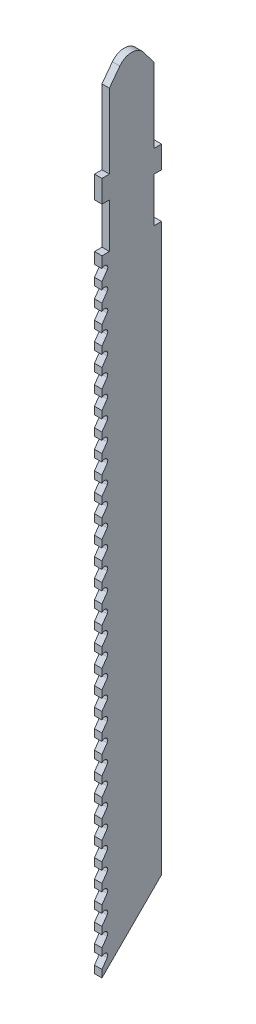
ISO-10303-21;
HEADER;
FILE_DESCRIPTION(('STEP AP214'),'2;1');
FILE_NAME('part.step','',(''),(''),'','','');
FILE_SCHEMA(('AUTOMOTIVE_DESIGN { 1 0 10303 214 1 1 1 1 }'));
ENDSEC;
DATA;
#1=APPLICATION_CONTEXT('core data for automotive mechanical design processes');
#2=APPLICATION_PROTOCOL_DEFINITION('international standard','automotive_design',2000,#1);
#3=PRODUCT_CONTEXT('',#1,'mechanical');
#4=PRODUCT('Part','Part','',(#3));
#5=PRODUCT_RELATED_PRODUCT_CATEGORY('part','',(#4));
#6=PRODUCT_DEFINITION_FORMATION('','',#4);
#7=PRODUCT_DEFINITION_CONTEXT('part definition',#1,'design');
#8=PRODUCT_DEFINITION('design','',#6,#7);
#9=PRODUCT_DEFINITION_SHAPE('','',#8);
#10=(LENGTH_UNIT() NAMED_UNIT(*) SI_UNIT(.MILLI.,.METRE.));
#11=(NAMED_UNIT(*) PLANE_ANGLE_UNIT() SI_UNIT($,.RADIAN.));
#12=(NAMED_UNIT(*) SI_UNIT($,.STERADIAN.) SOLID_ANGLE_UNIT());
#13=UNCERTAINTY_MEASURE_WITH_UNIT(LENGTH_MEASURE(1.E-05),#10,'distance_accuracy_value','');
#14=(GEOMETRIC_REPRESENTATION_CONTEXT(3) GLOBAL_UNCERTAINTY_ASSIGNED_CONTEXT((#13)) GLOBAL_UNIT_ASSIGNED_CONTEXT((#10,
#11,#12)) REPRESENTATION_CONTEXT('',''));
#15=CARTESIAN_POINT('',(0.,0.,0.));
#16=DIRECTION('',(0.,0.,1.));
#17=DIRECTION('',(1.,0.,0.));
#18=AXIS2_PLACEMENT_3D('',#15,#16,#17);
#19=CARTESIAN_POINT('',(0.5,0.,4.));
#20=DIRECTION('',(0.,0.,-1.));
#21=DIRECTION('',(-1.,0.,0.));
#22=AXIS2_PLACEMENT_3D('',#19,#20,#21);
#23=PLANE('',#22);
#24=DIRECTION('',(0.,-1.,0.));
#25=VECTOR('',#24,1.);
#26=CARTESIAN_POINT('',(0.5,0.,4.));
#27=LINE('',#26,#25);
#28=CARTESIAN_POINT('',(0.5,-2.99999999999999,4.));
#29=VERTEX_POINT('',#28);
#30=CARTESIAN_POINT('',(0.5,-3.99999999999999,4.));
#31=VERTEX_POINT('',#30);
#32=EDGE_CURVE('E1446',#29,#31,#27,.T.);
#33=ORIENTED_EDGE('',*,*,#32,.F.);
#34=DIRECTION('',(1.,0.,0.));
#35=VECTOR('',#34,1.);
#36=CARTESIAN_POINT('',(-0.5,-2.99999999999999,4.));
#37=LINE('',#36,#35);
#38=CARTESIAN_POINT('',(-0.5,-2.99999999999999,4.));
#39=VERTEX_POINT('',#38);
#40=EDGE_CURVE('E765',#39,#29,#37,.T.);
#41=ORIENTED_EDGE('',*,*,#40,.F.);
#42=DIRECTION('',(0.,-1.,0.));
#43=VECTOR('',#42,1.);
#44=CARTESIAN_POINT('',(-0.5,0.,4.));
#45=LINE('',#44,#43);
#46=CARTESIAN_POINT('',(-0.5,-4.,4.));
#47=VERTEX_POINT('',#46);
#48=EDGE_CURVE('E56',#39,#47,#45,.T.);
#49=ORIENTED_EDGE('',*,*,#48,.T.);
#50=DIRECTION('',(1.,0.,0.));
#51=VECTOR('',#50,1.);
#52=CARTESIAN_POINT('',(-0.5,-3.99999999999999,4.));
#53=LINE('',#52,#51);
#54=EDGE_CURVE('E796',#47,#31,#53,.T.);
#55=ORIENTED_EDGE('',*,*,#54,.T.);
#56=EDGE_LOOP('',(#33,#41,#49,#55));
#57=FACE_BOUND('',#56,.T.);
#58=ADVANCED_FACE('F33',(#57),#23,.F.);
#59=CARTESIAN_POINT('',(0.5,-5.49999999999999,4.));
#60=VERTEX_POINT('',#59);
#61=CARTESIAN_POINT('',(0.5,-6.49999999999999,4.));
#62=VERTEX_POINT('',#61);
#63=EDGE_CURVE('E1758',#60,#62,#27,.T.);
#64=ORIENTED_EDGE('',*,*,#63,.F.);
#65=DIRECTION('',(1.,0.,0.));
#66=VECTOR('',#65,1.);
#67=CARTESIAN_POINT('',(-0.5,-5.49999999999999,4.));
#68=LINE('',#67,#66);
#69=CARTESIAN_POINT('',(-0.5,-5.49999999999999,4.));
#70=VERTEX_POINT('',#69);
#71=EDGE_CURVE('E793',#70,#60,#68,.T.);
#72=ORIENTED_EDGE('',*,*,#71,.F.);
#73=CARTESIAN_POINT('',(-0.5,-6.50000000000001,4.));
#74=VERTEX_POINT('',#73);
#75=EDGE_CURVE('E1736',#70,#74,#45,.T.);
#76=ORIENTED_EDGE('',*,*,#75,.T.);
#77=DIRECTION('',(1.,0.,0.));
#78=VECTOR('',#77,1.);
#79=CARTESIAN_POINT('',(-0.5,-6.49999999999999,4.));
#80=LINE('',#79,#78);
#81=EDGE_CURVE('E814',#74,#62,#80,.T.);
#82=ORIENTED_EDGE('',*,*,#81,.T.);
#83=EDGE_LOOP('',(#64,#72,#76,#82));
#84=FACE_BOUND('',#83,.T.);
#85=ADVANCED_FACE('F1746',(#84),#23,.F.);
#86=CARTESIAN_POINT('',(0.5,-7.99999999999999,4.));
#87=VERTEX_POINT('',#86);
#88=CARTESIAN_POINT('',(0.5,-8.99999999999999,4.));
#89=VERTEX_POINT('',#88);
#90=EDGE_CURVE('E1756',#87,#89,#27,.T.);
#91=ORIENTED_EDGE('',*,*,#90,.F.);
#92=DIRECTION('',(1.,0.,0.));
#93=VECTOR('',#92,1.);
#94=CARTESIAN_POINT('',(-0.5,-7.99999999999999,4.));
#95=LINE('',#94,#93);
#96=CARTESIAN_POINT('',(-0.5,-7.99999999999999,4.));
#97=VERTEX_POINT('',#96);
#98=EDGE_CURVE('E811',#97,#87,#95,.T.);
#99=ORIENTED_EDGE('',*,*,#98,.F.);
#100=CARTESIAN_POINT('',(-0.5,-9.00000000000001,4.));
#101=VERTEX_POINT('',#100);
#102=EDGE_CURVE('E1731',#97,#101,#45,.T.);
#103=ORIENTED_EDGE('',*,*,#102,.T.);
#104=DIRECTION('',(1.,0.,0.));
#105=VECTOR('',#104,1.);
#106=CARTESIAN_POINT('',(-0.5,-8.99999999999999,4.));
#107=LINE('',#106,#105);
#108=EDGE_CURVE('E833',#101,#89,#107,.T.);
#109=ORIENTED_EDGE('',*,*,#108,.T.);
#110=EDGE_LOOP('',(#91,#99,#103,#109));
#111=FACE_BOUND('',#110,.T.);
#112=ADVANCED_FACE('F1755',(#111),#23,.F.);
#113=CARTESIAN_POINT('',(0.5,-10.5,4.));
#114=VERTEX_POINT('',#113);
#115=CARTESIAN_POINT('',(0.5,-11.5,4.));
#116=VERTEX_POINT('',#115);
#117=EDGE_CURVE('E1759',#114,#116,#27,.T.);
#118=ORIENTED_EDGE('',*,*,#117,.F.);
#119=DIRECTION('',(1.,0.,0.));
#120=VECTOR('',#119,1.);
#121=CARTESIAN_POINT('',(-0.5,-10.5,4.));
#122=LINE('',#121,#120);
#123=CARTESIAN_POINT('',(-0.5,-10.5,4.));
#124=VERTEX_POINT('',#123);
#125=EDGE_CURVE('E830',#124,#114,#122,.T.);
#126=ORIENTED_EDGE('',*,*,#125,.F.);
#127=CARTESIAN_POINT('',(-0.5,-11.5,4.));
#128=VERTEX_POINT('',#127);
#129=EDGE_CURVE('E1726',#124,#128,#45,.T.);
#130=ORIENTED_EDGE('',*,*,#129,.T.);
#131=DIRECTION('',(1.,0.,0.));
#132=VECTOR('',#131,1.);
#133=CARTESIAN_POINT('',(-0.5,-11.5,4.));
#134=LINE('',#133,#132);
#135=EDGE_CURVE('E852',#128,#116,#134,.T.);
#136=ORIENTED_EDGE('',*,*,#135,.T.);
#137=EDGE_LOOP('',(#118,#126,#130,#136));
#138=FACE_BOUND('',#137,.T.);
#139=ADVANCED_FACE('F2712',(#138),#23,.F.);
#140=CARTESIAN_POINT('',(0.5,-13.,4.));
#141=VERTEX_POINT('',#140);
#142=CARTESIAN_POINT('',(0.5,-14.,4.));
#143=VERTEX_POINT('',#142);
#144=EDGE_CURVE('E1760',#141,#143,#27,.T.);
#145=ORIENTED_EDGE('',*,*,#144,.F.);
#146=DIRECTION('',(1.,0.,0.));
#147=VECTOR('',#146,1.);
#148=CARTESIAN_POINT('',(-0.5,-13.,4.));
#149=LINE('',#148,#147);
#150=CARTESIAN_POINT('',(-0.5,-13.,4.));
#151=VERTEX_POINT('',#150);
#152=EDGE_CURVE('E849',#151,#141,#149,.T.);
#153=ORIENTED_EDGE('',*,*,#152,.F.);
#154=CARTESIAN_POINT('',(-0.5,-14.,4.));
#155=VERTEX_POINT('',#154);
#156=EDGE_CURVE('E1721',#151,#155,#45,.T.);
#157=ORIENTED_EDGE('',*,*,#156,.T.);
#158=DIRECTION('',(1.,0.,0.));
#159=VECTOR('',#158,1.);
#160=CARTESIAN_POINT('',(-0.5,-14.,4.));
#161=LINE('',#160,#159);
#162=EDGE_CURVE('E871',#155,#143,#161,.T.);
#163=ORIENTED_EDGE('',*,*,#162,.T.);
#164=EDGE_LOOP('',(#145,#153,#157,#163));
#165=FACE_BOUND('',#164,.T.);
#166=ADVANCED_FACE('F2714',(#165),#23,.F.);
#167=CARTESIAN_POINT('',(0.5,-15.5,4.));
#168=VERTEX_POINT('',#167);
#169=CARTESIAN_POINT('',(0.5,-16.5,4.));
#170=VERTEX_POINT('',#169);
#171=EDGE_CURVE('E1764',#168,#170,#27,.T.);
#172=ORIENTED_EDGE('',*,*,#171,.F.);
#173=DIRECTION('',(1.,0.,0.));
#174=VECTOR('',#173,1.);
#175=CARTESIAN_POINT('',(-0.5,-15.5,4.));
#176=LINE('',#175,#174);
#177=CARTESIAN_POINT('',(-0.5,-15.5,4.));
#178=VERTEX_POINT('',#177);
#179=EDGE_CURVE('E868',#178,#168,#176,.T.);
#180=ORIENTED_EDGE('',*,*,#179,.F.);
#181=CARTESIAN_POINT('',(-0.5,-16.5,4.));
#182=VERTEX_POINT('',#181);
#183=EDGE_CURVE('E1716',#178,#182,#45,.T.);
#184=ORIENTED_EDGE('',*,*,#183,.T.);
#185=DIRECTION('',(1.,0.,0.));
#186=VECTOR('',#185,1.);
#187=CARTESIAN_POINT('',(-0.5,-16.5,4.));
#188=LINE('',#187,#186);
#189=EDGE_CURVE('E890',#182,#170,#188,.T.);
#190=ORIENTED_EDGE('',*,*,#189,.T.);
#191=EDGE_LOOP('',(#172,#180,#184,#190));
#192=FACE_BOUND('',#191,.T.);
#193=ADVANCED_FACE('F2716',(#192),#23,.F.);
#194=CARTESIAN_POINT('',(0.5,-18.,4.));
#195=VERTEX_POINT('',#194);
#196=CARTESIAN_POINT('',(0.5,-19.,4.));
#197=VERTEX_POINT('',#196);
#198=EDGE_CURVE('E1768',#195,#197,#27,.T.);
#199=ORIENTED_EDGE('',*,*,#198,.F.);
#200=DIRECTION('',(1.,0.,0.));
#201=VECTOR('',#200,1.);
#202=CARTESIAN_POINT('',(-0.5,-18.,4.));
#203=LINE('',#202,#201);
#204=CARTESIAN_POINT('',(-0.5,-18.,4.));
#205=VERTEX_POINT('',#204);
#206=EDGE_CURVE('E887',#205,#195,#203,.T.);
#207=ORIENTED_EDGE('',*,*,#206,.F.);
#208=CARTESIAN_POINT('',(-0.5,-19.,4.));
#209=VERTEX_POINT('',#208);
#210=EDGE_CURVE('E1711',#205,#209,#45,.T.);
#211=ORIENTED_EDGE('',*,*,#210,.T.);
#212=DIRECTION('',(1.,0.,0.));
#213=VECTOR('',#212,1.);
#214=CARTESIAN_POINT('',(-0.5,-19.,4.));
#215=LINE('',#214,#213);
#216=EDGE_CURVE('E909',#209,#197,#215,.T.);
#217=ORIENTED_EDGE('',*,*,#216,.T.);
#218=EDGE_LOOP('',(#199,#207,#211,#217));
#219=FACE_BOUND('',#218,.T.);
#220=ADVANCED_FACE('F2718',(#219),#23,.F.);
#221=CARTESIAN_POINT('',(0.5,-20.5,4.));
#222=VERTEX_POINT('',#221);
#223=CARTESIAN_POINT('',(0.5,-21.5,4.));
#224=VERTEX_POINT('',#223);
#225=EDGE_CURVE('E1772',#222,#224,#27,.T.);
#226=ORIENTED_EDGE('',*,*,#225,.F.);
#227=DIRECTION('',(1.,0.,0.));
#228=VECTOR('',#227,1.);
#229=CARTESIAN_POINT('',(-0.5,-20.5,4.));
#230=LINE('',#229,#228);
#231=CARTESIAN_POINT('',(-0.5,-20.5,4.));
#232=VERTEX_POINT('',#231);
#233=EDGE_CURVE('E906',#232,#222,#230,.T.);
#234=ORIENTED_EDGE('',*,*,#233,.F.);
#235=CARTESIAN_POINT('',(-0.5,-21.5,4.));
#236=VERTEX_POINT('',#235);
#237=EDGE_CURVE('E1706',#232,#236,#45,.T.);
#238=ORIENTED_EDGE('',*,*,#237,.T.);
#239=DIRECTION('',(1.,0.,0.));
#240=VECTOR('',#239,1.);
#241=CARTESIAN_POINT('',(-0.5,-21.5,4.));
#242=LINE('',#241,#240);
#243=EDGE_CURVE('E928',#236,#224,#242,.T.);
#244=ORIENTED_EDGE('',*,*,#243,.T.);
#245=EDGE_LOOP('',(#226,#234,#238,#244));
#246=FACE_BOUND('',#245,.T.);
#247=ADVANCED_FACE('F2720',(#246),#23,.F.);
#248=CARTESIAN_POINT('',(0.5,-23.,4.));
#249=VERTEX_POINT('',#248);
#250=CARTESIAN_POINT('',(0.5,-24.,4.));
#251=VERTEX_POINT('',#250);
#252=EDGE_CURVE('E1776',#249,#251,#27,.T.);
#253=ORIENTED_EDGE('',*,*,#252,.F.);
#254=DIRECTION('',(1.,0.,0.));
#255=VECTOR('',#254,1.);
#256=CARTESIAN_POINT('',(-0.5,-23.,4.));
#257=LINE('',#256,#255);
#258=CARTESIAN_POINT('',(-0.5,-23.,4.));
#259=VERTEX_POINT('',#258);
#260=EDGE_CURVE('E925',#259,#249,#257,.T.);
#261=ORIENTED_EDGE('',*,*,#260,.F.);
#262=CARTESIAN_POINT('',(-0.5,-24.,4.));
#263=VERTEX_POINT('',#262);
#264=EDGE_CURVE('E1701',#259,#263,#45,.T.);
#265=ORIENTED_EDGE('',*,*,#264,.T.);
#266=DIRECTION('',(1.,0.,0.));
#267=VECTOR('',#266,1.);
#268=CARTESIAN_POINT('',(-0.5,-24.,4.));
#269=LINE('',#268,#267);
#270=EDGE_CURVE('E947',#263,#251,#269,.T.);
#271=ORIENTED_EDGE('',*,*,#270,.T.);
#272=EDGE_LOOP('',(#253,#261,#265,#271));
#273=FACE_BOUND('',#272,.T.);
#274=ADVANCED_FACE('F2722',(#273),#23,.F.);
#275=CARTESIAN_POINT('',(0.5,-25.5,4.));
#276=VERTEX_POINT('',#275);
#277=CARTESIAN_POINT('',(0.5,-26.5,4.));
#278=VERTEX_POINT('',#277);
#279=EDGE_CURVE('E1780',#276,#278,#27,.T.);
#280=ORIENTED_EDGE('',*,*,#279,.F.);
#281=DIRECTION('',(1.,0.,0.));
#282=VECTOR('',#281,1.);
#283=CARTESIAN_POINT('',(-0.5,-25.5,4.));
#284=LINE('',#283,#282);
#285=CARTESIAN_POINT('',(-0.5,-25.5,4.));
#286=VERTEX_POINT('',#285);
#287=EDGE_CURVE('E944',#286,#276,#284,.T.);
#288=ORIENTED_EDGE('',*,*,#287,.F.);
#289=CARTESIAN_POINT('',(-0.5,-26.5,4.));
#290=VERTEX_POINT('',#289);
#291=EDGE_CURVE('E1696',#286,#290,#45,.T.);
#292=ORIENTED_EDGE('',*,*,#291,.T.);
#293=DIRECTION('',(1.,0.,0.));
#294=VECTOR('',#293,1.);
#295=CARTESIAN_POINT('',(-0.5,-26.5,4.));
#296=LINE('',#295,#294);
#297=EDGE_CURVE('E966',#290,#278,#296,.T.);
#298=ORIENTED_EDGE('',*,*,#297,.T.);
#299=EDGE_LOOP('',(#280,#288,#292,#298));
#300=FACE_BOUND('',#299,.T.);
#301=ADVANCED_FACE('F2724',(#300),#23,.F.);
#302=CARTESIAN_POINT('',(0.5,-28.,4.));
#303=VERTEX_POINT('',#302);
#304=CARTESIAN_POINT('',(0.5,-29.,4.));
#305=VERTEX_POINT('',#304);
#306=EDGE_CURVE('E1784',#303,#305,#27,.T.);
#307=ORIENTED_EDGE('',*,*,#306,.F.);
#308=DIRECTION('',(1.,0.,0.));
#309=VECTOR('',#308,1.);
#310=CARTESIAN_POINT('',(-0.5,-28.,4.));
#311=LINE('',#310,#309);
#312=CARTESIAN_POINT('',(-0.5,-28.,4.));
#313=VERTEX_POINT('',#312);
#314=EDGE_CURVE('E963',#313,#303,#311,.T.);
#315=ORIENTED_EDGE('',*,*,#314,.F.);
#316=CARTESIAN_POINT('',(-0.5,-29.,4.));
#317=VERTEX_POINT('',#316);
#318=EDGE_CURVE('E1691',#313,#317,#45,.T.);
#319=ORIENTED_EDGE('',*,*,#318,.T.);
#320=DIRECTION('',(1.,0.,0.));
#321=VECTOR('',#320,1.);
#322=CARTESIAN_POINT('',(-0.5,-29.,4.));
#323=LINE('',#322,#321);
#324=EDGE_CURVE('E985',#317,#305,#323,.T.);
#325=ORIENTED_EDGE('',*,*,#324,.T.);
#326=EDGE_LOOP('',(#307,#315,#319,#325));
#327=FACE_BOUND('',#326,.T.);
#328=ADVANCED_FACE('F2726',(#327),#23,.F.);
#329=CARTESIAN_POINT('',(0.5,-30.5,4.));
#330=VERTEX_POINT('',#329);
#331=CARTESIAN_POINT('',(0.5,-31.5,4.));
#332=VERTEX_POINT('',#331);
#333=EDGE_CURVE('E1788',#330,#332,#27,.T.);
#334=ORIENTED_EDGE('',*,*,#333,.F.);
#335=DIRECTION('',(1.,0.,0.));
#336=VECTOR('',#335,1.);
#337=CARTESIAN_POINT('',(-0.5,-30.5,4.));
#338=LINE('',#337,#336);
#339=CARTESIAN_POINT('',(-0.5,-30.5,4.));
#340=VERTEX_POINT('',#339);
#341=EDGE_CURVE('E982',#340,#330,#338,.T.);
#342=ORIENTED_EDGE('',*,*,#341,.F.);
#343=CARTESIAN_POINT('',(-0.5,-31.5,4.));
#344=VERTEX_POINT('',#343);
#345=EDGE_CURVE('E1686',#340,#344,#45,.T.);
#346=ORIENTED_EDGE('',*,*,#345,.T.);
#347=DIRECTION('',(1.,0.,0.));
#348=VECTOR('',#347,1.);
#349=CARTESIAN_POINT('',(-0.5,-31.5,4.));
#350=LINE('',#349,#348);
#351=EDGE_CURVE('E1004',#344,#332,#350,.T.);
#352=ORIENTED_EDGE('',*,*,#351,.T.);
#353=EDGE_LOOP('',(#334,#342,#346,#352));
#354=FACE_BOUND('',#353,.T.);
#355=ADVANCED_FACE('F2728',(#354),#23,.F.);
#356=CARTESIAN_POINT('',(0.5,-33.,4.));
#357=VERTEX_POINT('',#356);
#358=CARTESIAN_POINT('',(0.5,-34.,4.));
#359=VERTEX_POINT('',#358);
#360=EDGE_CURVE('E1792',#357,#359,#27,.T.);
#361=ORIENTED_EDGE('',*,*,#360,.F.);
#362=DIRECTION('',(1.,0.,0.));
#363=VECTOR('',#362,1.);
#364=CARTESIAN_POINT('',(-0.5,-33.,4.));
#365=LINE('',#364,#363);
#366=CARTESIAN_POINT('',(-0.5,-33.,4.));
#367=VERTEX_POINT('',#366);
#368=EDGE_CURVE('E1001',#367,#357,#365,.T.);
#369=ORIENTED_EDGE('',*,*,#368,.F.);
#370=CARTESIAN_POINT('',(-0.5,-34.,4.));
#371=VERTEX_POINT('',#370);
#372=EDGE_CURVE('E1681',#367,#371,#45,.T.);
#373=ORIENTED_EDGE('',*,*,#372,.T.);
#374=DIRECTION('',(1.,0.,0.));
#375=VECTOR('',#374,1.);
#376=CARTESIAN_POINT('',(-0.5,-34.,4.));
#377=LINE('',#376,#375);
#378=EDGE_CURVE('E1023',#371,#359,#377,.T.);
#379=ORIENTED_EDGE('',*,*,#378,.T.);
#380=EDGE_LOOP('',(#361,#369,#373,#379));
#381=FACE_BOUND('',#380,.T.);
#382=ADVANCED_FACE('F2730',(#381),#23,.F.);
#383=CARTESIAN_POINT('',(0.5,-35.5,4.));
#384=VERTEX_POINT('',#383);
#385=CARTESIAN_POINT('',(0.5,-36.5,4.));
#386=VERTEX_POINT('',#385);
#387=EDGE_CURVE('E1796',#384,#386,#27,.T.);
#388=ORIENTED_EDGE('',*,*,#387,.F.);
#389=DIRECTION('',(1.,0.,0.));
#390=VECTOR('',#389,1.);
#391=CARTESIAN_POINT('',(-0.5,-35.5,4.));
#392=LINE('',#391,#390);
#393=CARTESIAN_POINT('',(-0.5,-35.5,4.));
#394=VERTEX_POINT('',#393);
#395=EDGE_CURVE('E1020',#394,#384,#392,.T.);
#396=ORIENTED_EDGE('',*,*,#395,.F.);
#397=CARTESIAN_POINT('',(-0.5,-36.5,4.));
#398=VERTEX_POINT('',#397);
#399=EDGE_CURVE('E1676',#394,#398,#45,.T.);
#400=ORIENTED_EDGE('',*,*,#399,.T.);
#401=DIRECTION('',(1.,0.,0.));
#402=VECTOR('',#401,1.);
#403=CARTESIAN_POINT('',(-0.5,-36.5,4.));
#404=LINE('',#403,#402);
#405=EDGE_CURVE('E1042',#398,#386,#404,.T.);
#406=ORIENTED_EDGE('',*,*,#405,.T.);
#407=EDGE_LOOP('',(#388,#396,#400,#406));
#408=FACE_BOUND('',#407,.T.);
#409=ADVANCED_FACE('F2732',(#408),#23,.F.);
#410=CARTESIAN_POINT('',(0.5,-38.,4.));
#411=VERTEX_POINT('',#410);
#412=CARTESIAN_POINT('',(0.5,-39.,4.));
#413=VERTEX_POINT('',#412);
#414=EDGE_CURVE('E1800',#411,#413,#27,.T.);
#415=ORIENTED_EDGE('',*,*,#414,.F.);
#416=DIRECTION('',(1.,0.,0.));
#417=VECTOR('',#416,1.);
#418=CARTESIAN_POINT('',(-0.5,-38.,4.));
#419=LINE('',#418,#417);
#420=CARTESIAN_POINT('',(-0.5,-38.,4.));
#421=VERTEX_POINT('',#420);
#422=EDGE_CURVE('E1039',#421,#411,#419,.T.);
#423=ORIENTED_EDGE('',*,*,#422,.F.);
#424=CARTESIAN_POINT('',(-0.5,-39.,4.));
#425=VERTEX_POINT('',#424);
#426=EDGE_CURVE('E1671',#421,#425,#45,.T.);
#427=ORIENTED_EDGE('',*,*,#426,.T.);
#428=DIRECTION('',(1.,0.,0.));
#429=VECTOR('',#428,1.);
#430=CARTESIAN_POINT('',(-0.5,-39.,4.));
#431=LINE('',#430,#429);
#432=EDGE_CURVE('E1061',#425,#413,#431,.T.);
#433=ORIENTED_EDGE('',*,*,#432,.T.);
#434=EDGE_LOOP('',(#415,#423,#427,#433));
#435=FACE_BOUND('',#434,.T.);
#436=ADVANCED_FACE('F2734',(#435),#23,.F.);
#437=CARTESIAN_POINT('',(0.5,-40.5,4.));
#438=VERTEX_POINT('',#437);
#439=CARTESIAN_POINT('',(0.5,-41.5,4.));
#440=VERTEX_POINT('',#439);
#441=EDGE_CURVE('E1804',#438,#440,#27,.T.);
#442=ORIENTED_EDGE('',*,*,#441,.F.);
#443=DIRECTION('',(1.,0.,0.));
#444=VECTOR('',#443,1.);
#445=CARTESIAN_POINT('',(-0.5,-40.5,4.));
#446=LINE('',#445,#444);
#447=CARTESIAN_POINT('',(-0.5,-40.5,4.));
#448=VERTEX_POINT('',#447);
#449=EDGE_CURVE('E1058',#448,#438,#446,.T.);
#450=ORIENTED_EDGE('',*,*,#449,.F.);
#451=CARTESIAN_POINT('',(-0.5,-41.5,4.));
#452=VERTEX_POINT('',#451);
#453=EDGE_CURVE('E1666',#448,#452,#45,.T.);
#454=ORIENTED_EDGE('',*,*,#453,.T.);
#455=DIRECTION('',(1.,0.,0.));
#456=VECTOR('',#455,1.);
#457=CARTESIAN_POINT('',(-0.5,-41.5,4.));
#458=LINE('',#457,#456);
#459=EDGE_CURVE('E1080',#452,#440,#458,.T.);
#460=ORIENTED_EDGE('',*,*,#459,.T.);
#461=EDGE_LOOP('',(#442,#450,#454,#460));
#462=FACE_BOUND('',#461,.T.);
#463=ADVANCED_FACE('F2736',(#462),#23,.F.);
#464=CARTESIAN_POINT('',(0.5,-43.,4.));
#465=VERTEX_POINT('',#464);
#466=CARTESIAN_POINT('',(0.5,-44.,4.));
#467=VERTEX_POINT('',#466);
#468=EDGE_CURVE('E1808',#465,#467,#27,.T.);
#469=ORIENTED_EDGE('',*,*,#468,.F.);
#470=DIRECTION('',(1.,0.,0.));
#471=VECTOR('',#470,1.);
#472=CARTESIAN_POINT('',(-0.5,-43.,4.));
#473=LINE('',#472,#471);
#474=CARTESIAN_POINT('',(-0.5,-43.,4.));
#475=VERTEX_POINT('',#474);
#476=EDGE_CURVE('E1077',#475,#465,#473,.T.);
#477=ORIENTED_EDGE('',*,*,#476,.F.);
#478=CARTESIAN_POINT('',(-0.5,-44.,4.));
#479=VERTEX_POINT('',#478);
#480=EDGE_CURVE('E1661',#475,#479,#45,.T.);
#481=ORIENTED_EDGE('',*,*,#480,.T.);
#482=DIRECTION('',(1.,0.,0.));
#483=VECTOR('',#482,1.);
#484=CARTESIAN_POINT('',(-0.5,-44.,4.));
#485=LINE('',#484,#483);
#486=EDGE_CURVE('E1099',#479,#467,#485,.T.);
#487=ORIENTED_EDGE('',*,*,#486,.T.);
#488=EDGE_LOOP('',(#469,#477,#481,#487));
#489=FACE_BOUND('',#488,.T.);
#490=ADVANCED_FACE('F2738',(#489),#23,.F.);
#491=CARTESIAN_POINT('',(0.5,-45.5,4.));
#492=VERTEX_POINT('',#491);
#493=CARTESIAN_POINT('',(0.5,-46.5,4.));
#494=VERTEX_POINT('',#493);
#495=EDGE_CURVE('E1812',#492,#494,#27,.T.);
#496=ORIENTED_EDGE('',*,*,#495,.F.);
#497=DIRECTION('',(1.,0.,0.));
#498=VECTOR('',#497,1.);
#499=CARTESIAN_POINT('',(-0.5,-45.5,4.));
#500=LINE('',#499,#498);
#501=CARTESIAN_POINT('',(-0.5,-45.5,4.));
#502=VERTEX_POINT('',#501);
#503=EDGE_CURVE('E1096',#502,#492,#500,.T.);
#504=ORIENTED_EDGE('',*,*,#503,.F.);
#505=CARTESIAN_POINT('',(-0.5,-46.5,4.));
#506=VERTEX_POINT('',#505);
#507=EDGE_CURVE('E1656',#502,#506,#45,.T.);
#508=ORIENTED_EDGE('',*,*,#507,.T.);
#509=DIRECTION('',(1.,0.,0.));
#510=VECTOR('',#509,1.);
#511=CARTESIAN_POINT('',(-0.5,-46.5,4.));
#512=LINE('',#511,#510);
#513=EDGE_CURVE('E1118',#506,#494,#512,.T.);
#514=ORIENTED_EDGE('',*,*,#513,.T.);
#515=EDGE_LOOP('',(#496,#504,#508,#514));
#516=FACE_BOUND('',#515,.T.);
#517=ADVANCED_FACE('F2740',(#516),#23,.F.);
#518=CARTESIAN_POINT('',(0.5,-48.,4.));
#519=VERTEX_POINT('',#518);
#520=CARTESIAN_POINT('',(0.5,-49.,4.));
#521=VERTEX_POINT('',#520);
#522=EDGE_CURVE('E1816',#519,#521,#27,.T.);
#523=ORIENTED_EDGE('',*,*,#522,.F.);
#524=DIRECTION('',(1.,0.,0.));
#525=VECTOR('',#524,1.);
#526=CARTESIAN_POINT('',(-0.5,-48.,4.));
#527=LINE('',#526,#525);
#528=CARTESIAN_POINT('',(-0.5,-48.,4.));
#529=VERTEX_POINT('',#528);
#530=EDGE_CURVE('E1115',#529,#519,#527,.T.);
#531=ORIENTED_EDGE('',*,*,#530,.F.);
#532=CARTESIAN_POINT('',(-0.5,-49.,4.));
#533=VERTEX_POINT('',#532);
#534=EDGE_CURVE('E1651',#529,#533,#45,.T.);
#535=ORIENTED_EDGE('',*,*,#534,.T.);
#536=DIRECTION('',(1.,0.,0.));
#537=VECTOR('',#536,1.);
#538=CARTESIAN_POINT('',(-0.5,-49.,4.));
#539=LINE('',#538,#537);
#540=EDGE_CURVE('E1137',#533,#521,#539,.T.);
#541=ORIENTED_EDGE('',*,*,#540,.T.);
#542=EDGE_LOOP('',(#523,#531,#535,#541));
#543=FACE_BOUND('',#542,.T.);
#544=ADVANCED_FACE('F2742',(#543),#23,.F.);
#545=CARTESIAN_POINT('',(0.5,-50.5,4.));
#546=VERTEX_POINT('',#545);
#547=CARTESIAN_POINT('',(0.5,-51.5,4.));
#548=VERTEX_POINT('',#547);
#549=EDGE_CURVE('E1820',#546,#548,#27,.T.);
#550=ORIENTED_EDGE('',*,*,#549,.F.);
#551=DIRECTION('',(1.,0.,0.));
#552=VECTOR('',#551,1.);
#553=CARTESIAN_POINT('',(-0.5,-50.5,4.));
#554=LINE('',#553,#552);
#555=CARTESIAN_POINT('',(-0.5,-50.5,4.));
#556=VERTEX_POINT('',#555);
#557=EDGE_CURVE('E1134',#556,#546,#554,.T.);
#558=ORIENTED_EDGE('',*,*,#557,.F.);
#559=CARTESIAN_POINT('',(-0.5,-51.5,4.));
#560=VERTEX_POINT('',#559);
#561=EDGE_CURVE('E1646',#556,#560,#45,.T.);
#562=ORIENTED_EDGE('',*,*,#561,.T.);
#563=DIRECTION('',(1.,0.,0.));
#564=VECTOR('',#563,1.);
#565=CARTESIAN_POINT('',(-0.5,-51.5,4.));
#566=LINE('',#565,#564);
#567=EDGE_CURVE('E1156',#560,#548,#566,.T.);
#568=ORIENTED_EDGE('',*,*,#567,.T.);
#569=EDGE_LOOP('',(#550,#558,#562,#568));
#570=FACE_BOUND('',#569,.T.);
#571=ADVANCED_FACE('F2744',(#570),#23,.F.);
#572=CARTESIAN_POINT('',(0.5,-53.,4.));
#573=VERTEX_POINT('',#572);
#574=CARTESIAN_POINT('',(0.5,-54.,4.));
#575=VERTEX_POINT('',#574);
#576=EDGE_CURVE('E1824',#573,#575,#27,.T.);
#577=ORIENTED_EDGE('',*,*,#576,.F.);
#578=DIRECTION('',(1.,0.,0.));
#579=VECTOR('',#578,1.);
#580=CARTESIAN_POINT('',(-0.5,-53.,4.));
#581=LINE('',#580,#579);
#582=CARTESIAN_POINT('',(-0.5,-53.,4.));
#583=VERTEX_POINT('',#582);
#584=EDGE_CURVE('E1153',#583,#573,#581,.T.);
#585=ORIENTED_EDGE('',*,*,#584,.F.);
#586=CARTESIAN_POINT('',(-0.5,-54.,4.));
#587=VERTEX_POINT('',#586);
#588=EDGE_CURVE('E1641',#583,#587,#45,.T.);
#589=ORIENTED_EDGE('',*,*,#588,.T.);
#590=DIRECTION('',(1.,0.,0.));
#591=VECTOR('',#590,1.);
#592=CARTESIAN_POINT('',(-0.5,-54.,4.));
#593=LINE('',#592,#591);
#594=EDGE_CURVE('E1175',#587,#575,#593,.T.);
#595=ORIENTED_EDGE('',*,*,#594,.T.);
#596=EDGE_LOOP('',(#577,#585,#589,#595));
#597=FACE_BOUND('',#596,.T.);
#598=ADVANCED_FACE('F2746',(#597),#23,.F.);
#599=CARTESIAN_POINT('',(0.5,-55.5,4.));
#600=VERTEX_POINT('',#599);
#601=CARTESIAN_POINT('',(0.5,-56.5,4.));
#602=VERTEX_POINT('',#601);
#603=EDGE_CURVE('E1828',#600,#602,#27,.T.);
#604=ORIENTED_EDGE('',*,*,#603,.F.);
#605=DIRECTION('',(1.,0.,0.));
#606=VECTOR('',#605,1.);
#607=CARTESIAN_POINT('',(-0.5,-55.5,4.));
#608=LINE('',#607,#606);
#609=CARTESIAN_POINT('',(-0.5,-55.5,4.));
#610=VERTEX_POINT('',#609);
#611=EDGE_CURVE('E1172',#610,#600,#608,.T.);
#612=ORIENTED_EDGE('',*,*,#611,.F.);
#613=CARTESIAN_POINT('',(-0.5,-56.5,4.));
#614=VERTEX_POINT('',#613);
#615=EDGE_CURVE('E1636',#610,#614,#45,.T.);
#616=ORIENTED_EDGE('',*,*,#615,.T.);
#617=DIRECTION('',(1.,0.,0.));
#618=VECTOR('',#617,1.);
#619=CARTESIAN_POINT('',(-0.5,-56.5,4.));
#620=LINE('',#619,#618);
#621=EDGE_CURVE('E1194',#614,#602,#620,.T.);
#622=ORIENTED_EDGE('',*,*,#621,.T.);
#623=EDGE_LOOP('',(#604,#612,#616,#622));
#624=FACE_BOUND('',#623,.T.);
#625=ADVANCED_FACE('F2748',(#624),#23,.F.);
#626=CARTESIAN_POINT('',(0.5,-58.,4.));
#627=VERTEX_POINT('',#626);
#628=CARTESIAN_POINT('',(0.5,-59.,4.));
#629=VERTEX_POINT('',#628);
#630=EDGE_CURVE('E1832',#627,#629,#27,.T.);
#631=ORIENTED_EDGE('',*,*,#630,.F.);
#632=DIRECTION('',(1.,0.,0.));
#633=VECTOR('',#632,1.);
#634=CARTESIAN_POINT('',(-0.5,-58.,4.));
#635=LINE('',#634,#633);
#636=CARTESIAN_POINT('',(-0.5,-58.,4.));
#637=VERTEX_POINT('',#636);
#638=EDGE_CURVE('E1191',#637,#627,#635,.T.);
#639=ORIENTED_EDGE('',*,*,#638,.F.);
#640=CARTESIAN_POINT('',(-0.5,-59.,4.));
#641=VERTEX_POINT('',#640);
#642=EDGE_CURVE('E1631',#637,#641,#45,.T.);
#643=ORIENTED_EDGE('',*,*,#642,.T.);
#644=DIRECTION('',(1.,0.,0.));
#645=VECTOR('',#644,1.);
#646=CARTESIAN_POINT('',(-0.5,-59.,4.));
#647=LINE('',#646,#645);
#648=EDGE_CURVE('E1213',#641,#629,#647,.T.);
#649=ORIENTED_EDGE('',*,*,#648,.T.);
#650=EDGE_LOOP('',(#631,#639,#643,#649));
#651=FACE_BOUND('',#650,.T.);
#652=ADVANCED_FACE('F2750',(#651),#23,.F.);
#653=CARTESIAN_POINT('',(0.5,-60.5,4.));
#654=VERTEX_POINT('',#653);
#655=CARTESIAN_POINT('',(0.5,-61.5,4.));
#656=VERTEX_POINT('',#655);
#657=EDGE_CURVE('E1836',#654,#656,#27,.T.);
#658=ORIENTED_EDGE('',*,*,#657,.F.);
#659=DIRECTION('',(1.,0.,0.));
#660=VECTOR('',#659,1.);
#661=CARTESIAN_POINT('',(-0.5,-60.5,4.));
#662=LINE('',#661,#660);
#663=CARTESIAN_POINT('',(-0.5,-60.5,4.));
#664=VERTEX_POINT('',#663);
#665=EDGE_CURVE('E1210',#664,#654,#662,.T.);
#666=ORIENTED_EDGE('',*,*,#665,.F.);
#667=CARTESIAN_POINT('',(-0.5,-61.5,4.));
#668=VERTEX_POINT('',#667);
#669=EDGE_CURVE('E1626',#664,#668,#45,.T.);
#670=ORIENTED_EDGE('',*,*,#669,.T.);
#671=DIRECTION('',(1.,0.,0.));
#672=VECTOR('',#671,1.);
#673=CARTESIAN_POINT('',(-0.5,-61.5,4.));
#674=LINE('',#673,#672);
#675=EDGE_CURVE('E1232',#668,#656,#674,.T.);
#676=ORIENTED_EDGE('',*,*,#675,.T.);
#677=EDGE_LOOP('',(#658,#666,#670,#676));
#678=FACE_BOUND('',#677,.T.);
#679=ADVANCED_FACE('F2752',(#678),#23,.F.);
#680=CARTESIAN_POINT('',(0.5,-63.,4.));
#681=VERTEX_POINT('',#680);
#682=CARTESIAN_POINT('',(0.5,-64.,4.));
#683=VERTEX_POINT('',#682);
#684=EDGE_CURVE('E1840',#681,#683,#27,.T.);
#685=ORIENTED_EDGE('',*,*,#684,.F.);
#686=DIRECTION('',(1.,0.,0.));
#687=VECTOR('',#686,1.);
#688=CARTESIAN_POINT('',(-0.5,-63.,4.));
#689=LINE('',#688,#687);
#690=CARTESIAN_POINT('',(-0.5,-63.,4.));
#691=VERTEX_POINT('',#690);
#692=EDGE_CURVE('E1229',#691,#681,#689,.T.);
#693=ORIENTED_EDGE('',*,*,#692,.F.);
#694=CARTESIAN_POINT('',(-0.5,-64.,4.));
#695=VERTEX_POINT('',#694);
#696=EDGE_CURVE('E1621',#691,#695,#45,.T.);
#697=ORIENTED_EDGE('',*,*,#696,.T.);
#698=DIRECTION('',(1.,0.,0.));
#699=VECTOR('',#698,1.);
#700=CARTESIAN_POINT('',(-0.5,-64.,4.));
#701=LINE('',#700,#699);
#702=EDGE_CURVE('E1251',#695,#683,#701,.T.);
#703=ORIENTED_EDGE('',*,*,#702,.T.);
#704=EDGE_LOOP('',(#685,#693,#697,#703));
#705=FACE_BOUND('',#704,.T.);
#706=ADVANCED_FACE('F2754',(#705),#23,.F.);
#707=CARTESIAN_POINT('',(0.5,-65.5,4.));
#708=VERTEX_POINT('',#707);
#709=CARTESIAN_POINT('',(0.5,-66.5,4.));
#710=VERTEX_POINT('',#709);
#711=EDGE_CURVE('E1844',#708,#710,#27,.T.);
#712=ORIENTED_EDGE('',*,*,#711,.F.);
#713=DIRECTION('',(1.,0.,0.));
#714=VECTOR('',#713,1.);
#715=CARTESIAN_POINT('',(-0.5,-65.5,4.));
#716=LINE('',#715,#714);
#717=CARTESIAN_POINT('',(-0.5,-65.5,4.));
#718=VERTEX_POINT('',#717);
#719=EDGE_CURVE('E1248',#718,#708,#716,.T.);
#720=ORIENTED_EDGE('',*,*,#719,.F.);
#721=CARTESIAN_POINT('',(-0.5,-66.5,4.));
#722=VERTEX_POINT('',#721);
#723=EDGE_CURVE('E1616',#718,#722,#45,.T.);
#724=ORIENTED_EDGE('',*,*,#723,.T.);
#725=DIRECTION('',(1.,0.,0.));
#726=VECTOR('',#725,1.);
#727=CARTESIAN_POINT('',(-0.5,-66.5,4.));
#728=LINE('',#727,#726);
#729=EDGE_CURVE('E1270',#722,#710,#728,.T.);
#730=ORIENTED_EDGE('',*,*,#729,.T.);
#731=EDGE_LOOP('',(#712,#720,#724,#730));
#732=FACE_BOUND('',#731,.T.);
#733=ADVANCED_FACE('F2756',(#732),#23,.F.);
#734=CARTESIAN_POINT('',(0.5,-68.,4.));
#735=VERTEX_POINT('',#734);
#736=CARTESIAN_POINT('',(0.5,-69.,4.));
#737=VERTEX_POINT('',#736);
#738=EDGE_CURVE('E1848',#735,#737,#27,.T.);
#739=ORIENTED_EDGE('',*,*,#738,.F.);
#740=DIRECTION('',(1.,0.,0.));
#741=VECTOR('',#740,1.);
#742=CARTESIAN_POINT('',(-0.5,-68.,4.));
#743=LINE('',#742,#741);
#744=CARTESIAN_POINT('',(-0.5,-68.,4.));
#745=VERTEX_POINT('',#744);
#746=EDGE_CURVE('E1267',#745,#735,#743,.T.);
#747=ORIENTED_EDGE('',*,*,#746,.F.);
#748=CARTESIAN_POINT('',(-0.5,-69.,4.));
#749=VERTEX_POINT('',#748);
#750=EDGE_CURVE('E1611',#745,#749,#45,.T.);
#751=ORIENTED_EDGE('',*,*,#750,.T.);
#752=DIRECTION('',(1.,0.,0.));
#753=VECTOR('',#752,1.);
#754=CARTESIAN_POINT('',(-0.5,-69.,4.));
#755=LINE('',#754,#753);
#756=EDGE_CURVE('E1289',#749,#737,#755,.T.);
#757=ORIENTED_EDGE('',*,*,#756,.T.);
#758=EDGE_LOOP('',(#739,#747,#751,#757));
#759=FACE_BOUND('',#758,.T.);
#760=ADVANCED_FACE('F2758',(#759),#23,.F.);
#761=CARTESIAN_POINT('',(0.5,-70.5,4.));
#762=VERTEX_POINT('',#761);
#763=CARTESIAN_POINT('',(0.5,-71.5,4.));
#764=VERTEX_POINT('',#763);
#765=EDGE_CURVE('E1852',#762,#764,#27,.T.);
#766=ORIENTED_EDGE('',*,*,#765,.F.);
#767=DIRECTION('',(1.,0.,0.));
#768=VECTOR('',#767,1.);
#769=CARTESIAN_POINT('',(-0.5,-70.5,4.));
#770=LINE('',#769,#768);
#771=CARTESIAN_POINT('',(-0.5,-70.5,4.));
#772=VERTEX_POINT('',#771);
#773=EDGE_CURVE('E1286',#772,#762,#770,.T.);
#774=ORIENTED_EDGE('',*,*,#773,.F.);
#775=CARTESIAN_POINT('',(-0.5,-71.5,4.));
#776=VERTEX_POINT('',#775);
#777=EDGE_CURVE('E1606',#772,#776,#45,.T.);
#778=ORIENTED_EDGE('',*,*,#777,.T.);
#779=DIRECTION('',(1.,0.,0.));
#780=VECTOR('',#779,1.);
#781=CARTESIAN_POINT('',(-0.5,-71.5,4.));
#782=LINE('',#781,#780);
#783=EDGE_CURVE('E1308',#776,#764,#782,.T.);
#784=ORIENTED_EDGE('',*,*,#783,.T.);
#785=EDGE_LOOP('',(#766,#774,#778,#784));
#786=FACE_BOUND('',#785,.T.);
#787=ADVANCED_FACE('F2760',(#786),#23,.F.);
#788=CARTESIAN_POINT('',(0.5,-73.,4.));
#789=VERTEX_POINT('',#788);
#790=CARTESIAN_POINT('',(0.5,-74.,4.));
#791=VERTEX_POINT('',#790);
#792=EDGE_CURVE('E1856',#789,#791,#27,.T.);
#793=ORIENTED_EDGE('',*,*,#792,.F.);
#794=DIRECTION('',(1.,0.,0.));
#795=VECTOR('',#794,1.);
#796=CARTESIAN_POINT('',(-0.5,-73.,4.));
#797=LINE('',#796,#795);
#798=CARTESIAN_POINT('',(-0.5,-73.,4.));
#799=VERTEX_POINT('',#798);
#800=EDGE_CURVE('E1305',#799,#789,#797,.T.);
#801=ORIENTED_EDGE('',*,*,#800,.F.);
#802=CARTESIAN_POINT('',(-0.5,-74.,4.));
#803=VERTEX_POINT('',#802);
#804=EDGE_CURVE('E1601',#799,#803,#45,.T.);
#805=ORIENTED_EDGE('',*,*,#804,.T.);
#806=DIRECTION('',(1.,0.,0.));
#807=VECTOR('',#806,1.);
#808=CARTESIAN_POINT('',(-0.5,-74.,4.));
#809=LINE('',#808,#807);
#810=EDGE_CURVE('E1327',#803,#791,#809,.T.);
#811=ORIENTED_EDGE('',*,*,#810,.T.);
#812=EDGE_LOOP('',(#793,#801,#805,#811));
#813=FACE_BOUND('',#812,.T.);
#814=ADVANCED_FACE('F2762',(#813),#23,.F.);
#815=CARTESIAN_POINT('',(0.5,-75.5,4.));
#816=VERTEX_POINT('',#815);
#817=CARTESIAN_POINT('',(0.5,-76.5,4.));
#818=VERTEX_POINT('',#817);
#819=EDGE_CURVE('E1860',#816,#818,#27,.T.);
#820=ORIENTED_EDGE('',*,*,#819,.F.);
#821=DIRECTION('',(1.,0.,0.));
#822=VECTOR('',#821,1.);
#823=CARTESIAN_POINT('',(-0.5,-75.5,4.));
#824=LINE('',#823,#822);
#825=CARTESIAN_POINT('',(-0.5,-75.5,4.));
#826=VERTEX_POINT('',#825);
#827=EDGE_CURVE('E1324',#826,#816,#824,.T.);
#828=ORIENTED_EDGE('',*,*,#827,.F.);
#829=CARTESIAN_POINT('',(-0.5,-76.5,4.));
#830=VERTEX_POINT('',#829);
#831=EDGE_CURVE('E1596',#826,#830,#45,.T.);
#832=ORIENTED_EDGE('',*,*,#831,.T.);
#833=DIRECTION('',(1.,0.,0.));
#834=VECTOR('',#833,1.);
#835=CARTESIAN_POINT('',(-0.5,-76.5,4.));
#836=LINE('',#835,#834);
#837=EDGE_CURVE('E1346',#830,#818,#836,.T.);
#838=ORIENTED_EDGE('',*,*,#837,.T.);
#839=EDGE_LOOP('',(#820,#828,#832,#838));
#840=FACE_BOUND('',#839,.T.);
#841=ADVANCED_FACE('F2764',(#840),#23,.F.);
#842=CARTESIAN_POINT('',(0.5,-78.,4.));
#843=VERTEX_POINT('',#842);
#844=CARTESIAN_POINT('',(0.5,-79.,4.));
#845=VERTEX_POINT('',#844);
#846=EDGE_CURVE('E1864',#843,#845,#27,.T.);
#847=ORIENTED_EDGE('',*,*,#846,.F.);
#848=DIRECTION('',(1.,0.,0.));
#849=VECTOR('',#848,1.);
#850=CARTESIAN_POINT('',(-0.5,-78.,4.));
#851=LINE('',#850,#849);
#852=CARTESIAN_POINT('',(-0.5,-78.,4.));
#853=VERTEX_POINT('',#852);
#854=EDGE_CURVE('E1343',#853,#843,#851,.T.);
#855=ORIENTED_EDGE('',*,*,#854,.F.);
#856=CARTESIAN_POINT('',(-0.5,-79.,4.));
#857=VERTEX_POINT('',#856);
#858=EDGE_CURVE('E1591',#853,#857,#45,.T.);
#859=ORIENTED_EDGE('',*,*,#858,.T.);
#860=DIRECTION('',(1.,0.,0.));
#861=VECTOR('',#860,1.);
#862=CARTESIAN_POINT('',(-0.5,-79.,4.));
#863=LINE('',#862,#861);
#864=EDGE_CURVE('E1365',#857,#845,#863,.T.);
#865=ORIENTED_EDGE('',*,*,#864,.T.);
#866=EDGE_LOOP('',(#847,#855,#859,#865));
#867=FACE_BOUND('',#866,.T.);
#868=ADVANCED_FACE('F1888',(#867),#23,.F.);
#869=CARTESIAN_POINT('',(0.5,-80.5,4.));
#870=VERTEX_POINT('',#869);
#871=CARTESIAN_POINT('',(0.5,-81.5,4.));
#872=VERTEX_POINT('',#871);
#873=EDGE_CURVE('E1868',#870,#872,#27,.T.);
#874=ORIENTED_EDGE('',*,*,#873,.F.);
#875=DIRECTION('',(1.,0.,0.));
#876=VECTOR('',#875,1.);
#877=CARTESIAN_POINT('',(-0.5,-80.5,4.));
#878=LINE('',#877,#876);
#879=CARTESIAN_POINT('',(-0.5,-80.5,4.));
#880=VERTEX_POINT('',#879);
#881=EDGE_CURVE('E1362',#880,#870,#878,.T.);
#882=ORIENTED_EDGE('',*,*,#881,.F.);
#883=CARTESIAN_POINT('',(-0.5,-81.5,4.));
#884=VERTEX_POINT('',#883);
#885=EDGE_CURVE('E1590',#880,#884,#45,.T.);
#886=ORIENTED_EDGE('',*,*,#885,.T.);
#887=DIRECTION('',(1.,0.,0.));
#888=VECTOR('',#887,1.);
#889=CARTESIAN_POINT('',(-0.5,-81.5,4.));
#890=LINE('',#889,#888);
#891=EDGE_CURVE('E1384',#884,#872,#890,.T.);
#892=ORIENTED_EDGE('',*,*,#891,.T.);
#893=EDGE_LOOP('',(#874,#882,#886,#892));
#894=FACE_BOUND('',#893,.T.);
#895=ADVANCED_FACE('F1881',(#894),#23,.F.);
#896=CARTESIAN_POINT('',(0.5,-83.,4.));
#897=VERTEX_POINT('',#896);
#898=CARTESIAN_POINT('',(0.5,-84.,4.));
#899=VERTEX_POINT('',#898);
#900=EDGE_CURVE('E1443',#897,#899,#27,.T.);
#901=ORIENTED_EDGE('',*,*,#900,.F.);
#902=DIRECTION('',(1.,0.,0.));
#903=VECTOR('',#902,1.);
#904=CARTESIAN_POINT('',(-0.5,-83.,4.));
#905=LINE('',#904,#903);
#906=CARTESIAN_POINT('',(-0.5,-83.,4.));
#907=VERTEX_POINT('',#906);
#908=EDGE_CURVE('E1381',#907,#897,#905,.T.);
#909=ORIENTED_EDGE('',*,*,#908,.F.);
#910=CARTESIAN_POINT('',(-0.5,-84.,4.));
#911=VERTEX_POINT('',#910);
#912=EDGE_CURVE('E1404',#907,#911,#45,.T.);
#913=ORIENTED_EDGE('',*,*,#912,.T.);
#914=DIRECTION('',(-1.,0.,0.));
#915=VECTOR('',#914,1.);
#916=CARTESIAN_POINT('',(0.5,-84.,4.));
#917=LINE('',#916,#915);
#918=EDGE_CURVE('E1492',#899,#911,#917,.T.);
#919=ORIENTED_EDGE('',*,*,#918,.F.);
#920=EDGE_LOOP('',(#901,#909,#913,#919));
#921=FACE_BOUND('',#920,.T.);
#922=ADVANCED_FACE('F1879',(#921),#23,.F.);
#923=CARTESIAN_POINT('',(0.5,19.6666666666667,0.));
#924=DIRECTION('',(-1.,0.,0.));
#925=DIRECTION('',(0.,0.,1.));
#926=AXIS2_PLACEMENT_3D('',#923,#924,#925);
#927=CYLINDRICAL_SURFACE('',#926,2.);
#928=CARTESIAN_POINT('',(-0.5,19.6666666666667,0.));
#929=DIRECTION('',(1.,0.,0.));
#930=DIRECTION('',(0.,0.,1.));
#931=AXIS2_PLACEMENT_3D('',#928,#929,#930);
#932=CIRCLE('',#931,2.);
#933=CARTESIAN_POINT('',(-0.5,20.8666666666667,-1.60000000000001));
#934=VERTEX_POINT('',#933);
#935=CARTESIAN_POINT('',(-0.5,20.8666666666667,1.60000000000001));
#936=VERTEX_POINT('',#935);
#937=EDGE_CURVE('E1383',#934,#936,#932,.T.);
#938=ORIENTED_EDGE('',*,*,#937,.T.);
#939=DIRECTION('',(-1.,0.,0.));
#940=VECTOR('',#939,1.);
#941=CARTESIAN_POINT('',(0.5,20.8666666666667,1.60000000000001));
#942=LINE('',#941,#940);
#943=CARTESIAN_POINT('',(0.5,20.8666666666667,1.60000000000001));
#944=VERTEX_POINT('',#943);
#945=EDGE_CURVE('E11',#944,#936,#942,.T.);
#946=ORIENTED_EDGE('',*,*,#945,.F.);
#947=CARTESIAN_POINT('',(0.5,19.6666666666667,0.));
#948=DIRECTION('',(1.,0.,0.));
#949=DIRECTION('',(0.,0.,1.));
#950=AXIS2_PLACEMENT_3D('',#947,#948,#949);
#951=CIRCLE('',#950,2.);
#952=CARTESIAN_POINT('',(0.5,20.8666666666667,-1.60000000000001));
#953=VERTEX_POINT('',#952);
#954=EDGE_CURVE('E1426',#953,#944,#951,.T.);
#955=ORIENTED_EDGE('',*,*,#954,.F.);
#956=DIRECTION('',(-1.,0.,0.));
#957=VECTOR('',#956,1.);
#958=CARTESIAN_POINT('',(0.5,20.8666666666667,-1.60000000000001));
#959=LINE('',#958,#957);
#960=EDGE_CURVE('E1465',#953,#934,#959,.T.);
#961=ORIENTED_EDGE('',*,*,#960,.T.);
#962=EDGE_LOOP('',(#938,#946,#955,#961));
#963=FACE_BOUND('',#962,.T.);
#964=ADVANCED_FACE('F35',(#963),#927,.T.);
#965=CARTESIAN_POINT('',(0.5,19.,3.));
#966=DIRECTION('',(0.,-0.599999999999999,-0.800000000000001));
#967=DIRECTION('',(0.,0.800000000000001,-0.599999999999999));
#968=AXIS2_PLACEMENT_3D('',#965,#966,#967);
#969=PLANE('',#968);
#970=DIRECTION('',(0.,-0.800000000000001,0.599999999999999));
#971=VECTOR('',#970,1.);
#972=CARTESIAN_POINT('',(-0.5,19.,3.));
#973=LINE('',#972,#971);
#974=CARTESIAN_POINT('',(-0.5,19.,3.));
#975=VERTEX_POINT('',#974);
#976=EDGE_CURVE('E1390',#936,#975,#973,.T.);
#977=ORIENTED_EDGE('',*,*,#976,.T.);
#978=DIRECTION('',(-1.,0.,0.));
#979=VECTOR('',#978,1.);
#980=CARTESIAN_POINT('',(0.5,19.,3.));
#981=LINE('',#980,#979);
#982=CARTESIAN_POINT('',(0.5,19.,3.));
#983=VERTEX_POINT('',#982);
#984=EDGE_CURVE('E41',#983,#975,#981,.T.);
#985=ORIENTED_EDGE('',*,*,#984,.F.);
#986=DIRECTION('',(0.,-0.800000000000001,0.599999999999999));
#987=VECTOR('',#986,1.);
#988=CARTESIAN_POINT('',(0.5,19.,3.));
#989=LINE('',#988,#987);
#990=EDGE_CURVE('E1429',#944,#983,#989,.T.);
#991=ORIENTED_EDGE('',*,*,#990,.F.);
#992=ORIENTED_EDGE('',*,*,#945,.T.);
#993=EDGE_LOOP('',(#977,#985,#991,#992));
#994=FACE_BOUND('',#993,.T.);
#995=ADVANCED_FACE('F1539',(#994),#969,.F.);
#996=CARTESIAN_POINT('',(0.5,9.,3.));
#997=DIRECTION('',(0.,0.,-1.));
#998=DIRECTION('',(0.,1.,0.));
#999=AXIS2_PLACEMENT_3D('',#996,#997,#998);
#1000=PLANE('',#999);
#1001=DIRECTION('',(0.,-1.,0.));
#1002=VECTOR('',#1001,1.);
#1003=CARTESIAN_POINT('',(-0.5,9.,3.));
#1004=LINE('',#1003,#1002);
#1005=CARTESIAN_POINT('',(-0.5,9.,3.));
#1006=VERTEX_POINT('',#1005);
#1007=EDGE_CURVE('E1392',#975,#1006,#1004,.T.);
#1008=ORIENTED_EDGE('',*,*,#1007,.T.);
#1009=DIRECTION('',(-1.,0.,0.));
#1010=VECTOR('',#1009,1.);
#1011=CARTESIAN_POINT('',(0.5,9.,3.));
#1012=LINE('',#1011,#1010);
#1013=CARTESIAN_POINT('',(0.5,9.,3.));
#1014=VERTEX_POINT('',#1013);
#1015=EDGE_CURVE('E1511',#1014,#1006,#1012,.T.);
#1016=ORIENTED_EDGE('',*,*,#1015,.F.);
#1017=DIRECTION('',(0.,-1.,0.));
#1018=VECTOR('',#1017,1.);
#1019=CARTESIAN_POINT('',(0.5,9.,3.));
#1020=LINE('',#1019,#1018);
#1021=EDGE_CURVE('E1431',#983,#1014,#1020,.T.);
#1022=ORIENTED_EDGE('',*,*,#1021,.F.);
#1023=ORIENTED_EDGE('',*,*,#984,.T.);
#1024=EDGE_LOOP('',(#1008,#1016,#1022,#1023));
#1025=FACE_BOUND('',#1024,.T.);
#1026=ADVANCED_FACE('F1518',(#1025),#1000,.F.);
#1027=CARTESIAN_POINT('',(0.5,9.,4.));
#1028=DIRECTION('',(0.,-1.,0.));
#1029=DIRECTION('',(0.,0.,-1.));
#1030=AXIS2_PLACEMENT_3D('',#1027,#1028,#1029);
#1031=PLANE('',#1030);
#1032=DIRECTION('',(0.,0.,1.));
#1033=VECTOR('',#1032,1.);
#1034=CARTESIAN_POINT('',(-0.5,9.,4.));
#1035=LINE('',#1034,#1033);
#1036=CARTESIAN_POINT('',(-0.5,9.,4.));
#1037=VERTEX_POINT('',#1036);
#1038=EDGE_CURVE('E1394',#1006,#1037,#1035,.T.);
#1039=ORIENTED_EDGE('',*,*,#1038,.T.);
#1040=DIRECTION('',(-1.,0.,0.));
#1041=VECTOR('',#1040,1.);
#1042=CARTESIAN_POINT('',(0.5,9.,4.));
#1043=LINE('',#1042,#1041);
#1044=CARTESIAN_POINT('',(0.5,9.,4.));
#1045=VERTEX_POINT('',#1044);
#1046=EDGE_CURVE('E1508',#1045,#1037,#1043,.T.);
#1047=ORIENTED_EDGE('',*,*,#1046,.F.);
#1048=DIRECTION('',(0.,0.,1.));
#1049=VECTOR('',#1048,1.);
#1050=CARTESIAN_POINT('',(0.5,9.,4.));
#1051=LINE('',#1050,#1049);
#1052=EDGE_CURVE('E1433',#1014,#1045,#1051,.T.);
#1053=ORIENTED_EDGE('',*,*,#1052,.F.);
#1054=ORIENTED_EDGE('',*,*,#1015,.T.);
#1055=EDGE_LOOP('',(#1039,#1047,#1053,#1054));
#1056=FACE_BOUND('',#1055,.T.);
#1057=ADVANCED_FACE('F1529',(#1056),#1031,.F.);
#1058=CARTESIAN_POINT('',(0.5,6.,4.));
#1059=DIRECTION('',(0.,0.,-1.));
#1060=DIRECTION('',(0.,1.,0.));
#1061=AXIS2_PLACEMENT_3D('',#1058,#1059,#1060);
#1062=PLANE('',#1061);
#1063=DIRECTION('',(0.,-1.,0.));
#1064=VECTOR('',#1063,1.);
#1065=CARTESIAN_POINT('',(-0.5,6.,4.));
#1066=LINE('',#1065,#1064);
#1067=CARTESIAN_POINT('',(-0.5,6.,4.));
#1068=VERTEX_POINT('',#1067);
#1069=EDGE_CURVE('E1396',#1037,#1068,#1066,.T.);
#1070=ORIENTED_EDGE('',*,*,#1069,.T.);
#1071=DIRECTION('',(-1.,0.,0.));
#1072=VECTOR('',#1071,1.);
#1073=CARTESIAN_POINT('',(0.5,6.,4.));
#1074=LINE('',#1073,#1072);
#1075=CARTESIAN_POINT('',(0.5,6.,4.));
#1076=VERTEX_POINT('',#1075);
#1077=EDGE_CURVE('E1505',#1076,#1068,#1074,.T.);
#1078=ORIENTED_EDGE('',*,*,#1077,.F.);
#1079=DIRECTION('',(0.,-1.,0.));
#1080=VECTOR('',#1079,1.);
#1081=CARTESIAN_POINT('',(0.5,6.,4.));
#1082=LINE('',#1081,#1080);
#1083=EDGE_CURVE('E1435',#1045,#1076,#1082,.T.);
#1084=ORIENTED_EDGE('',*,*,#1083,.F.);
#1085=ORIENTED_EDGE('',*,*,#1046,.T.);
#1086=EDGE_LOOP('',(#1070,#1078,#1084,#1085));
#1087=FACE_BOUND('',#1086,.T.);
#1088=ADVANCED_FACE('F1533',(#1087),#1062,.F.);
#1089=CARTESIAN_POINT('',(0.5,6.,3.));
#1090=DIRECTION('',(0.,1.,0.));
#1091=DIRECTION('',(0.,0.,1.));
#1092=AXIS2_PLACEMENT_3D('',#1089,#1090,#1091);
#1093=PLANE('',#1092);
#1094=DIRECTION('',(0.,0.,-1.));
#1095=VECTOR('',#1094,1.);
#1096=CARTESIAN_POINT('',(-0.5,6.,3.));
#1097=LINE('',#1096,#1095);
#1098=CARTESIAN_POINT('',(-0.5,6.,3.));
#1099=VERTEX_POINT('',#1098);
#1100=EDGE_CURVE('E1398',#1068,#1099,#1097,.T.);
#1101=ORIENTED_EDGE('',*,*,#1100,.T.);
#1102=DIRECTION('',(-1.,0.,0.));
#1103=VECTOR('',#1102,1.);
#1104=CARTESIAN_POINT('',(0.5,6.,3.));
#1105=LINE('',#1104,#1103);
#1106=CARTESIAN_POINT('',(0.5,6.,3.));
#1107=VERTEX_POINT('',#1106);
#1108=EDGE_CURVE('E1502',#1107,#1099,#1105,.T.);
#1109=ORIENTED_EDGE('',*,*,#1108,.F.);
#1110=DIRECTION('',(0.,0.,-1.));
#1111=VECTOR('',#1110,1.);
#1112=CARTESIAN_POINT('',(0.5,6.,3.));
#1113=LINE('',#1112,#1111);
#1114=EDGE_CURVE('E1437',#1076,#1107,#1113,.T.);
#1115=ORIENTED_EDGE('',*,*,#1114,.F.);
#1116=ORIENTED_EDGE('',*,*,#1077,.T.);
#1117=EDGE_LOOP('',(#1101,#1109,#1115,#1116));
#1118=FACE_BOUND('',#1117,.T.);
#1119=ADVANCED_FACE('F1916',(#1118),#1093,.F.);
#1120=CARTESIAN_POINT('',(0.5,0.,3.));
#1121=DIRECTION('',(0.,0.,-1.));
#1122=DIRECTION('',(-1.,0.,0.));
#1123=AXIS2_PLACEMENT_3D('',#1120,#1121,#1122);
#1124=PLANE('',#1123);
#1125=DIRECTION('',(0.,-1.,0.));
#1126=VECTOR('',#1125,1.);
#1127=CARTESIAN_POINT('',(-0.5,0.,3.));
#1128=LINE('',#1127,#1126);
#1129=CARTESIAN_POINT('',(-0.5,0.,3.));
#1130=VERTEX_POINT('',#1129);
#1131=EDGE_CURVE('E1400',#1099,#1130,#1128,.T.);
#1132=ORIENTED_EDGE('',*,*,#1131,.T.);
#1133=DIRECTION('',(-1.,0.,0.));
#1134=VECTOR('',#1133,1.);
#1135=CARTESIAN_POINT('',(0.5,0.,3.));
#1136=LINE('',#1135,#1134);
#1137=CARTESIAN_POINT('',(0.5,0.,3.));
#1138=VERTEX_POINT('',#1137);
#1139=EDGE_CURVE('E1499',#1138,#1130,#1136,.T.);
#1140=ORIENTED_EDGE('',*,*,#1139,.F.);
#1141=DIRECTION('',(0.,-1.,0.));
#1142=VECTOR('',#1141,1.);
#1143=CARTESIAN_POINT('',(0.5,0.,3.));
#1144=LINE('',#1143,#1142);
#1145=EDGE_CURVE('E1439',#1107,#1138,#1144,.T.);
#1146=ORIENTED_EDGE('',*,*,#1145,.F.);
#1147=ORIENTED_EDGE('',*,*,#1108,.T.);
#1148=EDGE_LOOP('',(#1132,#1140,#1146,#1147));
#1149=FACE_BOUND('',#1148,.T.);
#1150=ADVANCED_FACE('F1913',(#1149),#1124,.F.);
#1151=CARTESIAN_POINT('',(0.5,0.,4.));
#1152=DIRECTION('',(0.,-1.,0.));
#1153=DIRECTION('',(0.,0.,-1.));
#1154=AXIS2_PLACEMENT_3D('',#1151,#1152,#1153);
#1155=PLANE('',#1154);
#1156=DIRECTION('',(0.,0.,1.));
#1157=VECTOR('',#1156,1.);
#1158=CARTESIAN_POINT('',(-0.5,0.,4.));
#1159=LINE('',#1158,#1157);
#1160=CARTESIAN_POINT('',(-0.5,0.,4.));
#1161=VERTEX_POINT('',#1160);
#1162=EDGE_CURVE('E1402',#1130,#1161,#1159,.T.);
#1163=ORIENTED_EDGE('',*,*,#1162,.T.);
#1164=DIRECTION('',(-1.,0.,0.));
#1165=VECTOR('',#1164,1.);
#1166=CARTESIAN_POINT('',(0.5,0.,4.));
#1167=LINE('',#1166,#1165);
#1168=CARTESIAN_POINT('',(0.5,0.,4.));
#1169=VERTEX_POINT('',#1168);
#1170=EDGE_CURVE('E1496',#1169,#1161,#1167,.T.);
#1171=ORIENTED_EDGE('',*,*,#1170,.F.);
#1172=DIRECTION('',(0.,0.,1.));
#1173=VECTOR('',#1172,1.);
#1174=CARTESIAN_POINT('',(0.5,0.,4.));
#1175=LINE('',#1174,#1173);
#1176=EDGE_CURVE('E1441',#1138,#1169,#1175,.T.);
#1177=ORIENTED_EDGE('',*,*,#1176,.F.);
#1178=ORIENTED_EDGE('',*,*,#1139,.T.);
#1179=EDGE_LOOP('',(#1163,#1171,#1177,#1178));
#1180=FACE_BOUND('',#1179,.T.);
#1181=ADVANCED_FACE('F1892',(#1180),#1155,.F.);
#1182=CARTESIAN_POINT('',(-0.5,-1.5,4.));
#1183=VERTEX_POINT('',#1182);
#1184=EDGE_CURVE('E1405',#1161,#1183,#45,.T.);
#1185=ORIENTED_EDGE('',*,*,#1184,.T.);
#1186=DIRECTION('',(1.,0.,0.));
#1187=VECTOR('',#1186,1.);
#1188=CARTESIAN_POINT('',(-0.5,-1.49999999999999,4.));
#1189=LINE('',#1188,#1187);
#1190=CARTESIAN_POINT('',(0.5,-1.49999999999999,4.));
#1191=VERTEX_POINT('',#1190);
#1192=EDGE_CURVE('E48',#1183,#1191,#1189,.T.);
#1193=ORIENTED_EDGE('',*,*,#1192,.T.);
#1194=EDGE_CURVE('E772',#1169,#1191,#27,.T.);
#1195=ORIENTED_EDGE('',*,*,#1194,.F.);
#1196=ORIENTED_EDGE('',*,*,#1170,.T.);
#1197=EDGE_LOOP('',(#1185,#1193,#1195,#1196));
#1198=FACE_BOUND('',#1197,.T.);
#1199=ADVANCED_FACE('F1883',(#1198),#23,.F.);
#1200=CARTESIAN_POINT('',(0.5,-84.,4.));
#1201=DIRECTION('',(0.,0.707106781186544,0.707106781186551));
#1202=DIRECTION('',(0.,-0.707106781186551,0.707106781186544));
#1203=AXIS2_PLACEMENT_3D('',#1200,#1201,#1202);
#1204=PLANE('',#1203);
#1205=DIRECTION('',(0.,0.707106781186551,-0.707106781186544));
#1206=VECTOR('',#1205,1.);
#1207=CARTESIAN_POINT('',(-0.5,-84.,4.));
#1208=LINE('',#1207,#1206);
#1209=CARTESIAN_POINT('',(-0.5,-75.9999999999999,-4.00000000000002));
#1210=VERTEX_POINT('',#1209);
#1211=EDGE_CURVE('E1408',#911,#1210,#1208,.T.);
#1212=ORIENTED_EDGE('',*,*,#1211,.T.);
#1213=DIRECTION('',(-1.,0.,0.));
#1214=VECTOR('',#1213,1.);
#1215=CARTESIAN_POINT('',(0.5,-75.9999999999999,-4.00000000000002));
#1216=LINE('',#1215,#1214);
#1217=CARTESIAN_POINT('',(0.5,-75.9999999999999,-4.00000000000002));
#1218=VERTEX_POINT('',#1217);
#1219=EDGE_CURVE('E1489',#1218,#1210,#1216,.T.);
#1220=ORIENTED_EDGE('',*,*,#1219,.F.);
#1221=DIRECTION('',(0.,0.707106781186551,-0.707106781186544));
#1222=VECTOR('',#1221,1.);
#1223=CARTESIAN_POINT('',(0.5,-84.,4.));
#1224=LINE('',#1223,#1222);
#1225=EDGE_CURVE('E1445',#899,#1218,#1224,.T.);
#1226=ORIENTED_EDGE('',*,*,#1225,.F.);
#1227=ORIENTED_EDGE('',*,*,#918,.T.);
#1228=EDGE_LOOP('',(#1212,#1220,#1226,#1227));
#1229=FACE_BOUND('',#1228,.T.);
#1230=ADVANCED_FACE('F1585',(#1229),#1204,.F.);
#1231=CARTESIAN_POINT('',(0.5,0.,-4.));
#1232=DIRECTION('',(0.,0.,1.));
#1233=DIRECTION('',(0.,-1.,0.));
#1234=AXIS2_PLACEMENT_3D('',#1231,#1232,#1233);
#1235=PLANE('',#1234);
#1236=DIRECTION('',(0.,1.,0.));
#1237=VECTOR('',#1236,1.);
#1238=CARTESIAN_POINT('',(-0.5,0.,-4.));
#1239=LINE('',#1238,#1237);
#1240=CARTESIAN_POINT('',(-0.5,0.,-4.));
#1241=VERTEX_POINT('',#1240);
#1242=EDGE_CURVE('E1410',#1210,#1241,#1239,.T.);
#1243=ORIENTED_EDGE('',*,*,#1242,.T.);
#1244=DIRECTION('',(-1.,0.,0.));
#1245=VECTOR('',#1244,1.);
#1246=CARTESIAN_POINT('',(0.5,0.,-4.));
#1247=LINE('',#1246,#1245);
#1248=CARTESIAN_POINT('',(0.5,0.,-4.));
#1249=VERTEX_POINT('',#1248);
#1250=EDGE_CURVE('E1486',#1249,#1241,#1247,.T.);
#1251=ORIENTED_EDGE('',*,*,#1250,.F.);
#1252=DIRECTION('',(0.,1.,0.));
#1253=VECTOR('',#1252,1.);
#1254=CARTESIAN_POINT('',(0.5,0.,-4.));
#1255=LINE('',#1254,#1253);
#1256=EDGE_CURVE('E1448',#1218,#1249,#1255,.T.);
#1257=ORIENTED_EDGE('',*,*,#1256,.F.);
#1258=ORIENTED_EDGE('',*,*,#1219,.T.);
#1259=EDGE_LOOP('',(#1243,#1251,#1257,#1258));
#1260=FACE_BOUND('',#1259,.T.);
#1261=ADVANCED_FACE('F1581',(#1260),#1235,.F.);
#1262=CARTESIAN_POINT('',(0.5,0.,-3.));
#1263=DIRECTION('',(0.,-1.,0.));
#1264=DIRECTION('',(0.,0.,-1.));
#1265=AXIS2_PLACEMENT_3D('',#1262,#1263,#1264);
#1266=PLANE('',#1265);
#1267=DIRECTION('',(0.,0.,1.));
#1268=VECTOR('',#1267,1.);
#1269=CARTESIAN_POINT('',(-0.5,0.,-3.));
#1270=LINE('',#1269,#1268);
#1271=CARTESIAN_POINT('',(-0.5,0.,-3.));
#1272=VERTEX_POINT('',#1271);
#1273=EDGE_CURVE('E1412',#1241,#1272,#1270,.T.);
#1274=ORIENTED_EDGE('',*,*,#1273,.T.);
#1275=DIRECTION('',(-1.,0.,0.));
#1276=VECTOR('',#1275,1.);
#1277=CARTESIAN_POINT('',(0.5,0.,-3.));
#1278=LINE('',#1277,#1276);
#1279=CARTESIAN_POINT('',(0.5,0.,-3.));
#1280=VERTEX_POINT('',#1279);
#1281=EDGE_CURVE('E1483',#1280,#1272,#1278,.T.);
#1282=ORIENTED_EDGE('',*,*,#1281,.F.);
#1283=DIRECTION('',(0.,0.,1.));
#1284=VECTOR('',#1283,1.);
#1285=CARTESIAN_POINT('',(0.5,0.,-3.));
#1286=LINE('',#1285,#1284);
#1287=EDGE_CURVE('E1451',#1249,#1280,#1286,.T.);
#1288=ORIENTED_EDGE('',*,*,#1287,.F.);
#1289=ORIENTED_EDGE('',*,*,#1250,.T.);
#1290=EDGE_LOOP('',(#1274,#1282,#1288,#1289));
#1291=FACE_BOUND('',#1290,.T.);
#1292=ADVANCED_FACE('F1576',(#1291),#1266,.F.);
#1293=CARTESIAN_POINT('',(0.5,0.,-3.));
#1294=DIRECTION('',(0.,0.,1.));
#1295=DIRECTION('',(1.,0.,0.));
#1296=AXIS2_PLACEMENT_3D('',#1293,#1294,#1295);
#1297=PLANE('',#1296);
#1298=DIRECTION('',(0.,1.,0.));
#1299=VECTOR('',#1298,1.);
#1300=CARTESIAN_POINT('',(-0.5,0.,-3.));
#1301=LINE('',#1300,#1299);
#1302=CARTESIAN_POINT('',(-0.5,6.,-3.));
#1303=VERTEX_POINT('',#1302);
#1304=EDGE_CURVE('E1414',#1272,#1303,#1301,.T.);
#1305=ORIENTED_EDGE('',*,*,#1304,.T.);
#1306=DIRECTION('',(-1.,0.,0.));
#1307=VECTOR('',#1306,1.);
#1308=CARTESIAN_POINT('',(0.5,6.,-3.));
#1309=LINE('',#1308,#1307);
#1310=CARTESIAN_POINT('',(0.5,6.,-3.));
#1311=VERTEX_POINT('',#1310);
#1312=EDGE_CURVE('E1480',#1311,#1303,#1309,.T.);
#1313=ORIENTED_EDGE('',*,*,#1312,.F.);
#1314=DIRECTION('',(0.,1.,0.));
#1315=VECTOR('',#1314,1.);
#1316=CARTESIAN_POINT('',(0.5,0.,-3.));
#1317=LINE('',#1316,#1315);
#1318=EDGE_CURVE('E1453',#1280,#1311,#1317,.T.);
#1319=ORIENTED_EDGE('',*,*,#1318,.F.);
#1320=ORIENTED_EDGE('',*,*,#1281,.T.);
#1321=EDGE_LOOP('',(#1305,#1313,#1319,#1320));
#1322=FACE_BOUND('',#1321,.T.);
#1323=ADVANCED_FACE('F1570',(#1322),#1297,.F.);
#1324=CARTESIAN_POINT('',(0.5,6.,-3.));
#1325=DIRECTION('',(0.,1.,0.));
#1326=DIRECTION('',(0.,0.,1.));
#1327=AXIS2_PLACEMENT_3D('',#1324,#1325,#1326);
#1328=PLANE('',#1327);
#1329=DIRECTION('',(0.,0.,-1.));
#1330=VECTOR('',#1329,1.);
#1331=CARTESIAN_POINT('',(-0.5,6.,-3.));
#1332=LINE('',#1331,#1330);
#1333=CARTESIAN_POINT('',(-0.5,6.,-4.));
#1334=VERTEX_POINT('',#1333);
#1335=EDGE_CURVE('E1416',#1303,#1334,#1332,.T.);
#1336=ORIENTED_EDGE('',*,*,#1335,.T.);
#1337=DIRECTION('',(-1.,0.,0.));
#1338=VECTOR('',#1337,1.);
#1339=CARTESIAN_POINT('',(0.5,6.,-4.));
#1340=LINE('',#1339,#1338);
#1341=CARTESIAN_POINT('',(0.5,6.,-4.));
#1342=VERTEX_POINT('',#1341);
#1343=EDGE_CURVE('E1477',#1342,#1334,#1340,.T.);
#1344=ORIENTED_EDGE('',*,*,#1343,.F.);
#1345=DIRECTION('',(0.,0.,-1.));
#1346=VECTOR('',#1345,1.);
#1347=CARTESIAN_POINT('',(0.5,6.,-3.));
#1348=LINE('',#1347,#1346);
#1349=EDGE_CURVE('E1455',#1311,#1342,#1348,.T.);
#1350=ORIENTED_EDGE('',*,*,#1349,.F.);
#1351=ORIENTED_EDGE('',*,*,#1312,.T.);
#1352=EDGE_LOOP('',(#1336,#1344,#1350,#1351));
#1353=FACE_BOUND('',#1352,.T.);
#1354=ADVANCED_FACE('F1566',(#1353),#1328,.F.);
#1355=CARTESIAN_POINT('',(0.5,6.,-4.));
#1356=DIRECTION('',(0.,0.,1.));
#1357=DIRECTION('',(0.,-1.,0.));
#1358=AXIS2_PLACEMENT_3D('',#1355,#1356,#1357);
#1359=PLANE('',#1358);
#1360=DIRECTION('',(0.,1.,0.));
#1361=VECTOR('',#1360,1.);
#1362=CARTESIAN_POINT('',(-0.5,6.,-4.));
#1363=LINE('',#1362,#1361);
#1364=CARTESIAN_POINT('',(-0.5,9.,-4.));
#1365=VERTEX_POINT('',#1364);
#1366=EDGE_CURVE('E1418',#1334,#1365,#1363,.T.);
#1367=ORIENTED_EDGE('',*,*,#1366,.T.);
#1368=DIRECTION('',(-1.,0.,0.));
#1369=VECTOR('',#1368,1.);
#1370=CARTESIAN_POINT('',(0.5,9.,-4.));
#1371=LINE('',#1370,#1369);
#1372=CARTESIAN_POINT('',(0.5,9.,-4.));
#1373=VERTEX_POINT('',#1372);
#1374=EDGE_CURVE('E1474',#1373,#1365,#1371,.T.);
#1375=ORIENTED_EDGE('',*,*,#1374,.F.);
#1376=DIRECTION('',(0.,1.,0.));
#1377=VECTOR('',#1376,1.);
#1378=CARTESIAN_POINT('',(0.5,6.,-4.));
#1379=LINE('',#1378,#1377);
#1380=EDGE_CURVE('E1457',#1342,#1373,#1379,.T.);
#1381=ORIENTED_EDGE('',*,*,#1380,.F.);
#1382=ORIENTED_EDGE('',*,*,#1343,.T.);
#1383=EDGE_LOOP('',(#1367,#1375,#1381,#1382));
#1384=FACE_BOUND('',#1383,.T.);
#1385=ADVANCED_FACE('F1561',(#1384),#1359,.F.);
#1386=CARTESIAN_POINT('',(0.5,9.,-4.));
#1387=DIRECTION('',(0.,-1.,0.));
#1388=DIRECTION('',(0.,0.,-1.));
#1389=AXIS2_PLACEMENT_3D('',#1386,#1387,#1388);
#1390=PLANE('',#1389);
#1391=DIRECTION('',(0.,0.,1.));
#1392=VECTOR('',#1391,1.);
#1393=CARTESIAN_POINT('',(-0.5,9.,-4.));
#1394=LINE('',#1393,#1392);
#1395=CARTESIAN_POINT('',(-0.5,9.,-3.));
#1396=VERTEX_POINT('',#1395);
#1397=EDGE_CURVE('E1420',#1365,#1396,#1394,.T.);
#1398=ORIENTED_EDGE('',*,*,#1397,.T.);
#1399=DIRECTION('',(-1.,0.,0.));
#1400=VECTOR('',#1399,1.);
#1401=CARTESIAN_POINT('',(0.5,9.,-3.));
#1402=LINE('',#1401,#1400);
#1403=CARTESIAN_POINT('',(0.5,9.,-3.));
#1404=VERTEX_POINT('',#1403);
#1405=EDGE_CURVE('E1471',#1404,#1396,#1402,.T.);
#1406=ORIENTED_EDGE('',*,*,#1405,.F.);
#1407=DIRECTION('',(0.,0.,1.));
#1408=VECTOR('',#1407,1.);
#1409=CARTESIAN_POINT('',(0.5,9.,-4.));
#1410=LINE('',#1409,#1408);
#1411=EDGE_CURVE('E1459',#1373,#1404,#1410,.T.);
#1412=ORIENTED_EDGE('',*,*,#1411,.F.);
#1413=ORIENTED_EDGE('',*,*,#1374,.T.);
#1414=EDGE_LOOP('',(#1398,#1406,#1412,#1413));
#1415=FACE_BOUND('',#1414,.T.);
#1416=ADVANCED_FACE('F1555',(#1415),#1390,.F.);
#1417=CARTESIAN_POINT('',(0.5,9.,-3.));
#1418=DIRECTION('',(0.,0.,1.));
#1419=DIRECTION('',(0.,-1.,0.));
#1420=AXIS2_PLACEMENT_3D('',#1417,#1418,#1419);
#1421=PLANE('',#1420);
#1422=DIRECTION('',(0.,1.,0.));
#1423=VECTOR('',#1422,1.);
#1424=CARTESIAN_POINT('',(-0.5,9.,-3.));
#1425=LINE('',#1424,#1423);
#1426=CARTESIAN_POINT('',(-0.5,19.,-3.));
#1427=VERTEX_POINT('',#1426);
#1428=EDGE_CURVE('E1422',#1396,#1427,#1425,.T.);
#1429=ORIENTED_EDGE('',*,*,#1428,.T.);
#1430=DIRECTION('',(-1.,0.,0.));
#1431=VECTOR('',#1430,1.);
#1432=CARTESIAN_POINT('',(0.5,19.,-3.));
#1433=LINE('',#1432,#1431);
#1434=CARTESIAN_POINT('',(0.5,19.,-3.));
#1435=VERTEX_POINT('',#1434);
#1436=EDGE_CURVE('E1468',#1435,#1427,#1433,.T.);
#1437=ORIENTED_EDGE('',*,*,#1436,.F.);
#1438=DIRECTION('',(0.,1.,0.));
#1439=VECTOR('',#1438,1.);
#1440=CARTESIAN_POINT('',(0.5,9.,-3.));
#1441=LINE('',#1440,#1439);
#1442=EDGE_CURVE('E1461',#1404,#1435,#1441,.T.);
#1443=ORIENTED_EDGE('',*,*,#1442,.F.);
#1444=ORIENTED_EDGE('',*,*,#1405,.T.);
#1445=EDGE_LOOP('',(#1429,#1437,#1443,#1444));
#1446=FACE_BOUND('',#1445,.T.);
#1447=ADVANCED_FACE('F1551',(#1446),#1421,.F.);
#1448=CARTESIAN_POINT('',(0.5,19.,-3.));
#1449=DIRECTION('',(0.,-0.599999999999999,0.800000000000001));
#1450=DIRECTION('',(0.,-0.800000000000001,-0.599999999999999));
#1451=AXIS2_PLACEMENT_3D('',#1448,#1449,#1450);
#1452=PLANE('',#1451);
#1453=DIRECTION('',(0.,0.800000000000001,0.599999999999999));
#1454=VECTOR('',#1453,1.);
#1455=CARTESIAN_POINT('',(-0.5,19.,-3.));
#1456=LINE('',#1455,#1454);
#1457=EDGE_CURVE('E1424',#1427,#934,#1456,.T.);
#1458=ORIENTED_EDGE('',*,*,#1457,.T.);
#1459=ORIENTED_EDGE('',*,*,#960,.F.);
#1460=DIRECTION('',(0.,0.800000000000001,0.599999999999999));
#1461=VECTOR('',#1460,1.);
#1462=CARTESIAN_POINT('',(0.5,19.,-3.));
#1463=LINE('',#1462,#1461);
#1464=EDGE_CURVE('E1463',#1435,#953,#1463,.T.);
#1465=ORIENTED_EDGE('',*,*,#1464,.F.);
#1466=ORIENTED_EDGE('',*,*,#1436,.T.);
#1467=EDGE_LOOP('',(#1458,#1459,#1465,#1466));
#1468=FACE_BOUND('',#1467,.T.);
#1469=ADVANCED_FACE('F1546',(#1468),#1452,.F.);
#1470=CARTESIAN_POINT('',(0.5,19.6666666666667,0.));
#1471=DIRECTION('',(-1.,0.,0.));
#1472=DIRECTION('',(0.,0.,1.));
#1473=AXIS2_PLACEMENT_3D('',#1470,#1471,#1472);
#1474=PLANE('',#1473);
#1475=CARTESIAN_POINT('',(0.5,-1.74674244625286,3.64761526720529));
#1476=DIRECTION('',(1.,0.,0.));
#1477=DIRECTION('',(0.,0.,-1.));
#1478=AXIS2_PLACEMENT_3D('',#1475,#1476,#1477);
#1479=CIRCLE('',#1478,0.430182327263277);
#1480=CARTESIAN_POINT('',(0.5,-1.99348489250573,3.29523053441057));
#1481=VERTEX_POINT('',#1480);
#1482=EDGE_CURVE('E757',#1481,#1191,#1479,.T.);
#1483=ORIENTED_EDGE('',*,*,#1482,.F.);
#1484=DIRECTION('',(0.,0.819152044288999,-0.573576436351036));
#1485=VECTOR('',#1484,1.);
#1486=CARTESIAN_POINT('',(0.5,-2.99999999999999,4.));
#1487=LINE('',#1486,#1485);
#1488=EDGE_CURVE('E763',#29,#1481,#1487,.T.);
#1489=ORIENTED_EDGE('',*,*,#1488,.F.);
#1490=ORIENTED_EDGE('',*,*,#32,.T.);
#1491=CARTESIAN_POINT('',(0.5,-4.24674244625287,3.64761526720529));
#1492=DIRECTION('',(1.,0.,0.));
#1493=DIRECTION('',(0.,0.,-1.));
#1494=AXIS2_PLACEMENT_3D('',#1491,#1492,#1493);
#1495=CIRCLE('',#1494,0.430182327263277);
#1496=CARTESIAN_POINT('',(0.5,-4.49348489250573,3.29523053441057));
#1497=VERTEX_POINT('',#1496);
#1498=EDGE_CURVE('E783',#1497,#31,#1495,.T.);
#1499=ORIENTED_EDGE('',*,*,#1498,.F.);
#1500=DIRECTION('',(0.,0.819152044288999,-0.573576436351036));
#1501=VECTOR('',#1500,1.);
#1502=CARTESIAN_POINT('',(0.5,-5.49999999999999,4.));
#1503=LINE('',#1502,#1501);
#1504=EDGE_CURVE('E779',#60,#1497,#1503,.T.);
#1505=ORIENTED_EDGE('',*,*,#1504,.F.);
#1506=ORIENTED_EDGE('',*,*,#63,.T.);
#1507=CARTESIAN_POINT('',(0.5,-6.74674244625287,3.64761526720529));
#1508=DIRECTION('',(1.,0.,0.));
#1509=DIRECTION('',(0.,0.,-1.));
#1510=AXIS2_PLACEMENT_3D('',#1507,#1508,#1509);
#1511=CIRCLE('',#1510,0.430182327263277);
#1512=CARTESIAN_POINT('',(0.5,-6.99348489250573,3.29523053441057));
#1513=VERTEX_POINT('',#1512);
#1514=EDGE_CURVE('E801',#1513,#62,#1511,.T.);
#1515=ORIENTED_EDGE('',*,*,#1514,.F.);
#1516=DIRECTION('',(0.,0.819152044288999,-0.573576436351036));
#1517=VECTOR('',#1516,1.);
#1518=CARTESIAN_POINT('',(0.5,-7.99999999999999,4.));
#1519=LINE('',#1518,#1517);
#1520=EDGE_CURVE('E795',#87,#1513,#1519,.T.);
#1521=ORIENTED_EDGE('',*,*,#1520,.F.);
#1522=ORIENTED_EDGE('',*,*,#90,.T.);
#1523=CARTESIAN_POINT('',(0.5,-9.24674244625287,3.64761526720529));
#1524=DIRECTION('',(1.,0.,0.));
#1525=DIRECTION('',(0.,0.,-1.));
#1526=AXIS2_PLACEMENT_3D('',#1523,#1524,#1525);
#1527=CIRCLE('',#1526,0.430182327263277);
#1528=CARTESIAN_POINT('',(0.5,-9.49348489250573,3.29523053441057));
#1529=VERTEX_POINT('',#1528);
#1530=EDGE_CURVE('E820',#1529,#89,#1527,.T.);
#1531=ORIENTED_EDGE('',*,*,#1530,.F.);
#1532=DIRECTION('',(0.,0.819152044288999,-0.573576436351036));
#1533=VECTOR('',#1532,1.);
#1534=CARTESIAN_POINT('',(0.5,-10.5,4.));
#1535=LINE('',#1534,#1533);
#1536=EDGE_CURVE('E813',#114,#1529,#1535,.T.);
#1537=ORIENTED_EDGE('',*,*,#1536,.F.);
#1538=ORIENTED_EDGE('',*,*,#117,.T.);
#1539=CARTESIAN_POINT('',(0.5,-11.7467424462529,3.64761526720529));
#1540=DIRECTION('',(1.,0.,0.));
#1541=DIRECTION('',(0.,0.,-1.));
#1542=AXIS2_PLACEMENT_3D('',#1539,#1540,#1541);
#1543=CIRCLE('',#1542,0.430182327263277);
#1544=CARTESIAN_POINT('',(0.5,-11.9934848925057,3.29523053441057));
#1545=VERTEX_POINT('',#1544);
#1546=EDGE_CURVE('E839',#1545,#116,#1543,.T.);
#1547=ORIENTED_EDGE('',*,*,#1546,.F.);
#1548=DIRECTION('',(0.,0.819152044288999,-0.573576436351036));
#1549=VECTOR('',#1548,1.);
#1550=CARTESIAN_POINT('',(0.5,-13.,4.));
#1551=LINE('',#1550,#1549);
#1552=EDGE_CURVE('E832',#141,#1545,#1551,.T.);
#1553=ORIENTED_EDGE('',*,*,#1552,.F.);
#1554=ORIENTED_EDGE('',*,*,#144,.T.);
#1555=CARTESIAN_POINT('',(0.5,-14.2467424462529,3.64761526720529));
#1556=DIRECTION('',(1.,0.,0.));
#1557=DIRECTION('',(0.,0.,-1.));
#1558=AXIS2_PLACEMENT_3D('',#1555,#1556,#1557);
#1559=CIRCLE('',#1558,0.430182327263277);
#1560=CARTESIAN_POINT('',(0.5,-14.4934848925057,3.29523053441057));
#1561=VERTEX_POINT('',#1560);
#1562=EDGE_CURVE('E858',#1561,#143,#1559,.T.);
#1563=ORIENTED_EDGE('',*,*,#1562,.F.);
#1564=DIRECTION('',(0.,0.819152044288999,-0.573576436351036));
#1565=VECTOR('',#1564,1.);
#1566=CARTESIAN_POINT('',(0.5,-15.5,4.));
#1567=LINE('',#1566,#1565);
#1568=EDGE_CURVE('E851',#168,#1561,#1567,.T.);
#1569=ORIENTED_EDGE('',*,*,#1568,.F.);
#1570=ORIENTED_EDGE('',*,*,#171,.T.);
#1571=CARTESIAN_POINT('',(0.5,-16.7467424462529,3.64761526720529));
#1572=DIRECTION('',(1.,0.,0.));
#1573=DIRECTION('',(0.,0.,-1.));
#1574=AXIS2_PLACEMENT_3D('',#1571,#1572,#1573);
#1575=CIRCLE('',#1574,0.430182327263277);
#1576=CARTESIAN_POINT('',(0.5,-16.9934848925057,3.29523053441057));
#1577=VERTEX_POINT('',#1576);
#1578=EDGE_CURVE('E877',#1577,#170,#1575,.T.);
#1579=ORIENTED_EDGE('',*,*,#1578,.F.);
#1580=DIRECTION('',(0.,0.819152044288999,-0.573576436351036));
#1581=VECTOR('',#1580,1.);
#1582=CARTESIAN_POINT('',(0.5,-18.,4.));
#1583=LINE('',#1582,#1581);
#1584=EDGE_CURVE('E870',#195,#1577,#1583,.T.);
#1585=ORIENTED_EDGE('',*,*,#1584,.F.);
#1586=ORIENTED_EDGE('',*,*,#198,.T.);
#1587=CARTESIAN_POINT('',(0.5,-19.2467424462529,3.64761526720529));
#1588=DIRECTION('',(1.,0.,0.));
#1589=DIRECTION('',(0.,0.,-1.));
#1590=AXIS2_PLACEMENT_3D('',#1587,#1588,#1589);
#1591=CIRCLE('',#1590,0.430182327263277);
#1592=CARTESIAN_POINT('',(0.5,-19.4934848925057,3.29523053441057));
#1593=VERTEX_POINT('',#1592);
#1594=EDGE_CURVE('E896',#1593,#197,#1591,.T.);
#1595=ORIENTED_EDGE('',*,*,#1594,.F.);
#1596=DIRECTION('',(0.,0.819152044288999,-0.573576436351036));
#1597=VECTOR('',#1596,1.);
#1598=CARTESIAN_POINT('',(0.5,-20.5,4.));
#1599=LINE('',#1598,#1597);
#1600=EDGE_CURVE('E889',#222,#1593,#1599,.T.);
#1601=ORIENTED_EDGE('',*,*,#1600,.F.);
#1602=ORIENTED_EDGE('',*,*,#225,.T.);
#1603=CARTESIAN_POINT('',(0.5,-21.7467424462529,3.64761526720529));
#1604=DIRECTION('',(1.,0.,0.));
#1605=DIRECTION('',(0.,0.,-1.));
#1606=AXIS2_PLACEMENT_3D('',#1603,#1604,#1605);
#1607=CIRCLE('',#1606,0.430182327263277);
#1608=CARTESIAN_POINT('',(0.5,-21.9934848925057,3.29523053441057));
#1609=VERTEX_POINT('',#1608);
#1610=EDGE_CURVE('E915',#1609,#224,#1607,.T.);
#1611=ORIENTED_EDGE('',*,*,#1610,.F.);
#1612=DIRECTION('',(0.,0.819152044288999,-0.573576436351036));
#1613=VECTOR('',#1612,1.);
#1614=CARTESIAN_POINT('',(0.5,-23.,4.));
#1615=LINE('',#1614,#1613);
#1616=EDGE_CURVE('E908',#249,#1609,#1615,.T.);
#1617=ORIENTED_EDGE('',*,*,#1616,.F.);
#1618=ORIENTED_EDGE('',*,*,#252,.T.);
#1619=CARTESIAN_POINT('',(0.5,-24.2467424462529,3.64761526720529));
#1620=DIRECTION('',(1.,0.,0.));
#1621=DIRECTION('',(0.,0.,-1.));
#1622=AXIS2_PLACEMENT_3D('',#1619,#1620,#1621);
#1623=CIRCLE('',#1622,0.430182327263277);
#1624=CARTESIAN_POINT('',(0.5,-24.4934848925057,3.29523053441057));
#1625=VERTEX_POINT('',#1624);
#1626=EDGE_CURVE('E934',#1625,#251,#1623,.T.);
#1627=ORIENTED_EDGE('',*,*,#1626,.F.);
#1628=DIRECTION('',(0.,0.819152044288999,-0.573576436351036));
#1629=VECTOR('',#1628,1.);
#1630=CARTESIAN_POINT('',(0.5,-25.5,4.));
#1631=LINE('',#1630,#1629);
#1632=EDGE_CURVE('E927',#276,#1625,#1631,.T.);
#1633=ORIENTED_EDGE('',*,*,#1632,.F.);
#1634=ORIENTED_EDGE('',*,*,#279,.T.);
#1635=CARTESIAN_POINT('',(0.5,-26.7467424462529,3.64761526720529));
#1636=DIRECTION('',(1.,0.,0.));
#1637=DIRECTION('',(0.,0.,-1.));
#1638=AXIS2_PLACEMENT_3D('',#1635,#1636,#1637);
#1639=CIRCLE('',#1638,0.430182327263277);
#1640=CARTESIAN_POINT('',(0.5,-26.9934848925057,3.29523053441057));
#1641=VERTEX_POINT('',#1640);
#1642=EDGE_CURVE('E953',#1641,#278,#1639,.T.);
#1643=ORIENTED_EDGE('',*,*,#1642,.F.);
#1644=DIRECTION('',(0.,0.819152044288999,-0.573576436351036));
#1645=VECTOR('',#1644,1.);
#1646=CARTESIAN_POINT('',(0.5,-28.,4.));
#1647=LINE('',#1646,#1645);
#1648=EDGE_CURVE('E946',#303,#1641,#1647,.T.);
#1649=ORIENTED_EDGE('',*,*,#1648,.F.);
#1650=ORIENTED_EDGE('',*,*,#306,.T.);
#1651=CARTESIAN_POINT('',(0.5,-29.2467424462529,3.64761526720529));
#1652=DIRECTION('',(1.,0.,0.));
#1653=DIRECTION('',(0.,0.,-1.));
#1654=AXIS2_PLACEMENT_3D('',#1651,#1652,#1653);
#1655=CIRCLE('',#1654,0.430182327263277);
#1656=CARTESIAN_POINT('',(0.5,-29.4934848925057,3.29523053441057));
#1657=VERTEX_POINT('',#1656);
#1658=EDGE_CURVE('E972',#1657,#305,#1655,.T.);
#1659=ORIENTED_EDGE('',*,*,#1658,.F.);
#1660=DIRECTION('',(0.,0.819152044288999,-0.573576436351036));
#1661=VECTOR('',#1660,1.);
#1662=CARTESIAN_POINT('',(0.5,-30.5,4.));
#1663=LINE('',#1662,#1661);
#1664=EDGE_CURVE('E965',#330,#1657,#1663,.T.);
#1665=ORIENTED_EDGE('',*,*,#1664,.F.);
#1666=ORIENTED_EDGE('',*,*,#333,.T.);
#1667=CARTESIAN_POINT('',(0.5,-31.7467424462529,3.64761526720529));
#1668=DIRECTION('',(1.,0.,0.));
#1669=DIRECTION('',(0.,0.,-1.));
#1670=AXIS2_PLACEMENT_3D('',#1667,#1668,#1669);
#1671=CIRCLE('',#1670,0.430182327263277);
#1672=CARTESIAN_POINT('',(0.5,-31.9934848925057,3.29523053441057));
#1673=VERTEX_POINT('',#1672);
#1674=EDGE_CURVE('E991',#1673,#332,#1671,.T.);
#1675=ORIENTED_EDGE('',*,*,#1674,.F.);
#1676=DIRECTION('',(0.,0.819152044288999,-0.573576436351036));
#1677=VECTOR('',#1676,1.);
#1678=CARTESIAN_POINT('',(0.5,-33.,4.));
#1679=LINE('',#1678,#1677);
#1680=EDGE_CURVE('E984',#357,#1673,#1679,.T.);
#1681=ORIENTED_EDGE('',*,*,#1680,.F.);
#1682=ORIENTED_EDGE('',*,*,#360,.T.);
#1683=CARTESIAN_POINT('',(0.5,-34.2467424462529,3.64761526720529));
#1684=DIRECTION('',(1.,0.,0.));
#1685=DIRECTION('',(0.,0.,-1.));
#1686=AXIS2_PLACEMENT_3D('',#1683,#1684,#1685);
#1687=CIRCLE('',#1686,0.430182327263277);
#1688=CARTESIAN_POINT('',(0.5,-34.4934848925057,3.29523053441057));
#1689=VERTEX_POINT('',#1688);
#1690=EDGE_CURVE('E1010',#1689,#359,#1687,.T.);
#1691=ORIENTED_EDGE('',*,*,#1690,.F.);
#1692=DIRECTION('',(0.,0.819152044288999,-0.573576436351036));
#1693=VECTOR('',#1692,1.);
#1694=CARTESIAN_POINT('',(0.5,-35.5,4.));
#1695=LINE('',#1694,#1693);
#1696=EDGE_CURVE('E1003',#384,#1689,#1695,.T.);
#1697=ORIENTED_EDGE('',*,*,#1696,.F.);
#1698=ORIENTED_EDGE('',*,*,#387,.T.);
#1699=CARTESIAN_POINT('',(0.5,-36.7467424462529,3.64761526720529));
#1700=DIRECTION('',(1.,0.,0.));
#1701=DIRECTION('',(0.,0.,-1.));
#1702=AXIS2_PLACEMENT_3D('',#1699,#1700,#1701);
#1703=CIRCLE('',#1702,0.430182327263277);
#1704=CARTESIAN_POINT('',(0.5,-36.9934848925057,3.29523053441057));
#1705=VERTEX_POINT('',#1704);
#1706=EDGE_CURVE('E1029',#1705,#386,#1703,.T.);
#1707=ORIENTED_EDGE('',*,*,#1706,.F.);
#1708=DIRECTION('',(0.,0.819152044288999,-0.573576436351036));
#1709=VECTOR('',#1708,1.);
#1710=CARTESIAN_POINT('',(0.5,-38.,4.));
#1711=LINE('',#1710,#1709);
#1712=EDGE_CURVE('E1022',#411,#1705,#1711,.T.);
#1713=ORIENTED_EDGE('',*,*,#1712,.F.);
#1714=ORIENTED_EDGE('',*,*,#414,.T.);
#1715=CARTESIAN_POINT('',(0.5,-39.2467424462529,3.64761526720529));
#1716=DIRECTION('',(1.,0.,0.));
#1717=DIRECTION('',(0.,0.,-1.));
#1718=AXIS2_PLACEMENT_3D('',#1715,#1716,#1717);
#1719=CIRCLE('',#1718,0.430182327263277);
#1720=CARTESIAN_POINT('',(0.5,-39.4934848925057,3.29523053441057));
#1721=VERTEX_POINT('',#1720);
#1722=EDGE_CURVE('E1048',#1721,#413,#1719,.T.);
#1723=ORIENTED_EDGE('',*,*,#1722,.F.);
#1724=DIRECTION('',(0.,0.819152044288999,-0.573576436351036));
#1725=VECTOR('',#1724,1.);
#1726=CARTESIAN_POINT('',(0.5,-40.5,4.));
#1727=LINE('',#1726,#1725);
#1728=EDGE_CURVE('E1041',#438,#1721,#1727,.T.);
#1729=ORIENTED_EDGE('',*,*,#1728,.F.);
#1730=ORIENTED_EDGE('',*,*,#441,.T.);
#1731=CARTESIAN_POINT('',(0.5,-41.7467424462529,3.64761526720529));
#1732=DIRECTION('',(1.,0.,0.));
#1733=DIRECTION('',(0.,0.,-1.));
#1734=AXIS2_PLACEMENT_3D('',#1731,#1732,#1733);
#1735=CIRCLE('',#1734,0.430182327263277);
#1736=CARTESIAN_POINT('',(0.5,-41.9934848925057,3.29523053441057));
#1737=VERTEX_POINT('',#1736);
#1738=EDGE_CURVE('E1067',#1737,#440,#1735,.T.);
#1739=ORIENTED_EDGE('',*,*,#1738,.F.);
#1740=DIRECTION('',(0.,0.819152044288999,-0.573576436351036));
#1741=VECTOR('',#1740,1.);
#1742=CARTESIAN_POINT('',(0.5,-43.,4.));
#1743=LINE('',#1742,#1741);
#1744=EDGE_CURVE('E1060',#465,#1737,#1743,.T.);
#1745=ORIENTED_EDGE('',*,*,#1744,.F.);
#1746=ORIENTED_EDGE('',*,*,#468,.T.);
#1747=CARTESIAN_POINT('',(0.5,-44.2467424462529,3.64761526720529));
#1748=DIRECTION('',(1.,0.,0.));
#1749=DIRECTION('',(0.,0.,-1.));
#1750=AXIS2_PLACEMENT_3D('',#1747,#1748,#1749);
#1751=CIRCLE('',#1750,0.430182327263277);
#1752=CARTESIAN_POINT('',(0.5,-44.4934848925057,3.29523053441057));
#1753=VERTEX_POINT('',#1752);
#1754=EDGE_CURVE('E1086',#1753,#467,#1751,.T.);
#1755=ORIENTED_EDGE('',*,*,#1754,.F.);
#1756=DIRECTION('',(0.,0.819152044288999,-0.573576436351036));
#1757=VECTOR('',#1756,1.);
#1758=CARTESIAN_POINT('',(0.5,-45.5,4.));
#1759=LINE('',#1758,#1757);
#1760=EDGE_CURVE('E1079',#492,#1753,#1759,.T.);
#1761=ORIENTED_EDGE('',*,*,#1760,.F.);
#1762=ORIENTED_EDGE('',*,*,#495,.T.);
#1763=CARTESIAN_POINT('',(0.5,-46.7467424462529,3.64761526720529));
#1764=DIRECTION('',(1.,0.,0.));
#1765=DIRECTION('',(0.,0.,-1.));
#1766=AXIS2_PLACEMENT_3D('',#1763,#1764,#1765);
#1767=CIRCLE('',#1766,0.430182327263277);
#1768=CARTESIAN_POINT('',(0.5,-46.9934848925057,3.29523053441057));
#1769=VERTEX_POINT('',#1768);
#1770=EDGE_CURVE('E1105',#1769,#494,#1767,.T.);
#1771=ORIENTED_EDGE('',*,*,#1770,.F.);
#1772=DIRECTION('',(0.,0.819152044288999,-0.573576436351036));
#1773=VECTOR('',#1772,1.);
#1774=CARTESIAN_POINT('',(0.5,-48.,4.));
#1775=LINE('',#1774,#1773);
#1776=EDGE_CURVE('E1098',#519,#1769,#1775,.T.);
#1777=ORIENTED_EDGE('',*,*,#1776,.F.);
#1778=ORIENTED_EDGE('',*,*,#522,.T.);
#1779=CARTESIAN_POINT('',(0.5,-49.2467424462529,3.64761526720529));
#1780=DIRECTION('',(1.,0.,0.));
#1781=DIRECTION('',(0.,0.,-1.));
#1782=AXIS2_PLACEMENT_3D('',#1779,#1780,#1781);
#1783=CIRCLE('',#1782,0.430182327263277);
#1784=CARTESIAN_POINT('',(0.5,-49.4934848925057,3.29523053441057));
#1785=VERTEX_POINT('',#1784);
#1786=EDGE_CURVE('E1124',#1785,#521,#1783,.T.);
#1787=ORIENTED_EDGE('',*,*,#1786,.F.);
#1788=DIRECTION('',(0.,0.819152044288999,-0.573576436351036));
#1789=VECTOR('',#1788,1.);
#1790=CARTESIAN_POINT('',(0.5,-50.5,4.));
#1791=LINE('',#1790,#1789);
#1792=EDGE_CURVE('E1117',#546,#1785,#1791,.T.);
#1793=ORIENTED_EDGE('',*,*,#1792,.F.);
#1794=ORIENTED_EDGE('',*,*,#549,.T.);
#1795=CARTESIAN_POINT('',(0.5,-51.7467424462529,3.64761526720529));
#1796=DIRECTION('',(1.,0.,0.));
#1797=DIRECTION('',(0.,0.,-1.));
#1798=AXIS2_PLACEMENT_3D('',#1795,#1796,#1797);
#1799=CIRCLE('',#1798,0.430182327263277);
#1800=CARTESIAN_POINT('',(0.5,-51.9934848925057,3.29523053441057));
#1801=VERTEX_POINT('',#1800);
#1802=EDGE_CURVE('E1143',#1801,#548,#1799,.T.);
#1803=ORIENTED_EDGE('',*,*,#1802,.F.);
#1804=DIRECTION('',(0.,0.819152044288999,-0.573576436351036));
#1805=VECTOR('',#1804,1.);
#1806=CARTESIAN_POINT('',(0.5,-53.,4.));
#1807=LINE('',#1806,#1805);
#1808=EDGE_CURVE('E1136',#573,#1801,#1807,.T.);
#1809=ORIENTED_EDGE('',*,*,#1808,.F.);
#1810=ORIENTED_EDGE('',*,*,#576,.T.);
#1811=CARTESIAN_POINT('',(0.5,-54.2467424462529,3.64761526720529));
#1812=DIRECTION('',(1.,0.,0.));
#1813=DIRECTION('',(0.,0.,-1.));
#1814=AXIS2_PLACEMENT_3D('',#1811,#1812,#1813);
#1815=CIRCLE('',#1814,0.430182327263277);
#1816=CARTESIAN_POINT('',(0.5,-54.4934848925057,3.29523053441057));
#1817=VERTEX_POINT('',#1816);
#1818=EDGE_CURVE('E1162',#1817,#575,#1815,.T.);
#1819=ORIENTED_EDGE('',*,*,#1818,.F.);
#1820=DIRECTION('',(0.,0.819152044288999,-0.573576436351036));
#1821=VECTOR('',#1820,1.);
#1822=CARTESIAN_POINT('',(0.5,-55.5,4.));
#1823=LINE('',#1822,#1821);
#1824=EDGE_CURVE('E1155',#600,#1817,#1823,.T.);
#1825=ORIENTED_EDGE('',*,*,#1824,.F.);
#1826=ORIENTED_EDGE('',*,*,#603,.T.);
#1827=CARTESIAN_POINT('',(0.5,-56.7467424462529,3.64761526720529));
#1828=DIRECTION('',(1.,0.,0.));
#1829=DIRECTION('',(0.,0.,-1.));
#1830=AXIS2_PLACEMENT_3D('',#1827,#1828,#1829);
#1831=CIRCLE('',#1830,0.430182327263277);
#1832=CARTESIAN_POINT('',(0.5,-56.9934848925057,3.29523053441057));
#1833=VERTEX_POINT('',#1832);
#1834=EDGE_CURVE('E1181',#1833,#602,#1831,.T.);
#1835=ORIENTED_EDGE('',*,*,#1834,.F.);
#1836=DIRECTION('',(0.,0.819152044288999,-0.573576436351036));
#1837=VECTOR('',#1836,1.);
#1838=CARTESIAN_POINT('',(0.5,-58.,4.));
#1839=LINE('',#1838,#1837);
#1840=EDGE_CURVE('E1174',#627,#1833,#1839,.T.);
#1841=ORIENTED_EDGE('',*,*,#1840,.F.);
#1842=ORIENTED_EDGE('',*,*,#630,.T.);
#1843=CARTESIAN_POINT('',(0.5,-59.2467424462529,3.64761526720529));
#1844=DIRECTION('',(1.,0.,0.));
#1845=DIRECTION('',(0.,0.,-1.));
#1846=AXIS2_PLACEMENT_3D('',#1843,#1844,#1845);
#1847=CIRCLE('',#1846,0.430182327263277);
#1848=CARTESIAN_POINT('',(0.5,-59.4934848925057,3.29523053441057));
#1849=VERTEX_POINT('',#1848);
#1850=EDGE_CURVE('E1200',#1849,#629,#1847,.T.);
#1851=ORIENTED_EDGE('',*,*,#1850,.F.);
#1852=DIRECTION('',(0.,0.819152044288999,-0.573576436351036));
#1853=VECTOR('',#1852,1.);
#1854=CARTESIAN_POINT('',(0.5,-60.5,4.));
#1855=LINE('',#1854,#1853);
#1856=EDGE_CURVE('E1193',#654,#1849,#1855,.T.);
#1857=ORIENTED_EDGE('',*,*,#1856,.F.);
#1858=ORIENTED_EDGE('',*,*,#657,.T.);
#1859=CARTESIAN_POINT('',(0.5,-61.7467424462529,3.64761526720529));
#1860=DIRECTION('',(1.,0.,0.));
#1861=DIRECTION('',(0.,0.,-1.));
#1862=AXIS2_PLACEMENT_3D('',#1859,#1860,#1861);
#1863=CIRCLE('',#1862,0.430182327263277);
#1864=CARTESIAN_POINT('',(0.5,-61.9934848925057,3.29523053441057));
#1865=VERTEX_POINT('',#1864);
#1866=EDGE_CURVE('E1219',#1865,#656,#1863,.T.);
#1867=ORIENTED_EDGE('',*,*,#1866,.F.);
#1868=DIRECTION('',(0.,0.819152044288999,-0.573576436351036));
#1869=VECTOR('',#1868,1.);
#1870=CARTESIAN_POINT('',(0.5,-63.,4.));
#1871=LINE('',#1870,#1869);
#1872=EDGE_CURVE('E1212',#681,#1865,#1871,.T.);
#1873=ORIENTED_EDGE('',*,*,#1872,.F.);
#1874=ORIENTED_EDGE('',*,*,#684,.T.);
#1875=CARTESIAN_POINT('',(0.5,-64.2467424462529,3.64761526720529));
#1876=DIRECTION('',(1.,0.,0.));
#1877=DIRECTION('',(0.,0.,-1.));
#1878=AXIS2_PLACEMENT_3D('',#1875,#1876,#1877);
#1879=CIRCLE('',#1878,0.430182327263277);
#1880=CARTESIAN_POINT('',(0.5,-64.4934848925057,3.29523053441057));
#1881=VERTEX_POINT('',#1880);
#1882=EDGE_CURVE('E1238',#1881,#683,#1879,.T.);
#1883=ORIENTED_EDGE('',*,*,#1882,.F.);
#1884=DIRECTION('',(0.,0.819152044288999,-0.573576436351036));
#1885=VECTOR('',#1884,1.);
#1886=CARTESIAN_POINT('',(0.5,-65.5,4.));
#1887=LINE('',#1886,#1885);
#1888=EDGE_CURVE('E1231',#708,#1881,#1887,.T.);
#1889=ORIENTED_EDGE('',*,*,#1888,.F.);
#1890=ORIENTED_EDGE('',*,*,#711,.T.);
#1891=CARTESIAN_POINT('',(0.5,-66.7467424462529,3.64761526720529));
#1892=DIRECTION('',(1.,0.,0.));
#1893=DIRECTION('',(0.,0.,-1.));
#1894=AXIS2_PLACEMENT_3D('',#1891,#1892,#1893);
#1895=CIRCLE('',#1894,0.430182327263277);
#1896=CARTESIAN_POINT('',(0.5,-66.9934848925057,3.29523053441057));
#1897=VERTEX_POINT('',#1896);
#1898=EDGE_CURVE('E1257',#1897,#710,#1895,.T.);
#1899=ORIENTED_EDGE('',*,*,#1898,.F.);
#1900=DIRECTION('',(0.,0.819152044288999,-0.573576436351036));
#1901=VECTOR('',#1900,1.);
#1902=CARTESIAN_POINT('',(0.5,-68.,4.));
#1903=LINE('',#1902,#1901);
#1904=EDGE_CURVE('E1250',#735,#1897,#1903,.T.);
#1905=ORIENTED_EDGE('',*,*,#1904,.F.);
#1906=ORIENTED_EDGE('',*,*,#738,.T.);
#1907=CARTESIAN_POINT('',(0.5,-69.2467424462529,3.64761526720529));
#1908=DIRECTION('',(1.,0.,0.));
#1909=DIRECTION('',(0.,0.,-1.));
#1910=AXIS2_PLACEMENT_3D('',#1907,#1908,#1909);
#1911=CIRCLE('',#1910,0.430182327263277);
#1912=CARTESIAN_POINT('',(0.5,-69.4934848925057,3.29523053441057));
#1913=VERTEX_POINT('',#1912);
#1914=EDGE_CURVE('E1276',#1913,#737,#1911,.T.);
#1915=ORIENTED_EDGE('',*,*,#1914,.F.);
#1916=DIRECTION('',(0.,0.819152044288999,-0.573576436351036));
#1917=VECTOR('',#1916,1.);
#1918=CARTESIAN_POINT('',(0.5,-70.5,4.));
#1919=LINE('',#1918,#1917);
#1920=EDGE_CURVE('E1269',#762,#1913,#1919,.T.);
#1921=ORIENTED_EDGE('',*,*,#1920,.F.);
#1922=ORIENTED_EDGE('',*,*,#765,.T.);
#1923=CARTESIAN_POINT('',(0.5,-71.7467424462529,3.64761526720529));
#1924=DIRECTION('',(1.,0.,0.));
#1925=DIRECTION('',(0.,0.,-1.));
#1926=AXIS2_PLACEMENT_3D('',#1923,#1924,#1925);
#1927=CIRCLE('',#1926,0.430182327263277);
#1928=CARTESIAN_POINT('',(0.5,-71.9934848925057,3.29523053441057));
#1929=VERTEX_POINT('',#1928);
#1930=EDGE_CURVE('E1295',#1929,#764,#1927,.T.);
#1931=ORIENTED_EDGE('',*,*,#1930,.F.);
#1932=DIRECTION('',(0.,0.819152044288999,-0.573576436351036));
#1933=VECTOR('',#1932,1.);
#1934=CARTESIAN_POINT('',(0.5,-73.,4.));
#1935=LINE('',#1934,#1933);
#1936=EDGE_CURVE('E1288',#789,#1929,#1935,.T.);
#1937=ORIENTED_EDGE('',*,*,#1936,.F.);
#1938=ORIENTED_EDGE('',*,*,#792,.T.);
#1939=CARTESIAN_POINT('',(0.5,-74.2467424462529,3.64761526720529));
#1940=DIRECTION('',(1.,0.,0.));
#1941=DIRECTION('',(0.,0.,-1.));
#1942=AXIS2_PLACEMENT_3D('',#1939,#1940,#1941);
#1943=CIRCLE('',#1942,0.430182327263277);
#1944=CARTESIAN_POINT('',(0.5,-74.4934848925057,3.29523053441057));
#1945=VERTEX_POINT('',#1944);
#1946=EDGE_CURVE('E1314',#1945,#791,#1943,.T.);
#1947=ORIENTED_EDGE('',*,*,#1946,.F.);
#1948=DIRECTION('',(0.,0.819152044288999,-0.573576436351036));
#1949=VECTOR('',#1948,1.);
#1950=CARTESIAN_POINT('',(0.5,-75.5,4.));
#1951=LINE('',#1950,#1949);
#1952=EDGE_CURVE('E1307',#816,#1945,#1951,.T.);
#1953=ORIENTED_EDGE('',*,*,#1952,.F.);
#1954=ORIENTED_EDGE('',*,*,#819,.T.);
#1955=CARTESIAN_POINT('',(0.5,-76.7467424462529,3.64761526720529));
#1956=DIRECTION('',(1.,0.,0.));
#1957=DIRECTION('',(0.,0.,-1.));
#1958=AXIS2_PLACEMENT_3D('',#1955,#1956,#1957);
#1959=CIRCLE('',#1958,0.430182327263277);
#1960=CARTESIAN_POINT('',(0.5,-76.9934848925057,3.29523053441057));
#1961=VERTEX_POINT('',#1960);
#1962=EDGE_CURVE('E1333',#1961,#818,#1959,.T.);
#1963=ORIENTED_EDGE('',*,*,#1962,.F.);
#1964=DIRECTION('',(0.,0.819152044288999,-0.573576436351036));
#1965=VECTOR('',#1964,1.);
#1966=CARTESIAN_POINT('',(0.5,-78.,4.));
#1967=LINE('',#1966,#1965);
#1968=EDGE_CURVE('E1326',#843,#1961,#1967,.T.);
#1969=ORIENTED_EDGE('',*,*,#1968,.F.);
#1970=ORIENTED_EDGE('',*,*,#846,.T.);
#1971=CARTESIAN_POINT('',(0.5,-79.2467424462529,3.64761526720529));
#1972=DIRECTION('',(1.,0.,0.));
#1973=DIRECTION('',(0.,0.,-1.));
#1974=AXIS2_PLACEMENT_3D('',#1971,#1972,#1973);
#1975=CIRCLE('',#1974,0.430182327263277);
#1976=CARTESIAN_POINT('',(0.5,-79.4934848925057,3.29523053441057));
#1977=VERTEX_POINT('',#1976);
#1978=EDGE_CURVE('E1352',#1977,#845,#1975,.T.);
#1979=ORIENTED_EDGE('',*,*,#1978,.F.);
#1980=DIRECTION('',(0.,0.819152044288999,-0.573576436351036));
#1981=VECTOR('',#1980,1.);
#1982=CARTESIAN_POINT('',(0.5,-80.5,4.));
#1983=LINE('',#1982,#1981);
#1984=EDGE_CURVE('E1345',#870,#1977,#1983,.T.);
#1985=ORIENTED_EDGE('',*,*,#1984,.F.);
#1986=ORIENTED_EDGE('',*,*,#873,.T.);
#1987=CARTESIAN_POINT('',(0.5,-81.7467424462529,3.64761526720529));
#1988=DIRECTION('',(1.,0.,0.));
#1989=DIRECTION('',(0.,0.,-1.));
#1990=AXIS2_PLACEMENT_3D('',#1987,#1988,#1989);
#1991=CIRCLE('',#1990,0.430182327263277);
#1992=CARTESIAN_POINT('',(0.5,-81.9934848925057,3.29523053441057));
#1993=VERTEX_POINT('',#1992);
#1994=EDGE_CURVE('E1371',#1993,#872,#1991,.T.);
#1995=ORIENTED_EDGE('',*,*,#1994,.F.);
#1996=DIRECTION('',(0.,0.819152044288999,-0.573576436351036));
#1997=VECTOR('',#1996,1.);
#1998=CARTESIAN_POINT('',(0.5,-83.,4.));
#1999=LINE('',#1998,#1997);
#2000=EDGE_CURVE('E1364',#897,#1993,#1999,.T.);
#2001=ORIENTED_EDGE('',*,*,#2000,.F.);
#2002=ORIENTED_EDGE('',*,*,#900,.T.);
#2003=ORIENTED_EDGE('',*,*,#1225,.T.);
#2004=ORIENTED_EDGE('',*,*,#1256,.T.);
#2005=ORIENTED_EDGE('',*,*,#1287,.T.);
#2006=ORIENTED_EDGE('',*,*,#1318,.T.);
#2007=ORIENTED_EDGE('',*,*,#1349,.T.);
#2008=ORIENTED_EDGE('',*,*,#1380,.T.);
#2009=ORIENTED_EDGE('',*,*,#1411,.T.);
#2010=ORIENTED_EDGE('',*,*,#1442,.T.);
#2011=ORIENTED_EDGE('',*,*,#1464,.T.);
#2012=ORIENTED_EDGE('',*,*,#954,.T.);
#2013=ORIENTED_EDGE('',*,*,#990,.T.);
#2014=ORIENTED_EDGE('',*,*,#1021,.T.);
#2015=ORIENTED_EDGE('',*,*,#1052,.T.);
#2016=ORIENTED_EDGE('',*,*,#1083,.T.);
#2017=ORIENTED_EDGE('',*,*,#1114,.T.);
#2018=ORIENTED_EDGE('',*,*,#1145,.T.);
#2019=ORIENTED_EDGE('',*,*,#1176,.T.);
#2020=ORIENTED_EDGE('',*,*,#1194,.T.);
#2021=EDGE_LOOP('',(#1483,#1489,#1490,#1499,#1505,#1506,#1515,#1521,#1522,#1531,#1537,#1538,
#1547,#1553,#1554,#1563,#1569,#1570,#1579,#1585,#1586,#1595,#1601,#1602,#1611,#1617,#1618,#1627,
#1633,#1634,#1643,#1649,#1650,#1659,#1665,#1666,#1675,#1681,#1682,#1691,#1697,#1698,#1707,#1713,
#1714,#1723,#1729,#1730,#1739,#1745,#1746,#1755,#1761,#1762,#1771,#1777,#1778,#1787,#1793,#1794,
#1803,#1809,#1810,#1819,#1825,#1826,#1835,#1841,#1842,#1851,#1857,#1858,#1867,#1873,#1874,#1883,
#1889,#1890,#1899,#1905,#1906,#1915,#1921,#1922,#1931,#1937,#1938,#1947,#1953,#1954,#1963,#1969,
#1970,#1979,#1985,#1986,#1995,#2001,#2002,#2003,#2004,#2005,#2006,#2007,#2008,#2009,#2010,#2011,
#2012,#2013,#2014,#2015,#2016,#2017,#2018,#2019,#2020));
#2022=FACE_BOUND('',#2021,.T.);
#2023=ADVANCED_FACE('F770',(#2022),#1474,.F.);
#2024=CARTESIAN_POINT('',(-0.5,19.6666666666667,0.));
#2025=DIRECTION('',(-1.,0.,0.));
#2026=DIRECTION('',(0.,0.,1.));
#2027=AXIS2_PLACEMENT_3D('',#2024,#2025,#2026);
#2028=PLANE('',#2027);
#2029=DIRECTION('',(0.,0.819152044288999,-0.573576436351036));
#2030=VECTOR('',#2029,1.);
#2031=CARTESIAN_POINT('',(-0.5,-2.99999999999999,4.));
#2032=LINE('',#2031,#2030);
#2033=CARTESIAN_POINT('',(-0.5,-1.99348489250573,3.29523053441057));
#2034=VERTEX_POINT('',#2033);
#2035=EDGE_CURVE('E773',#39,#2034,#2032,.T.);
#2036=ORIENTED_EDGE('',*,*,#2035,.T.);
#2037=CARTESIAN_POINT('',(-0.5,-1.74674244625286,3.64761526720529));
#2038=DIRECTION('',(1.,0.,0.));
#2039=DIRECTION('',(0.,0.,-1.));
#2040=AXIS2_PLACEMENT_3D('',#2037,#2038,#2039);
#2041=CIRCLE('',#2040,0.430182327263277);
#2042=EDGE_CURVE('E758',#2034,#1183,#2041,.T.);
#2043=ORIENTED_EDGE('',*,*,#2042,.T.);
#2044=ORIENTED_EDGE('',*,*,#1184,.F.);
#2045=ORIENTED_EDGE('',*,*,#1162,.F.);
#2046=ORIENTED_EDGE('',*,*,#1131,.F.);
#2047=ORIENTED_EDGE('',*,*,#1100,.F.);
#2048=ORIENTED_EDGE('',*,*,#1069,.F.);
#2049=ORIENTED_EDGE('',*,*,#1038,.F.);
#2050=ORIENTED_EDGE('',*,*,#1007,.F.);
#2051=ORIENTED_EDGE('',*,*,#976,.F.);
#2052=ORIENTED_EDGE('',*,*,#937,.F.);
#2053=ORIENTED_EDGE('',*,*,#1457,.F.);
#2054=ORIENTED_EDGE('',*,*,#1428,.F.);
#2055=ORIENTED_EDGE('',*,*,#1397,.F.);
#2056=ORIENTED_EDGE('',*,*,#1366,.F.);
#2057=ORIENTED_EDGE('',*,*,#1335,.F.);
#2058=ORIENTED_EDGE('',*,*,#1304,.F.);
#2059=ORIENTED_EDGE('',*,*,#1273,.F.);
#2060=ORIENTED_EDGE('',*,*,#1242,.F.);
#2061=ORIENTED_EDGE('',*,*,#1211,.F.);
#2062=ORIENTED_EDGE('',*,*,#912,.F.);
#2063=DIRECTION('',(0.,0.819152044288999,-0.573576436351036));
#2064=VECTOR('',#2063,1.);
#2065=CARTESIAN_POINT('',(-0.5,-83.,4.));
#2066=LINE('',#2065,#2064);
#2067=CARTESIAN_POINT('',(-0.5,-81.9934848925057,3.29523053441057));
#2068=VERTEX_POINT('',#2067);
#2069=EDGE_CURVE('E1374',#907,#2068,#2066,.T.);
#2070=ORIENTED_EDGE('',*,*,#2069,.T.);
#2071=CARTESIAN_POINT('',(-0.5,-81.7467424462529,3.64761526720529));
#2072=DIRECTION('',(1.,0.,0.));
#2073=DIRECTION('',(0.,0.,-1.));
#2074=AXIS2_PLACEMENT_3D('',#2071,#2072,#2073);
#2075=CIRCLE('',#2074,0.430182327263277);
#2076=EDGE_CURVE('E1377',#2068,#884,#2075,.T.);
#2077=ORIENTED_EDGE('',*,*,#2076,.T.);
#2078=ORIENTED_EDGE('',*,*,#885,.F.);
#2079=DIRECTION('',(0.,0.819152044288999,-0.573576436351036));
#2080=VECTOR('',#2079,1.);
#2081=CARTESIAN_POINT('',(-0.5,-80.5,4.));
#2082=LINE('',#2081,#2080);
#2083=CARTESIAN_POINT('',(-0.5,-79.4934848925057,3.29523053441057));
#2084=VERTEX_POINT('',#2083);
#2085=EDGE_CURVE('E1355',#880,#2084,#2082,.T.);
#2086=ORIENTED_EDGE('',*,*,#2085,.T.);
#2087=CARTESIAN_POINT('',(-0.5,-79.2467424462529,3.64761526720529));
#2088=DIRECTION('',(1.,0.,0.));
#2089=DIRECTION('',(0.,0.,-1.));
#2090=AXIS2_PLACEMENT_3D('',#2087,#2088,#2089);
#2091=CIRCLE('',#2090,0.430182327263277);
#2092=EDGE_CURVE('E1358',#2084,#857,#2091,.T.);
#2093=ORIENTED_EDGE('',*,*,#2092,.T.);
#2094=ORIENTED_EDGE('',*,*,#858,.F.);
#2095=DIRECTION('',(0.,0.819152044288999,-0.573576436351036));
#2096=VECTOR('',#2095,1.);
#2097=CARTESIAN_POINT('',(-0.5,-78.,4.));
#2098=LINE('',#2097,#2096);
#2099=CARTESIAN_POINT('',(-0.5,-76.9934848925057,3.29523053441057));
#2100=VERTEX_POINT('',#2099);
#2101=EDGE_CURVE('E1336',#853,#2100,#2098,.T.);
#2102=ORIENTED_EDGE('',*,*,#2101,.T.);
#2103=CARTESIAN_POINT('',(-0.5,-76.7467424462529,3.64761526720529));
#2104=DIRECTION('',(1.,0.,0.));
#2105=DIRECTION('',(0.,0.,-1.));
#2106=AXIS2_PLACEMENT_3D('',#2103,#2104,#2105);
#2107=CIRCLE('',#2106,0.430182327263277);
#2108=EDGE_CURVE('E1339',#2100,#830,#2107,.T.);
#2109=ORIENTED_EDGE('',*,*,#2108,.T.);
#2110=ORIENTED_EDGE('',*,*,#831,.F.);
#2111=DIRECTION('',(0.,0.819152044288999,-0.573576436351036));
#2112=VECTOR('',#2111,1.);
#2113=CARTESIAN_POINT('',(-0.5,-75.5,4.));
#2114=LINE('',#2113,#2112);
#2115=CARTESIAN_POINT('',(-0.5,-74.4934848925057,3.29523053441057));
#2116=VERTEX_POINT('',#2115);
#2117=EDGE_CURVE('E1317',#826,#2116,#2114,.T.);
#2118=ORIENTED_EDGE('',*,*,#2117,.T.);
#2119=CARTESIAN_POINT('',(-0.5,-74.2467424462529,3.64761526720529));
#2120=DIRECTION('',(1.,0.,0.));
#2121=DIRECTION('',(0.,0.,-1.));
#2122=AXIS2_PLACEMENT_3D('',#2119,#2120,#2121);
#2123=CIRCLE('',#2122,0.430182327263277);
#2124=EDGE_CURVE('E1320',#2116,#803,#2123,.T.);
#2125=ORIENTED_EDGE('',*,*,#2124,.T.);
#2126=ORIENTED_EDGE('',*,*,#804,.F.);
#2127=DIRECTION('',(0.,0.819152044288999,-0.573576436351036));
#2128=VECTOR('',#2127,1.);
#2129=CARTESIAN_POINT('',(-0.5,-73.,4.));
#2130=LINE('',#2129,#2128);
#2131=CARTESIAN_POINT('',(-0.5,-71.9934848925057,3.29523053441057));
#2132=VERTEX_POINT('',#2131);
#2133=EDGE_CURVE('E1298',#799,#2132,#2130,.T.);
#2134=ORIENTED_EDGE('',*,*,#2133,.T.);
#2135=CARTESIAN_POINT('',(-0.5,-71.7467424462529,3.64761526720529));
#2136=DIRECTION('',(1.,0.,0.));
#2137=DIRECTION('',(0.,0.,-1.));
#2138=AXIS2_PLACEMENT_3D('',#2135,#2136,#2137);
#2139=CIRCLE('',#2138,0.430182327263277);
#2140=EDGE_CURVE('E1301',#2132,#776,#2139,.T.);
#2141=ORIENTED_EDGE('',*,*,#2140,.T.);
#2142=ORIENTED_EDGE('',*,*,#777,.F.);
#2143=DIRECTION('',(0.,0.819152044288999,-0.573576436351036));
#2144=VECTOR('',#2143,1.);
#2145=CARTESIAN_POINT('',(-0.5,-70.5,4.));
#2146=LINE('',#2145,#2144);
#2147=CARTESIAN_POINT('',(-0.5,-69.4934848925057,3.29523053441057));
#2148=VERTEX_POINT('',#2147);
#2149=EDGE_CURVE('E1279',#772,#2148,#2146,.T.);
#2150=ORIENTED_EDGE('',*,*,#2149,.T.);
#2151=CARTESIAN_POINT('',(-0.5,-69.2467424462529,3.64761526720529));
#2152=DIRECTION('',(1.,0.,0.));
#2153=DIRECTION('',(0.,0.,-1.));
#2154=AXIS2_PLACEMENT_3D('',#2151,#2152,#2153);
#2155=CIRCLE('',#2154,0.430182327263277);
#2156=EDGE_CURVE('E1282',#2148,#749,#2155,.T.);
#2157=ORIENTED_EDGE('',*,*,#2156,.T.);
#2158=ORIENTED_EDGE('',*,*,#750,.F.);
#2159=DIRECTION('',(0.,0.819152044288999,-0.573576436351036));
#2160=VECTOR('',#2159,1.);
#2161=CARTESIAN_POINT('',(-0.5,-68.,4.));
#2162=LINE('',#2161,#2160);
#2163=CARTESIAN_POINT('',(-0.5,-66.9934848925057,3.29523053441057));
#2164=VERTEX_POINT('',#2163);
#2165=EDGE_CURVE('E1260',#745,#2164,#2162,.T.);
#2166=ORIENTED_EDGE('',*,*,#2165,.T.);
#2167=CARTESIAN_POINT('',(-0.5,-66.7467424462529,3.64761526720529));
#2168=DIRECTION('',(1.,0.,0.));
#2169=DIRECTION('',(0.,0.,-1.));
#2170=AXIS2_PLACEMENT_3D('',#2167,#2168,#2169);
#2171=CIRCLE('',#2170,0.430182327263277);
#2172=EDGE_CURVE('E1263',#2164,#722,#2171,.T.);
#2173=ORIENTED_EDGE('',*,*,#2172,.T.);
#2174=ORIENTED_EDGE('',*,*,#723,.F.);
#2175=DIRECTION('',(0.,0.819152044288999,-0.573576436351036));
#2176=VECTOR('',#2175,1.);
#2177=CARTESIAN_POINT('',(-0.5,-65.5,4.));
#2178=LINE('',#2177,#2176);
#2179=CARTESIAN_POINT('',(-0.5,-64.4934848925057,3.29523053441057));
#2180=VERTEX_POINT('',#2179);
#2181=EDGE_CURVE('E1241',#718,#2180,#2178,.T.);
#2182=ORIENTED_EDGE('',*,*,#2181,.T.);
#2183=CARTESIAN_POINT('',(-0.5,-64.2467424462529,3.64761526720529));
#2184=DIRECTION('',(1.,0.,0.));
#2185=DIRECTION('',(0.,0.,-1.));
#2186=AXIS2_PLACEMENT_3D('',#2183,#2184,#2185);
#2187=CIRCLE('',#2186,0.430182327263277);
#2188=EDGE_CURVE('E1244',#2180,#695,#2187,.T.);
#2189=ORIENTED_EDGE('',*,*,#2188,.T.);
#2190=ORIENTED_EDGE('',*,*,#696,.F.);
#2191=DIRECTION('',(0.,0.819152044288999,-0.573576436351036));
#2192=VECTOR('',#2191,1.);
#2193=CARTESIAN_POINT('',(-0.5,-63.,4.));
#2194=LINE('',#2193,#2192);
#2195=CARTESIAN_POINT('',(-0.5,-61.9934848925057,3.29523053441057));
#2196=VERTEX_POINT('',#2195);
#2197=EDGE_CURVE('E1222',#691,#2196,#2194,.T.);
#2198=ORIENTED_EDGE('',*,*,#2197,.T.);
#2199=CARTESIAN_POINT('',(-0.5,-61.7467424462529,3.64761526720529));
#2200=DIRECTION('',(1.,0.,0.));
#2201=DIRECTION('',(0.,0.,-1.));
#2202=AXIS2_PLACEMENT_3D('',#2199,#2200,#2201);
#2203=CIRCLE('',#2202,0.430182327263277);
#2204=EDGE_CURVE('E1225',#2196,#668,#2203,.T.);
#2205=ORIENTED_EDGE('',*,*,#2204,.T.);
#2206=ORIENTED_EDGE('',*,*,#669,.F.);
#2207=DIRECTION('',(0.,0.819152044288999,-0.573576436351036));
#2208=VECTOR('',#2207,1.);
#2209=CARTESIAN_POINT('',(-0.5,-60.5,4.));
#2210=LINE('',#2209,#2208);
#2211=CARTESIAN_POINT('',(-0.5,-59.4934848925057,3.29523053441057));
#2212=VERTEX_POINT('',#2211);
#2213=EDGE_CURVE('E1203',#664,#2212,#2210,.T.);
#2214=ORIENTED_EDGE('',*,*,#2213,.T.);
#2215=CARTESIAN_POINT('',(-0.5,-59.2467424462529,3.64761526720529));
#2216=DIRECTION('',(1.,0.,0.));
#2217=DIRECTION('',(0.,0.,-1.));
#2218=AXIS2_PLACEMENT_3D('',#2215,#2216,#2217);
#2219=CIRCLE('',#2218,0.430182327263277);
#2220=EDGE_CURVE('E1206',#2212,#641,#2219,.T.);
#2221=ORIENTED_EDGE('',*,*,#2220,.T.);
#2222=ORIENTED_EDGE('',*,*,#642,.F.);
#2223=DIRECTION('',(0.,0.819152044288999,-0.573576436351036));
#2224=VECTOR('',#2223,1.);
#2225=CARTESIAN_POINT('',(-0.5,-58.,4.));
#2226=LINE('',#2225,#2224);
#2227=CARTESIAN_POINT('',(-0.5,-56.9934848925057,3.29523053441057));
#2228=VERTEX_POINT('',#2227);
#2229=EDGE_CURVE('E1184',#637,#2228,#2226,.T.);
#2230=ORIENTED_EDGE('',*,*,#2229,.T.);
#2231=CARTESIAN_POINT('',(-0.5,-56.7467424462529,3.64761526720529));
#2232=DIRECTION('',(1.,0.,0.));
#2233=DIRECTION('',(0.,0.,-1.));
#2234=AXIS2_PLACEMENT_3D('',#2231,#2232,#2233);
#2235=CIRCLE('',#2234,0.430182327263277);
#2236=EDGE_CURVE('E1187',#2228,#614,#2235,.T.);
#2237=ORIENTED_EDGE('',*,*,#2236,.T.);
#2238=ORIENTED_EDGE('',*,*,#615,.F.);
#2239=DIRECTION('',(0.,0.819152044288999,-0.573576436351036));
#2240=VECTOR('',#2239,1.);
#2241=CARTESIAN_POINT('',(-0.5,-55.5,4.));
#2242=LINE('',#2241,#2240);
#2243=CARTESIAN_POINT('',(-0.5,-54.4934848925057,3.29523053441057));
#2244=VERTEX_POINT('',#2243);
#2245=EDGE_CURVE('E1165',#610,#2244,#2242,.T.);
#2246=ORIENTED_EDGE('',*,*,#2245,.T.);
#2247=CARTESIAN_POINT('',(-0.5,-54.2467424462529,3.64761526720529));
#2248=DIRECTION('',(1.,0.,0.));
#2249=DIRECTION('',(0.,0.,-1.));
#2250=AXIS2_PLACEMENT_3D('',#2247,#2248,#2249);
#2251=CIRCLE('',#2250,0.430182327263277);
#2252=EDGE_CURVE('E1168',#2244,#587,#2251,.T.);
#2253=ORIENTED_EDGE('',*,*,#2252,.T.);
#2254=ORIENTED_EDGE('',*,*,#588,.F.);
#2255=DIRECTION('',(0.,0.819152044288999,-0.573576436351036));
#2256=VECTOR('',#2255,1.);
#2257=CARTESIAN_POINT('',(-0.5,-53.,4.));
#2258=LINE('',#2257,#2256);
#2259=CARTESIAN_POINT('',(-0.5,-51.9934848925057,3.29523053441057));
#2260=VERTEX_POINT('',#2259);
#2261=EDGE_CURVE('E1146',#583,#2260,#2258,.T.);
#2262=ORIENTED_EDGE('',*,*,#2261,.T.);
#2263=CARTESIAN_POINT('',(-0.5,-51.7467424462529,3.64761526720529));
#2264=DIRECTION('',(1.,0.,0.));
#2265=DIRECTION('',(0.,0.,-1.));
#2266=AXIS2_PLACEMENT_3D('',#2263,#2264,#2265);
#2267=CIRCLE('',#2266,0.430182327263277);
#2268=EDGE_CURVE('E1149',#2260,#560,#2267,.T.);
#2269=ORIENTED_EDGE('',*,*,#2268,.T.);
#2270=ORIENTED_EDGE('',*,*,#561,.F.);
#2271=DIRECTION('',(0.,0.819152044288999,-0.573576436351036));
#2272=VECTOR('',#2271,1.);
#2273=CARTESIAN_POINT('',(-0.5,-50.5,4.));
#2274=LINE('',#2273,#2272);
#2275=CARTESIAN_POINT('',(-0.5,-49.4934848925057,3.29523053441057));
#2276=VERTEX_POINT('',#2275);
#2277=EDGE_CURVE('E1127',#556,#2276,#2274,.T.);
#2278=ORIENTED_EDGE('',*,*,#2277,.T.);
#2279=CARTESIAN_POINT('',(-0.5,-49.2467424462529,3.64761526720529));
#2280=DIRECTION('',(1.,0.,0.));
#2281=DIRECTION('',(0.,0.,-1.));
#2282=AXIS2_PLACEMENT_3D('',#2279,#2280,#2281);
#2283=CIRCLE('',#2282,0.430182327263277);
#2284=EDGE_CURVE('E1130',#2276,#533,#2283,.T.);
#2285=ORIENTED_EDGE('',*,*,#2284,.T.);
#2286=ORIENTED_EDGE('',*,*,#534,.F.);
#2287=DIRECTION('',(0.,0.819152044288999,-0.573576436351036));
#2288=VECTOR('',#2287,1.);
#2289=CARTESIAN_POINT('',(-0.5,-48.,4.));
#2290=LINE('',#2289,#2288);
#2291=CARTESIAN_POINT('',(-0.5,-46.9934848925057,3.29523053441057));
#2292=VERTEX_POINT('',#2291);
#2293=EDGE_CURVE('E1108',#529,#2292,#2290,.T.);
#2294=ORIENTED_EDGE('',*,*,#2293,.T.);
#2295=CARTESIAN_POINT('',(-0.5,-46.7467424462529,3.64761526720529));
#2296=DIRECTION('',(1.,0.,0.));
#2297=DIRECTION('',(0.,0.,-1.));
#2298=AXIS2_PLACEMENT_3D('',#2295,#2296,#2297);
#2299=CIRCLE('',#2298,0.430182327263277);
#2300=EDGE_CURVE('E1111',#2292,#506,#2299,.T.);
#2301=ORIENTED_EDGE('',*,*,#2300,.T.);
#2302=ORIENTED_EDGE('',*,*,#507,.F.);
#2303=DIRECTION('',(0.,0.819152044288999,-0.573576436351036));
#2304=VECTOR('',#2303,1.);
#2305=CARTESIAN_POINT('',(-0.5,-45.5,4.));
#2306=LINE('',#2305,#2304);
#2307=CARTESIAN_POINT('',(-0.5,-44.4934848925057,3.29523053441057));
#2308=VERTEX_POINT('',#2307);
#2309=EDGE_CURVE('E1089',#502,#2308,#2306,.T.);
#2310=ORIENTED_EDGE('',*,*,#2309,.T.);
#2311=CARTESIAN_POINT('',(-0.5,-44.2467424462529,3.64761526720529));
#2312=DIRECTION('',(1.,0.,0.));
#2313=DIRECTION('',(0.,0.,-1.));
#2314=AXIS2_PLACEMENT_3D('',#2311,#2312,#2313);
#2315=CIRCLE('',#2314,0.430182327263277);
#2316=EDGE_CURVE('E1092',#2308,#479,#2315,.T.);
#2317=ORIENTED_EDGE('',*,*,#2316,.T.);
#2318=ORIENTED_EDGE('',*,*,#480,.F.);
#2319=DIRECTION('',(0.,0.819152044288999,-0.573576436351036));
#2320=VECTOR('',#2319,1.);
#2321=CARTESIAN_POINT('',(-0.5,-43.,4.));
#2322=LINE('',#2321,#2320);
#2323=CARTESIAN_POINT('',(-0.5,-41.9934848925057,3.29523053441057));
#2324=VERTEX_POINT('',#2323);
#2325=EDGE_CURVE('E1070',#475,#2324,#2322,.T.);
#2326=ORIENTED_EDGE('',*,*,#2325,.T.);
#2327=CARTESIAN_POINT('',(-0.5,-41.7467424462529,3.64761526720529));
#2328=DIRECTION('',(1.,0.,0.));
#2329=DIRECTION('',(0.,0.,-1.));
#2330=AXIS2_PLACEMENT_3D('',#2327,#2328,#2329);
#2331=CIRCLE('',#2330,0.430182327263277);
#2332=EDGE_CURVE('E1073',#2324,#452,#2331,.T.);
#2333=ORIENTED_EDGE('',*,*,#2332,.T.);
#2334=ORIENTED_EDGE('',*,*,#453,.F.);
#2335=DIRECTION('',(0.,0.819152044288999,-0.573576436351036));
#2336=VECTOR('',#2335,1.);
#2337=CARTESIAN_POINT('',(-0.5,-40.5,4.));
#2338=LINE('',#2337,#2336);
#2339=CARTESIAN_POINT('',(-0.5,-39.4934848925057,3.29523053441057));
#2340=VERTEX_POINT('',#2339);
#2341=EDGE_CURVE('E1051',#448,#2340,#2338,.T.);
#2342=ORIENTED_EDGE('',*,*,#2341,.T.);
#2343=CARTESIAN_POINT('',(-0.5,-39.2467424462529,3.64761526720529));
#2344=DIRECTION('',(1.,0.,0.));
#2345=DIRECTION('',(0.,0.,-1.));
#2346=AXIS2_PLACEMENT_3D('',#2343,#2344,#2345);
#2347=CIRCLE('',#2346,0.430182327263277);
#2348=EDGE_CURVE('E1054',#2340,#425,#2347,.T.);
#2349=ORIENTED_EDGE('',*,*,#2348,.T.);
#2350=ORIENTED_EDGE('',*,*,#426,.F.);
#2351=DIRECTION('',(0.,0.819152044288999,-0.573576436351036));
#2352=VECTOR('',#2351,1.);
#2353=CARTESIAN_POINT('',(-0.5,-38.,4.));
#2354=LINE('',#2353,#2352);
#2355=CARTESIAN_POINT('',(-0.5,-36.9934848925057,3.29523053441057));
#2356=VERTEX_POINT('',#2355);
#2357=EDGE_CURVE('E1032',#421,#2356,#2354,.T.);
#2358=ORIENTED_EDGE('',*,*,#2357,.T.);
#2359=CARTESIAN_POINT('',(-0.5,-36.7467424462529,3.64761526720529));
#2360=DIRECTION('',(1.,0.,0.));
#2361=DIRECTION('',(0.,0.,-1.));
#2362=AXIS2_PLACEMENT_3D('',#2359,#2360,#2361);
#2363=CIRCLE('',#2362,0.430182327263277);
#2364=EDGE_CURVE('E1035',#2356,#398,#2363,.T.);
#2365=ORIENTED_EDGE('',*,*,#2364,.T.);
#2366=ORIENTED_EDGE('',*,*,#399,.F.);
#2367=DIRECTION('',(0.,0.819152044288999,-0.573576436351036));
#2368=VECTOR('',#2367,1.);
#2369=CARTESIAN_POINT('',(-0.5,-35.5,4.));
#2370=LINE('',#2369,#2368);
#2371=CARTESIAN_POINT('',(-0.5,-34.4934848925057,3.29523053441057));
#2372=VERTEX_POINT('',#2371);
#2373=EDGE_CURVE('E1013',#394,#2372,#2370,.T.);
#2374=ORIENTED_EDGE('',*,*,#2373,.T.);
#2375=CARTESIAN_POINT('',(-0.5,-34.2467424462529,3.64761526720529));
#2376=DIRECTION('',(1.,0.,0.));
#2377=DIRECTION('',(0.,0.,-1.));
#2378=AXIS2_PLACEMENT_3D('',#2375,#2376,#2377);
#2379=CIRCLE('',#2378,0.430182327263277);
#2380=EDGE_CURVE('E1016',#2372,#371,#2379,.T.);
#2381=ORIENTED_EDGE('',*,*,#2380,.T.);
#2382=ORIENTED_EDGE('',*,*,#372,.F.);
#2383=DIRECTION('',(0.,0.819152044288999,-0.573576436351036));
#2384=VECTOR('',#2383,1.);
#2385=CARTESIAN_POINT('',(-0.5,-33.,4.));
#2386=LINE('',#2385,#2384);
#2387=CARTESIAN_POINT('',(-0.5,-31.9934848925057,3.29523053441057));
#2388=VERTEX_POINT('',#2387);
#2389=EDGE_CURVE('E994',#367,#2388,#2386,.T.);
#2390=ORIENTED_EDGE('',*,*,#2389,.T.);
#2391=CARTESIAN_POINT('',(-0.5,-31.7467424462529,3.64761526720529));
#2392=DIRECTION('',(1.,0.,0.));
#2393=DIRECTION('',(0.,0.,-1.));
#2394=AXIS2_PLACEMENT_3D('',#2391,#2392,#2393);
#2395=CIRCLE('',#2394,0.430182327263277);
#2396=EDGE_CURVE('E997',#2388,#344,#2395,.T.);
#2397=ORIENTED_EDGE('',*,*,#2396,.T.);
#2398=ORIENTED_EDGE('',*,*,#345,.F.);
#2399=DIRECTION('',(0.,0.819152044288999,-0.573576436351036));
#2400=VECTOR('',#2399,1.);
#2401=CARTESIAN_POINT('',(-0.5,-30.5,4.));
#2402=LINE('',#2401,#2400);
#2403=CARTESIAN_POINT('',(-0.5,-29.4934848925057,3.29523053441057));
#2404=VERTEX_POINT('',#2403);
#2405=EDGE_CURVE('E975',#340,#2404,#2402,.T.);
#2406=ORIENTED_EDGE('',*,*,#2405,.T.);
#2407=CARTESIAN_POINT('',(-0.5,-29.2467424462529,3.64761526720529));
#2408=DIRECTION('',(1.,0.,0.));
#2409=DIRECTION('',(0.,0.,-1.));
#2410=AXIS2_PLACEMENT_3D('',#2407,#2408,#2409);
#2411=CIRCLE('',#2410,0.430182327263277);
#2412=EDGE_CURVE('E978',#2404,#317,#2411,.T.);
#2413=ORIENTED_EDGE('',*,*,#2412,.T.);
#2414=ORIENTED_EDGE('',*,*,#318,.F.);
#2415=DIRECTION('',(0.,0.819152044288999,-0.573576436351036));
#2416=VECTOR('',#2415,1.);
#2417=CARTESIAN_POINT('',(-0.5,-28.,4.));
#2418=LINE('',#2417,#2416);
#2419=CARTESIAN_POINT('',(-0.5,-26.9934848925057,3.29523053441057));
#2420=VERTEX_POINT('',#2419);
#2421=EDGE_CURVE('E956',#313,#2420,#2418,.T.);
#2422=ORIENTED_EDGE('',*,*,#2421,.T.);
#2423=CARTESIAN_POINT('',(-0.5,-26.7467424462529,3.64761526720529));
#2424=DIRECTION('',(1.,0.,0.));
#2425=DIRECTION('',(0.,0.,-1.));
#2426=AXIS2_PLACEMENT_3D('',#2423,#2424,#2425);
#2427=CIRCLE('',#2426,0.430182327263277);
#2428=EDGE_CURVE('E959',#2420,#290,#2427,.T.);
#2429=ORIENTED_EDGE('',*,*,#2428,.T.);
#2430=ORIENTED_EDGE('',*,*,#291,.F.);
#2431=DIRECTION('',(0.,0.819152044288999,-0.573576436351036));
#2432=VECTOR('',#2431,1.);
#2433=CARTESIAN_POINT('',(-0.5,-25.5,4.));
#2434=LINE('',#2433,#2432);
#2435=CARTESIAN_POINT('',(-0.5,-24.4934848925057,3.29523053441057));
#2436=VERTEX_POINT('',#2435);
#2437=EDGE_CURVE('E937',#286,#2436,#2434,.T.);
#2438=ORIENTED_EDGE('',*,*,#2437,.T.);
#2439=CARTESIAN_POINT('',(-0.5,-24.2467424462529,3.64761526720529));
#2440=DIRECTION('',(1.,0.,0.));
#2441=DIRECTION('',(0.,0.,-1.));
#2442=AXIS2_PLACEMENT_3D('',#2439,#2440,#2441);
#2443=CIRCLE('',#2442,0.430182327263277);
#2444=EDGE_CURVE('E940',#2436,#263,#2443,.T.);
#2445=ORIENTED_EDGE('',*,*,#2444,.T.);
#2446=ORIENTED_EDGE('',*,*,#264,.F.);
#2447=DIRECTION('',(0.,0.819152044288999,-0.573576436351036));
#2448=VECTOR('',#2447,1.);
#2449=CARTESIAN_POINT('',(-0.5,-23.,4.));
#2450=LINE('',#2449,#2448);
#2451=CARTESIAN_POINT('',(-0.5,-21.9934848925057,3.29523053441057));
#2452=VERTEX_POINT('',#2451);
#2453=EDGE_CURVE('E918',#259,#2452,#2450,.T.);
#2454=ORIENTED_EDGE('',*,*,#2453,.T.);
#2455=CARTESIAN_POINT('',(-0.5,-21.7467424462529,3.64761526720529));
#2456=DIRECTION('',(1.,0.,0.));
#2457=DIRECTION('',(0.,0.,-1.));
#2458=AXIS2_PLACEMENT_3D('',#2455,#2456,#2457);
#2459=CIRCLE('',#2458,0.430182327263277);
#2460=EDGE_CURVE('E921',#2452,#236,#2459,.T.);
#2461=ORIENTED_EDGE('',*,*,#2460,.T.);
#2462=ORIENTED_EDGE('',*,*,#237,.F.);
#2463=DIRECTION('',(0.,0.819152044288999,-0.573576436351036));
#2464=VECTOR('',#2463,1.);
#2465=CARTESIAN_POINT('',(-0.5,-20.5,4.));
#2466=LINE('',#2465,#2464);
#2467=CARTESIAN_POINT('',(-0.5,-19.4934848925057,3.29523053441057));
#2468=VERTEX_POINT('',#2467);
#2469=EDGE_CURVE('E899',#232,#2468,#2466,.T.);
#2470=ORIENTED_EDGE('',*,*,#2469,.T.);
#2471=CARTESIAN_POINT('',(-0.5,-19.2467424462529,3.64761526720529));
#2472=DIRECTION('',(1.,0.,0.));
#2473=DIRECTION('',(0.,0.,-1.));
#2474=AXIS2_PLACEMENT_3D('',#2471,#2472,#2473);
#2475=CIRCLE('',#2474,0.430182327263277);
#2476=EDGE_CURVE('E902',#2468,#209,#2475,.T.);
#2477=ORIENTED_EDGE('',*,*,#2476,.T.);
#2478=ORIENTED_EDGE('',*,*,#210,.F.);
#2479=DIRECTION('',(0.,0.819152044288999,-0.573576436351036));
#2480=VECTOR('',#2479,1.);
#2481=CARTESIAN_POINT('',(-0.5,-18.,4.));
#2482=LINE('',#2481,#2480);
#2483=CARTESIAN_POINT('',(-0.5,-16.9934848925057,3.29523053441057));
#2484=VERTEX_POINT('',#2483);
#2485=EDGE_CURVE('E880',#205,#2484,#2482,.T.);
#2486=ORIENTED_EDGE('',*,*,#2485,.T.);
#2487=CARTESIAN_POINT('',(-0.5,-16.7467424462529,3.64761526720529));
#2488=DIRECTION('',(1.,0.,0.));
#2489=DIRECTION('',(0.,0.,-1.));
#2490=AXIS2_PLACEMENT_3D('',#2487,#2488,#2489);
#2491=CIRCLE('',#2490,0.430182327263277);
#2492=EDGE_CURVE('E883',#2484,#182,#2491,.T.);
#2493=ORIENTED_EDGE('',*,*,#2492,.T.);
#2494=ORIENTED_EDGE('',*,*,#183,.F.);
#2495=DIRECTION('',(0.,0.819152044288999,-0.573576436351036));
#2496=VECTOR('',#2495,1.);
#2497=CARTESIAN_POINT('',(-0.5,-15.5,4.));
#2498=LINE('',#2497,#2496);
#2499=CARTESIAN_POINT('',(-0.5,-14.4934848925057,3.29523053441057));
#2500=VERTEX_POINT('',#2499);
#2501=EDGE_CURVE('E861',#178,#2500,#2498,.T.);
#2502=ORIENTED_EDGE('',*,*,#2501,.T.);
#2503=CARTESIAN_POINT('',(-0.5,-14.2467424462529,3.64761526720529));
#2504=DIRECTION('',(1.,0.,0.));
#2505=DIRECTION('',(0.,0.,-1.));
#2506=AXIS2_PLACEMENT_3D('',#2503,#2504,#2505);
#2507=CIRCLE('',#2506,0.430182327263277);
#2508=EDGE_CURVE('E864',#2500,#155,#2507,.T.);
#2509=ORIENTED_EDGE('',*,*,#2508,.T.);
#2510=ORIENTED_EDGE('',*,*,#156,.F.);
#2511=DIRECTION('',(0.,0.819152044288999,-0.573576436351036));
#2512=VECTOR('',#2511,1.);
#2513=CARTESIAN_POINT('',(-0.5,-13.,4.));
#2514=LINE('',#2513,#2512);
#2515=CARTESIAN_POINT('',(-0.5,-11.9934848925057,3.29523053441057));
#2516=VERTEX_POINT('',#2515);
#2517=EDGE_CURVE('E842',#151,#2516,#2514,.T.);
#2518=ORIENTED_EDGE('',*,*,#2517,.T.);
#2519=CARTESIAN_POINT('',(-0.5,-11.7467424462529,3.64761526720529));
#2520=DIRECTION('',(1.,0.,0.));
#2521=DIRECTION('',(0.,0.,-1.));
#2522=AXIS2_PLACEMENT_3D('',#2519,#2520,#2521);
#2523=CIRCLE('',#2522,0.430182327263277);
#2524=EDGE_CURVE('E845',#2516,#128,#2523,.T.);
#2525=ORIENTED_EDGE('',*,*,#2524,.T.);
#2526=ORIENTED_EDGE('',*,*,#129,.F.);
#2527=DIRECTION('',(0.,0.819152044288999,-0.573576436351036));
#2528=VECTOR('',#2527,1.);
#2529=CARTESIAN_POINT('',(-0.5,-10.5,4.));
#2530=LINE('',#2529,#2528);
#2531=CARTESIAN_POINT('',(-0.5,-9.49348489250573,3.29523053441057));
#2532=VERTEX_POINT('',#2531);
#2533=EDGE_CURVE('E823',#124,#2532,#2530,.T.);
#2534=ORIENTED_EDGE('',*,*,#2533,.T.);
#2535=CARTESIAN_POINT('',(-0.5,-9.24674244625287,3.64761526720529));
#2536=DIRECTION('',(1.,0.,0.));
#2537=DIRECTION('',(0.,0.,-1.));
#2538=AXIS2_PLACEMENT_3D('',#2535,#2536,#2537);
#2539=CIRCLE('',#2538,0.430182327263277);
#2540=EDGE_CURVE('E826',#2532,#101,#2539,.T.);
#2541=ORIENTED_EDGE('',*,*,#2540,.T.);
#2542=ORIENTED_EDGE('',*,*,#102,.F.);
#2543=DIRECTION('',(0.,0.819152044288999,-0.573576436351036));
#2544=VECTOR('',#2543,1.);
#2545=CARTESIAN_POINT('',(-0.5,-7.99999999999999,4.));
#2546=LINE('',#2545,#2544);
#2547=CARTESIAN_POINT('',(-0.5,-6.99348489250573,3.29523053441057));
#2548=VERTEX_POINT('',#2547);
#2549=EDGE_CURVE('E804',#97,#2548,#2546,.T.);
#2550=ORIENTED_EDGE('',*,*,#2549,.T.);
#2551=CARTESIAN_POINT('',(-0.5,-6.74674244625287,3.64761526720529));
#2552=DIRECTION('',(1.,0.,0.));
#2553=DIRECTION('',(0.,0.,-1.));
#2554=AXIS2_PLACEMENT_3D('',#2551,#2552,#2553);
#2555=CIRCLE('',#2554,0.430182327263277);
#2556=EDGE_CURVE('E807',#2548,#74,#2555,.T.);
#2557=ORIENTED_EDGE('',*,*,#2556,.T.);
#2558=ORIENTED_EDGE('',*,*,#75,.F.);
#2559=DIRECTION('',(0.,0.819152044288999,-0.573576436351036));
#2560=VECTOR('',#2559,1.);
#2561=CARTESIAN_POINT('',(-0.5,-5.49999999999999,4.));
#2562=LINE('',#2561,#2560);
#2563=CARTESIAN_POINT('',(-0.5,-4.49348489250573,3.29523053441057));
#2564=VERTEX_POINT('',#2563);
#2565=EDGE_CURVE('E786',#70,#2564,#2562,.T.);
#2566=ORIENTED_EDGE('',*,*,#2565,.T.);
#2567=CARTESIAN_POINT('',(-0.5,-4.24674244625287,3.64761526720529));
#2568=DIRECTION('',(1.,0.,0.));
#2569=DIRECTION('',(0.,0.,-1.));
#2570=AXIS2_PLACEMENT_3D('',#2567,#2568,#2569);
#2571=CIRCLE('',#2570,0.430182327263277);
#2572=EDGE_CURVE('E789',#2564,#47,#2571,.T.);
#2573=ORIENTED_EDGE('',*,*,#2572,.T.);
#2574=ORIENTED_EDGE('',*,*,#48,.F.);
#2575=EDGE_LOOP('',(#2036,#2043,#2044,#2045,#2046,#2047,#2048,#2049,#2050,#2051,#2052,#2053,
#2054,#2055,#2056,#2057,#2058,#2059,#2060,#2061,#2062,#2070,#2077,#2078,#2086,#2093,#2094,#2102,
#2109,#2110,#2118,#2125,#2126,#2134,#2141,#2142,#2150,#2157,#2158,#2166,#2173,#2174,#2182,#2189,
#2190,#2198,#2205,#2206,#2214,#2221,#2222,#2230,#2237,#2238,#2246,#2253,#2254,#2262,#2269,#2270,
#2278,#2285,#2286,#2294,#2301,#2302,#2310,#2317,#2318,#2326,#2333,#2334,#2342,#2349,#2350,#2358,
#2365,#2366,#2374,#2381,#2382,#2390,#2397,#2398,#2406,#2413,#2414,#2422,#2429,#2430,#2438,#2445,
#2446,#2454,#2461,#2462,#2470,#2477,#2478,#2486,#2493,#2494,#2502,#2509,#2510,#2518,#2525,#2526,
#2534,#2541,#2542,#2550,#2557,#2558,#2566,#2573,#2574));
#2576=FACE_BOUND('',#2575,.T.);
#2577=ADVANCED_FACE('F1523',(#2576),#2028,.T.);
#2578=CARTESIAN_POINT('',(-0.5,-83.,4.));
#2579=DIRECTION('',(0.,-0.573576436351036,-0.819152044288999));
#2580=DIRECTION('',(0.,0.819152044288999,-0.573576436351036));
#2581=AXIS2_PLACEMENT_3D('',#2578,#2579,#2580);
#2582=PLANE('',#2581);
#2583=DIRECTION('',(1.,0.,0.));
#2584=VECTOR('',#2583,1.);
#2585=CARTESIAN_POINT('',(-0.5,-81.9934848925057,3.29523053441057));
#2586=LINE('',#2585,#2584);
#2587=EDGE_CURVE('E1380',#2068,#1993,#2586,.T.);
#2588=ORIENTED_EDGE('',*,*,#2587,.F.);
#2589=ORIENTED_EDGE('',*,*,#2069,.F.);
#2590=ORIENTED_EDGE('',*,*,#908,.T.);
#2591=ORIENTED_EDGE('',*,*,#2000,.T.);
#2592=EDGE_LOOP('',(#2588,#2589,#2590,#2591));
#2593=FACE_BOUND('',#2592,.T.);
#2594=ADVANCED_FACE('F2057',(#2593),#2582,.F.);
#2595=CARTESIAN_POINT('',(-0.5,-81.7467424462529,3.64761526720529));
#2596=DIRECTION('',(1.,0.,0.));
#2597=DIRECTION('',(0.,0.,-1.));
#2598=AXIS2_PLACEMENT_3D('',#2595,#2596,#2597);
#2599=CYLINDRICAL_SURFACE('',#2598,0.430182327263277);
#2600=ORIENTED_EDGE('',*,*,#891,.F.);
#2601=ORIENTED_EDGE('',*,*,#2076,.F.);
#2602=ORIENTED_EDGE('',*,*,#2587,.T.);
#2603=ORIENTED_EDGE('',*,*,#1994,.T.);
#2604=EDGE_LOOP('',(#2600,#2601,#2602,#2603));
#2605=FACE_BOUND('',#2604,.T.);
#2606=ADVANCED_FACE('F2067',(#2605),#2599,.F.);
#2607=CARTESIAN_POINT('',(-0.5,-80.5,4.));
#2608=DIRECTION('',(0.,-0.573576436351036,-0.819152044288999));
#2609=DIRECTION('',(0.,0.819152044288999,-0.573576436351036));
#2610=AXIS2_PLACEMENT_3D('',#2607,#2608,#2609);
#2611=PLANE('',#2610);
#2612=DIRECTION('',(1.,0.,0.));
#2613=VECTOR('',#2612,1.);
#2614=CARTESIAN_POINT('',(-0.5,-79.4934848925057,3.29523053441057));
#2615=LINE('',#2614,#2613);
#2616=EDGE_CURVE('E1361',#2084,#1977,#2615,.T.);
#2617=ORIENTED_EDGE('',*,*,#2616,.F.);
#2618=ORIENTED_EDGE('',*,*,#2085,.F.);
#2619=ORIENTED_EDGE('',*,*,#881,.T.);
#2620=ORIENTED_EDGE('',*,*,#1984,.T.);
#2621=EDGE_LOOP('',(#2617,#2618,#2619,#2620));
#2622=FACE_BOUND('',#2621,.T.);
#2623=ADVANCED_FACE('F2077',(#2622),#2611,.F.);
#2624=CARTESIAN_POINT('',(-0.5,-79.2467424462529,3.64761526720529));
#2625=DIRECTION('',(1.,0.,0.));
#2626=DIRECTION('',(0.,0.,-1.));
#2627=AXIS2_PLACEMENT_3D('',#2624,#2625,#2626);
#2628=CYLINDRICAL_SURFACE('',#2627,0.430182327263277);
#2629=ORIENTED_EDGE('',*,*,#864,.F.);
#2630=ORIENTED_EDGE('',*,*,#2092,.F.);
#2631=ORIENTED_EDGE('',*,*,#2616,.T.);
#2632=ORIENTED_EDGE('',*,*,#1978,.T.);
#2633=EDGE_LOOP('',(#2629,#2630,#2631,#2632));
#2634=FACE_BOUND('',#2633,.T.);
#2635=ADVANCED_FACE('F2088',(#2634),#2628,.F.);
#2636=CARTESIAN_POINT('',(-0.5,-78.,4.));
#2637=DIRECTION('',(0.,-0.573576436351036,-0.819152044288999));
#2638=DIRECTION('',(0.,0.819152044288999,-0.573576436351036));
#2639=AXIS2_PLACEMENT_3D('',#2636,#2637,#2638);
#2640=PLANE('',#2639);
#2641=DIRECTION('',(1.,0.,0.));
#2642=VECTOR('',#2641,1.);
#2643=CARTESIAN_POINT('',(-0.5,-76.9934848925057,3.29523053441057));
#2644=LINE('',#2643,#2642);
#2645=EDGE_CURVE('E1342',#2100,#1961,#2644,.T.);
#2646=ORIENTED_EDGE('',*,*,#2645,.F.);
#2647=ORIENTED_EDGE('',*,*,#2101,.F.);
#2648=ORIENTED_EDGE('',*,*,#854,.T.);
#2649=ORIENTED_EDGE('',*,*,#1968,.T.);
#2650=EDGE_LOOP('',(#2646,#2647,#2648,#2649));
#2651=FACE_BOUND('',#2650,.T.);
#2652=ADVANCED_FACE('F2099',(#2651),#2640,.F.);
#2653=CARTESIAN_POINT('',(-0.5,-76.7467424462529,3.64761526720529));
#2654=DIRECTION('',(1.,0.,0.));
#2655=DIRECTION('',(0.,0.,-1.));
#2656=AXIS2_PLACEMENT_3D('',#2653,#2654,#2655);
#2657=CYLINDRICAL_SURFACE('',#2656,0.430182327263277);
#2658=ORIENTED_EDGE('',*,*,#837,.F.);
#2659=ORIENTED_EDGE('',*,*,#2108,.F.);
#2660=ORIENTED_EDGE('',*,*,#2645,.T.);
#2661=ORIENTED_EDGE('',*,*,#1962,.T.);
#2662=EDGE_LOOP('',(#2658,#2659,#2660,#2661));
#2663=FACE_BOUND('',#2662,.T.);
#2664=ADVANCED_FACE('F2109',(#2663),#2657,.F.);
#2665=CARTESIAN_POINT('',(-0.5,-75.5,4.));
#2666=DIRECTION('',(0.,-0.573576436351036,-0.819152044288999));
#2667=DIRECTION('',(0.,0.819152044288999,-0.573576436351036));
#2668=AXIS2_PLACEMENT_3D('',#2665,#2666,#2667);
#2669=PLANE('',#2668);
#2670=DIRECTION('',(1.,0.,0.));
#2671=VECTOR('',#2670,1.);
#2672=CARTESIAN_POINT('',(-0.5,-74.4934848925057,3.29523053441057));
#2673=LINE('',#2672,#2671);
#2674=EDGE_CURVE('E1323',#2116,#1945,#2673,.T.);
#2675=ORIENTED_EDGE('',*,*,#2674,.F.);
#2676=ORIENTED_EDGE('',*,*,#2117,.F.);
#2677=ORIENTED_EDGE('',*,*,#827,.T.);
#2678=ORIENTED_EDGE('',*,*,#1952,.T.);
#2679=EDGE_LOOP('',(#2675,#2676,#2677,#2678));
#2680=FACE_BOUND('',#2679,.T.);
#2681=ADVANCED_FACE('F2119',(#2680),#2669,.F.);
#2682=CARTESIAN_POINT('',(-0.5,-74.2467424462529,3.64761526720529));
#2683=DIRECTION('',(1.,0.,0.));
#2684=DIRECTION('',(0.,0.,-1.));
#2685=AXIS2_PLACEMENT_3D('',#2682,#2683,#2684);
#2686=CYLINDRICAL_SURFACE('',#2685,0.430182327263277);
#2687=ORIENTED_EDGE('',*,*,#810,.F.);
#2688=ORIENTED_EDGE('',*,*,#2124,.F.);
#2689=ORIENTED_EDGE('',*,*,#2674,.T.);
#2690=ORIENTED_EDGE('',*,*,#1946,.T.);
#2691=EDGE_LOOP('',(#2687,#2688,#2689,#2690));
#2692=FACE_BOUND('',#2691,.T.);
#2693=ADVANCED_FACE('F2129',(#2692),#2686,.F.);
#2694=CARTESIAN_POINT('',(-0.5,-73.,4.));
#2695=DIRECTION('',(0.,-0.573576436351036,-0.819152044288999));
#2696=DIRECTION('',(0.,0.819152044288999,-0.573576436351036));
#2697=AXIS2_PLACEMENT_3D('',#2694,#2695,#2696);
#2698=PLANE('',#2697);
#2699=DIRECTION('',(1.,0.,0.));
#2700=VECTOR('',#2699,1.);
#2701=CARTESIAN_POINT('',(-0.5,-71.9934848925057,3.29523053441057));
#2702=LINE('',#2701,#2700);
#2703=EDGE_CURVE('E1304',#2132,#1929,#2702,.T.);
#2704=ORIENTED_EDGE('',*,*,#2703,.F.);
#2705=ORIENTED_EDGE('',*,*,#2133,.F.);
#2706=ORIENTED_EDGE('',*,*,#800,.T.);
#2707=ORIENTED_EDGE('',*,*,#1936,.T.);
#2708=EDGE_LOOP('',(#2704,#2705,#2706,#2707));
#2709=FACE_BOUND('',#2708,.T.);
#2710=ADVANCED_FACE('F2139',(#2709),#2698,.F.);
#2711=CARTESIAN_POINT('',(-0.5,-71.7467424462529,3.64761526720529));
#2712=DIRECTION('',(1.,0.,0.));
#2713=DIRECTION('',(0.,0.,-1.));
#2714=AXIS2_PLACEMENT_3D('',#2711,#2712,#2713);
#2715=CYLINDRICAL_SURFACE('',#2714,0.430182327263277);
#2716=ORIENTED_EDGE('',*,*,#783,.F.);
#2717=ORIENTED_EDGE('',*,*,#2140,.F.);
#2718=ORIENTED_EDGE('',*,*,#2703,.T.);
#2719=ORIENTED_EDGE('',*,*,#1930,.T.);
#2720=EDGE_LOOP('',(#2716,#2717,#2718,#2719));
#2721=FACE_BOUND('',#2720,.T.);
#2722=ADVANCED_FACE('F2149',(#2721),#2715,.F.);
#2723=CARTESIAN_POINT('',(-0.5,-70.5,4.));
#2724=DIRECTION('',(0.,-0.573576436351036,-0.819152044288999));
#2725=DIRECTION('',(0.,0.819152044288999,-0.573576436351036));
#2726=AXIS2_PLACEMENT_3D('',#2723,#2724,#2725);
#2727=PLANE('',#2726);
#2728=DIRECTION('',(1.,0.,0.));
#2729=VECTOR('',#2728,1.);
#2730=CARTESIAN_POINT('',(-0.5,-69.4934848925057,3.29523053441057));
#2731=LINE('',#2730,#2729);
#2732=EDGE_CURVE('E1285',#2148,#1913,#2731,.T.);
#2733=ORIENTED_EDGE('',*,*,#2732,.F.);
#2734=ORIENTED_EDGE('',*,*,#2149,.F.);
#2735=ORIENTED_EDGE('',*,*,#773,.T.);
#2736=ORIENTED_EDGE('',*,*,#1920,.T.);
#2737=EDGE_LOOP('',(#2733,#2734,#2735,#2736));
#2738=FACE_BOUND('',#2737,.T.);
#2739=ADVANCED_FACE('F2159',(#2738),#2727,.F.);
#2740=CARTESIAN_POINT('',(-0.5,-69.2467424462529,3.64761526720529));
#2741=DIRECTION('',(1.,0.,0.));
#2742=DIRECTION('',(0.,0.,-1.));
#2743=AXIS2_PLACEMENT_3D('',#2740,#2741,#2742);
#2744=CYLINDRICAL_SURFACE('',#2743,0.430182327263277);
#2745=ORIENTED_EDGE('',*,*,#756,.F.);
#2746=ORIENTED_EDGE('',*,*,#2156,.F.);
#2747=ORIENTED_EDGE('',*,*,#2732,.T.);
#2748=ORIENTED_EDGE('',*,*,#1914,.T.);
#2749=EDGE_LOOP('',(#2745,#2746,#2747,#2748));
#2750=FACE_BOUND('',#2749,.T.);
#2751=ADVANCED_FACE('F2169',(#2750),#2744,.F.);
#2752=CARTESIAN_POINT('',(-0.5,-68.,4.));
#2753=DIRECTION('',(0.,-0.573576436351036,-0.819152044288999));
#2754=DIRECTION('',(0.,0.819152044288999,-0.573576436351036));
#2755=AXIS2_PLACEMENT_3D('',#2752,#2753,#2754);
#2756=PLANE('',#2755);
#2757=DIRECTION('',(1.,0.,0.));
#2758=VECTOR('',#2757,1.);
#2759=CARTESIAN_POINT('',(-0.5,-66.9934848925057,3.29523053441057));
#2760=LINE('',#2759,#2758);
#2761=EDGE_CURVE('E1266',#2164,#1897,#2760,.T.);
#2762=ORIENTED_EDGE('',*,*,#2761,.F.);
#2763=ORIENTED_EDGE('',*,*,#2165,.F.);
#2764=ORIENTED_EDGE('',*,*,#746,.T.);
#2765=ORIENTED_EDGE('',*,*,#1904,.T.);
#2766=EDGE_LOOP('',(#2762,#2763,#2764,#2765));
#2767=FACE_BOUND('',#2766,.T.);
#2768=ADVANCED_FACE('F2179',(#2767),#2756,.F.);
#2769=CARTESIAN_POINT('',(-0.5,-66.7467424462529,3.64761526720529));
#2770=DIRECTION('',(1.,0.,0.));
#2771=DIRECTION('',(0.,0.,-1.));
#2772=AXIS2_PLACEMENT_3D('',#2769,#2770,#2771);
#2773=CYLINDRICAL_SURFACE('',#2772,0.430182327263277);
#2774=ORIENTED_EDGE('',*,*,#729,.F.);
#2775=ORIENTED_EDGE('',*,*,#2172,.F.);
#2776=ORIENTED_EDGE('',*,*,#2761,.T.);
#2777=ORIENTED_EDGE('',*,*,#1898,.T.);
#2778=EDGE_LOOP('',(#2774,#2775,#2776,#2777));
#2779=FACE_BOUND('',#2778,.T.);
#2780=ADVANCED_FACE('F2189',(#2779),#2773,.F.);
#2781=CARTESIAN_POINT('',(-0.5,-65.5,4.));
#2782=DIRECTION('',(0.,-0.573576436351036,-0.819152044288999));
#2783=DIRECTION('',(0.,0.819152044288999,-0.573576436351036));
#2784=AXIS2_PLACEMENT_3D('',#2781,#2782,#2783);
#2785=PLANE('',#2784);
#2786=DIRECTION('',(1.,0.,0.));
#2787=VECTOR('',#2786,1.);
#2788=CARTESIAN_POINT('',(-0.5,-64.4934848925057,3.29523053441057));
#2789=LINE('',#2788,#2787);
#2790=EDGE_CURVE('E1247',#2180,#1881,#2789,.T.);
#2791=ORIENTED_EDGE('',*,*,#2790,.F.);
#2792=ORIENTED_EDGE('',*,*,#2181,.F.);
#2793=ORIENTED_EDGE('',*,*,#719,.T.);
#2794=ORIENTED_EDGE('',*,*,#1888,.T.);
#2795=EDGE_LOOP('',(#2791,#2792,#2793,#2794));
#2796=FACE_BOUND('',#2795,.T.);
#2797=ADVANCED_FACE('F2199',(#2796),#2785,.F.);
#2798=CARTESIAN_POINT('',(-0.5,-64.2467424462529,3.64761526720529));
#2799=DIRECTION('',(1.,0.,0.));
#2800=DIRECTION('',(0.,0.,-1.));
#2801=AXIS2_PLACEMENT_3D('',#2798,#2799,#2800);
#2802=CYLINDRICAL_SURFACE('',#2801,0.430182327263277);
#2803=ORIENTED_EDGE('',*,*,#702,.F.);
#2804=ORIENTED_EDGE('',*,*,#2188,.F.);
#2805=ORIENTED_EDGE('',*,*,#2790,.T.);
#2806=ORIENTED_EDGE('',*,*,#1882,.T.);
#2807=EDGE_LOOP('',(#2803,#2804,#2805,#2806));
#2808=FACE_BOUND('',#2807,.T.);
#2809=ADVANCED_FACE('F2209',(#2808),#2802,.F.);
#2810=CARTESIAN_POINT('',(-0.5,-63.,4.));
#2811=DIRECTION('',(0.,-0.573576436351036,-0.819152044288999));
#2812=DIRECTION('',(0.,0.819152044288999,-0.573576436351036));
#2813=AXIS2_PLACEMENT_3D('',#2810,#2811,#2812);
#2814=PLANE('',#2813);
#2815=DIRECTION('',(1.,0.,0.));
#2816=VECTOR('',#2815,1.);
#2817=CARTESIAN_POINT('',(-0.5,-61.9934848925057,3.29523053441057));
#2818=LINE('',#2817,#2816);
#2819=EDGE_CURVE('E1228',#2196,#1865,#2818,.T.);
#2820=ORIENTED_EDGE('',*,*,#2819,.F.);
#2821=ORIENTED_EDGE('',*,*,#2197,.F.);
#2822=ORIENTED_EDGE('',*,*,#692,.T.);
#2823=ORIENTED_EDGE('',*,*,#1872,.T.);
#2824=EDGE_LOOP('',(#2820,#2821,#2822,#2823));
#2825=FACE_BOUND('',#2824,.T.);
#2826=ADVANCED_FACE('F2219',(#2825),#2814,.F.);
#2827=CARTESIAN_POINT('',(-0.5,-61.7467424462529,3.64761526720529));
#2828=DIRECTION('',(1.,0.,0.));
#2829=DIRECTION('',(0.,0.,-1.));
#2830=AXIS2_PLACEMENT_3D('',#2827,#2828,#2829);
#2831=CYLINDRICAL_SURFACE('',#2830,0.430182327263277);
#2832=ORIENTED_EDGE('',*,*,#675,.F.);
#2833=ORIENTED_EDGE('',*,*,#2204,.F.);
#2834=ORIENTED_EDGE('',*,*,#2819,.T.);
#2835=ORIENTED_EDGE('',*,*,#1866,.T.);
#2836=EDGE_LOOP('',(#2832,#2833,#2834,#2835));
#2837=FACE_BOUND('',#2836,.T.);
#2838=ADVANCED_FACE('F2229',(#2837),#2831,.F.);
#2839=CARTESIAN_POINT('',(-0.5,-60.5,4.));
#2840=DIRECTION('',(0.,-0.573576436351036,-0.819152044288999));
#2841=DIRECTION('',(0.,0.819152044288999,-0.573576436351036));
#2842=AXIS2_PLACEMENT_3D('',#2839,#2840,#2841);
#2843=PLANE('',#2842);
#2844=DIRECTION('',(1.,0.,0.));
#2845=VECTOR('',#2844,1.);
#2846=CARTESIAN_POINT('',(-0.5,-59.4934848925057,3.29523053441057));
#2847=LINE('',#2846,#2845);
#2848=EDGE_CURVE('E1209',#2212,#1849,#2847,.T.);
#2849=ORIENTED_EDGE('',*,*,#2848,.F.);
#2850=ORIENTED_EDGE('',*,*,#2213,.F.);
#2851=ORIENTED_EDGE('',*,*,#665,.T.);
#2852=ORIENTED_EDGE('',*,*,#1856,.T.);
#2853=EDGE_LOOP('',(#2849,#2850,#2851,#2852));
#2854=FACE_BOUND('',#2853,.T.);
#2855=ADVANCED_FACE('F2239',(#2854),#2843,.F.);
#2856=CARTESIAN_POINT('',(-0.5,-59.2467424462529,3.64761526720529));
#2857=DIRECTION('',(1.,0.,0.));
#2858=DIRECTION('',(0.,0.,-1.));
#2859=AXIS2_PLACEMENT_3D('',#2856,#2857,#2858);
#2860=CYLINDRICAL_SURFACE('',#2859,0.430182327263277);
#2861=ORIENTED_EDGE('',*,*,#648,.F.);
#2862=ORIENTED_EDGE('',*,*,#2220,.F.);
#2863=ORIENTED_EDGE('',*,*,#2848,.T.);
#2864=ORIENTED_EDGE('',*,*,#1850,.T.);
#2865=EDGE_LOOP('',(#2861,#2862,#2863,#2864));
#2866=FACE_BOUND('',#2865,.T.);
#2867=ADVANCED_FACE('F2249',(#2866),#2860,.F.);
#2868=CARTESIAN_POINT('',(-0.5,-58.,4.));
#2869=DIRECTION('',(0.,-0.573576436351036,-0.819152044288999));
#2870=DIRECTION('',(0.,0.819152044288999,-0.573576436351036));
#2871=AXIS2_PLACEMENT_3D('',#2868,#2869,#2870);
#2872=PLANE('',#2871);
#2873=DIRECTION('',(1.,0.,0.));
#2874=VECTOR('',#2873,1.);
#2875=CARTESIAN_POINT('',(-0.5,-56.9934848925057,3.29523053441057));
#2876=LINE('',#2875,#2874);
#2877=EDGE_CURVE('E1190',#2228,#1833,#2876,.T.);
#2878=ORIENTED_EDGE('',*,*,#2877,.F.);
#2879=ORIENTED_EDGE('',*,*,#2229,.F.);
#2880=ORIENTED_EDGE('',*,*,#638,.T.);
#2881=ORIENTED_EDGE('',*,*,#1840,.T.);
#2882=EDGE_LOOP('',(#2878,#2879,#2880,#2881));
#2883=FACE_BOUND('',#2882,.T.);
#2884=ADVANCED_FACE('F2259',(#2883),#2872,.F.);
#2885=CARTESIAN_POINT('',(-0.5,-56.7467424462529,3.64761526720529));
#2886=DIRECTION('',(1.,0.,0.));
#2887=DIRECTION('',(0.,0.,-1.));
#2888=AXIS2_PLACEMENT_3D('',#2885,#2886,#2887);
#2889=CYLINDRICAL_SURFACE('',#2888,0.430182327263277);
#2890=ORIENTED_EDGE('',*,*,#621,.F.);
#2891=ORIENTED_EDGE('',*,*,#2236,.F.);
#2892=ORIENTED_EDGE('',*,*,#2877,.T.);
#2893=ORIENTED_EDGE('',*,*,#1834,.T.);
#2894=EDGE_LOOP('',(#2890,#2891,#2892,#2893));
#2895=FACE_BOUND('',#2894,.T.);
#2896=ADVANCED_FACE('F2269',(#2895),#2889,.F.);
#2897=CARTESIAN_POINT('',(-0.5,-55.5,4.));
#2898=DIRECTION('',(0.,-0.573576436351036,-0.819152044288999));
#2899=DIRECTION('',(0.,0.819152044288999,-0.573576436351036));
#2900=AXIS2_PLACEMENT_3D('',#2897,#2898,#2899);
#2901=PLANE('',#2900);
#2902=DIRECTION('',(1.,0.,0.));
#2903=VECTOR('',#2902,1.);
#2904=CARTESIAN_POINT('',(-0.5,-54.4934848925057,3.29523053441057));
#2905=LINE('',#2904,#2903);
#2906=EDGE_CURVE('E1171',#2244,#1817,#2905,.T.);
#2907=ORIENTED_EDGE('',*,*,#2906,.F.);
#2908=ORIENTED_EDGE('',*,*,#2245,.F.);
#2909=ORIENTED_EDGE('',*,*,#611,.T.);
#2910=ORIENTED_EDGE('',*,*,#1824,.T.);
#2911=EDGE_LOOP('',(#2907,#2908,#2909,#2910));
#2912=FACE_BOUND('',#2911,.T.);
#2913=ADVANCED_FACE('F2279',(#2912),#2901,.F.);
#2914=CARTESIAN_POINT('',(-0.5,-54.2467424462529,3.64761526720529));
#2915=DIRECTION('',(1.,0.,0.));
#2916=DIRECTION('',(0.,0.,-1.));
#2917=AXIS2_PLACEMENT_3D('',#2914,#2915,#2916);
#2918=CYLINDRICAL_SURFACE('',#2917,0.430182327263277);
#2919=ORIENTED_EDGE('',*,*,#594,.F.);
#2920=ORIENTED_EDGE('',*,*,#2252,.F.);
#2921=ORIENTED_EDGE('',*,*,#2906,.T.);
#2922=ORIENTED_EDGE('',*,*,#1818,.T.);
#2923=EDGE_LOOP('',(#2919,#2920,#2921,#2922));
#2924=FACE_BOUND('',#2923,.T.);
#2925=ADVANCED_FACE('F2289',(#2924),#2918,.F.);
#2926=CARTESIAN_POINT('',(-0.5,-53.,4.));
#2927=DIRECTION('',(0.,-0.573576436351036,-0.819152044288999));
#2928=DIRECTION('',(0.,0.819152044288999,-0.573576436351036));
#2929=AXIS2_PLACEMENT_3D('',#2926,#2927,#2928);
#2930=PLANE('',#2929);
#2931=DIRECTION('',(1.,0.,0.));
#2932=VECTOR('',#2931,1.);
#2933=CARTESIAN_POINT('',(-0.5,-51.9934848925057,3.29523053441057));
#2934=LINE('',#2933,#2932);
#2935=EDGE_CURVE('E1152',#2260,#1801,#2934,.T.);
#2936=ORIENTED_EDGE('',*,*,#2935,.F.);
#2937=ORIENTED_EDGE('',*,*,#2261,.F.);
#2938=ORIENTED_EDGE('',*,*,#584,.T.);
#2939=ORIENTED_EDGE('',*,*,#1808,.T.);
#2940=EDGE_LOOP('',(#2936,#2937,#2938,#2939));
#2941=FACE_BOUND('',#2940,.T.);
#2942=ADVANCED_FACE('F2299',(#2941),#2930,.F.);
#2943=CARTESIAN_POINT('',(-0.5,-51.7467424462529,3.64761526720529));
#2944=DIRECTION('',(1.,0.,0.));
#2945=DIRECTION('',(0.,0.,-1.));
#2946=AXIS2_PLACEMENT_3D('',#2943,#2944,#2945);
#2947=CYLINDRICAL_SURFACE('',#2946,0.430182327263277);
#2948=ORIENTED_EDGE('',*,*,#567,.F.);
#2949=ORIENTED_EDGE('',*,*,#2268,.F.);
#2950=ORIENTED_EDGE('',*,*,#2935,.T.);
#2951=ORIENTED_EDGE('',*,*,#1802,.T.);
#2952=EDGE_LOOP('',(#2948,#2949,#2950,#2951));
#2953=FACE_BOUND('',#2952,.T.);
#2954=ADVANCED_FACE('F2309',(#2953),#2947,.F.);
#2955=CARTESIAN_POINT('',(-0.5,-50.5,4.));
#2956=DIRECTION('',(0.,-0.573576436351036,-0.819152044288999));
#2957=DIRECTION('',(0.,0.819152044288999,-0.573576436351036));
#2958=AXIS2_PLACEMENT_3D('',#2955,#2956,#2957);
#2959=PLANE('',#2958);
#2960=DIRECTION('',(1.,0.,0.));
#2961=VECTOR('',#2960,1.);
#2962=CARTESIAN_POINT('',(-0.5,-49.4934848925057,3.29523053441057));
#2963=LINE('',#2962,#2961);
#2964=EDGE_CURVE('E1133',#2276,#1785,#2963,.T.);
#2965=ORIENTED_EDGE('',*,*,#2964,.F.);
#2966=ORIENTED_EDGE('',*,*,#2277,.F.);
#2967=ORIENTED_EDGE('',*,*,#557,.T.);
#2968=ORIENTED_EDGE('',*,*,#1792,.T.);
#2969=EDGE_LOOP('',(#2965,#2966,#2967,#2968));
#2970=FACE_BOUND('',#2969,.T.);
#2971=ADVANCED_FACE('F2319',(#2970),#2959,.F.);
#2972=CARTESIAN_POINT('',(-0.5,-49.2467424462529,3.64761526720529));
#2973=DIRECTION('',(1.,0.,0.));
#2974=DIRECTION('',(0.,0.,-1.));
#2975=AXIS2_PLACEMENT_3D('',#2972,#2973,#2974);
#2976=CYLINDRICAL_SURFACE('',#2975,0.430182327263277);
#2977=ORIENTED_EDGE('',*,*,#540,.F.);
#2978=ORIENTED_EDGE('',*,*,#2284,.F.);
#2979=ORIENTED_EDGE('',*,*,#2964,.T.);
#2980=ORIENTED_EDGE('',*,*,#1786,.T.);
#2981=EDGE_LOOP('',(#2977,#2978,#2979,#2980));
#2982=FACE_BOUND('',#2981,.T.);
#2983=ADVANCED_FACE('F2329',(#2982),#2976,.F.);
#2984=CARTESIAN_POINT('',(-0.5,-48.,4.));
#2985=DIRECTION('',(0.,-0.573576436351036,-0.819152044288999));
#2986=DIRECTION('',(0.,0.819152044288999,-0.573576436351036));
#2987=AXIS2_PLACEMENT_3D('',#2984,#2985,#2986);
#2988=PLANE('',#2987);
#2989=DIRECTION('',(1.,0.,0.));
#2990=VECTOR('',#2989,1.);
#2991=CARTESIAN_POINT('',(-0.5,-46.9934848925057,3.29523053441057));
#2992=LINE('',#2991,#2990);
#2993=EDGE_CURVE('E1114',#2292,#1769,#2992,.T.);
#2994=ORIENTED_EDGE('',*,*,#2993,.F.);
#2995=ORIENTED_EDGE('',*,*,#2293,.F.);
#2996=ORIENTED_EDGE('',*,*,#530,.T.);
#2997=ORIENTED_EDGE('',*,*,#1776,.T.);
#2998=EDGE_LOOP('',(#2994,#2995,#2996,#2997));
#2999=FACE_BOUND('',#2998,.T.);
#3000=ADVANCED_FACE('F2339',(#2999),#2988,.F.);
#3001=CARTESIAN_POINT('',(-0.5,-46.7467424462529,3.64761526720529));
#3002=DIRECTION('',(1.,0.,0.));
#3003=DIRECTION('',(0.,0.,-1.));
#3004=AXIS2_PLACEMENT_3D('',#3001,#3002,#3003);
#3005=CYLINDRICAL_SURFACE('',#3004,0.430182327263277);
#3006=ORIENTED_EDGE('',*,*,#513,.F.);
#3007=ORIENTED_EDGE('',*,*,#2300,.F.);
#3008=ORIENTED_EDGE('',*,*,#2993,.T.);
#3009=ORIENTED_EDGE('',*,*,#1770,.T.);
#3010=EDGE_LOOP('',(#3006,#3007,#3008,#3009));
#3011=FACE_BOUND('',#3010,.T.);
#3012=ADVANCED_FACE('F2349',(#3011),#3005,.F.);
#3013=CARTESIAN_POINT('',(-0.5,-45.5,4.));
#3014=DIRECTION('',(0.,-0.573576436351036,-0.819152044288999));
#3015=DIRECTION('',(0.,0.819152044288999,-0.573576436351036));
#3016=AXIS2_PLACEMENT_3D('',#3013,#3014,#3015);
#3017=PLANE('',#3016);
#3018=DIRECTION('',(1.,0.,0.));
#3019=VECTOR('',#3018,1.);
#3020=CARTESIAN_POINT('',(-0.5,-44.4934848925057,3.29523053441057));
#3021=LINE('',#3020,#3019);
#3022=EDGE_CURVE('E1095',#2308,#1753,#3021,.T.);
#3023=ORIENTED_EDGE('',*,*,#3022,.F.);
#3024=ORIENTED_EDGE('',*,*,#2309,.F.);
#3025=ORIENTED_EDGE('',*,*,#503,.T.);
#3026=ORIENTED_EDGE('',*,*,#1760,.T.);
#3027=EDGE_LOOP('',(#3023,#3024,#3025,#3026));
#3028=FACE_BOUND('',#3027,.T.);
#3029=ADVANCED_FACE('F2359',(#3028),#3017,.F.);
#3030=CARTESIAN_POINT('',(-0.5,-44.2467424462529,3.64761526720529));
#3031=DIRECTION('',(1.,0.,0.));
#3032=DIRECTION('',(0.,0.,-1.));
#3033=AXIS2_PLACEMENT_3D('',#3030,#3031,#3032);
#3034=CYLINDRICAL_SURFACE('',#3033,0.430182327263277);
#3035=ORIENTED_EDGE('',*,*,#486,.F.);
#3036=ORIENTED_EDGE('',*,*,#2316,.F.);
#3037=ORIENTED_EDGE('',*,*,#3022,.T.);
#3038=ORIENTED_EDGE('',*,*,#1754,.T.);
#3039=EDGE_LOOP('',(#3035,#3036,#3037,#3038));
#3040=FACE_BOUND('',#3039,.T.);
#3041=ADVANCED_FACE('F2369',(#3040),#3034,.F.);
#3042=CARTESIAN_POINT('',(-0.5,-43.,4.));
#3043=DIRECTION('',(0.,-0.573576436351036,-0.819152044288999));
#3044=DIRECTION('',(0.,0.819152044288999,-0.573576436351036));
#3045=AXIS2_PLACEMENT_3D('',#3042,#3043,#3044);
#3046=PLANE('',#3045);
#3047=DIRECTION('',(1.,0.,0.));
#3048=VECTOR('',#3047,1.);
#3049=CARTESIAN_POINT('',(-0.5,-41.9934848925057,3.29523053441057));
#3050=LINE('',#3049,#3048);
#3051=EDGE_CURVE('E1076',#2324,#1737,#3050,.T.);
#3052=ORIENTED_EDGE('',*,*,#3051,.F.);
#3053=ORIENTED_EDGE('',*,*,#2325,.F.);
#3054=ORIENTED_EDGE('',*,*,#476,.T.);
#3055=ORIENTED_EDGE('',*,*,#1744,.T.);
#3056=EDGE_LOOP('',(#3052,#3053,#3054,#3055));
#3057=FACE_BOUND('',#3056,.T.);
#3058=ADVANCED_FACE('F2379',(#3057),#3046,.F.);
#3059=CARTESIAN_POINT('',(-0.5,-41.7467424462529,3.64761526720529));
#3060=DIRECTION('',(1.,0.,0.));
#3061=DIRECTION('',(0.,0.,-1.));
#3062=AXIS2_PLACEMENT_3D('',#3059,#3060,#3061);
#3063=CYLINDRICAL_SURFACE('',#3062,0.430182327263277);
#3064=ORIENTED_EDGE('',*,*,#459,.F.);
#3065=ORIENTED_EDGE('',*,*,#2332,.F.);
#3066=ORIENTED_EDGE('',*,*,#3051,.T.);
#3067=ORIENTED_EDGE('',*,*,#1738,.T.);
#3068=EDGE_LOOP('',(#3064,#3065,#3066,#3067));
#3069=FACE_BOUND('',#3068,.T.);
#3070=ADVANCED_FACE('F2389',(#3069),#3063,.F.);
#3071=CARTESIAN_POINT('',(-0.5,-40.5,4.));
#3072=DIRECTION('',(0.,-0.573576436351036,-0.819152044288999));
#3073=DIRECTION('',(0.,0.819152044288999,-0.573576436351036));
#3074=AXIS2_PLACEMENT_3D('',#3071,#3072,#3073);
#3075=PLANE('',#3074);
#3076=DIRECTION('',(1.,0.,0.));
#3077=VECTOR('',#3076,1.);
#3078=CARTESIAN_POINT('',(-0.5,-39.4934848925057,3.29523053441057));
#3079=LINE('',#3078,#3077);
#3080=EDGE_CURVE('E1057',#2340,#1721,#3079,.T.);
#3081=ORIENTED_EDGE('',*,*,#3080,.F.);
#3082=ORIENTED_EDGE('',*,*,#2341,.F.);
#3083=ORIENTED_EDGE('',*,*,#449,.T.);
#3084=ORIENTED_EDGE('',*,*,#1728,.T.);
#3085=EDGE_LOOP('',(#3081,#3082,#3083,#3084));
#3086=FACE_BOUND('',#3085,.T.);
#3087=ADVANCED_FACE('F2399',(#3086),#3075,.F.);
#3088=CARTESIAN_POINT('',(-0.5,-39.2467424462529,3.64761526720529));
#3089=DIRECTION('',(1.,0.,0.));
#3090=DIRECTION('',(0.,0.,-1.));
#3091=AXIS2_PLACEMENT_3D('',#3088,#3089,#3090);
#3092=CYLINDRICAL_SURFACE('',#3091,0.430182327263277);
#3093=ORIENTED_EDGE('',*,*,#432,.F.);
#3094=ORIENTED_EDGE('',*,*,#2348,.F.);
#3095=ORIENTED_EDGE('',*,*,#3080,.T.);
#3096=ORIENTED_EDGE('',*,*,#1722,.T.);
#3097=EDGE_LOOP('',(#3093,#3094,#3095,#3096));
#3098=FACE_BOUND('',#3097,.T.);
#3099=ADVANCED_FACE('F2409',(#3098),#3092,.F.);
#3100=CARTESIAN_POINT('',(-0.5,-38.,4.));
#3101=DIRECTION('',(0.,-0.573576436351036,-0.819152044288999));
#3102=DIRECTION('',(0.,0.819152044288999,-0.573576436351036));
#3103=AXIS2_PLACEMENT_3D('',#3100,#3101,#3102);
#3104=PLANE('',#3103);
#3105=DIRECTION('',(1.,0.,0.));
#3106=VECTOR('',#3105,1.);
#3107=CARTESIAN_POINT('',(-0.5,-36.9934848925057,3.29523053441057));
#3108=LINE('',#3107,#3106);
#3109=EDGE_CURVE('E1038',#2356,#1705,#3108,.T.);
#3110=ORIENTED_EDGE('',*,*,#3109,.F.);
#3111=ORIENTED_EDGE('',*,*,#2357,.F.);
#3112=ORIENTED_EDGE('',*,*,#422,.T.);
#3113=ORIENTED_EDGE('',*,*,#1712,.T.);
#3114=EDGE_LOOP('',(#3110,#3111,#3112,#3113));
#3115=FACE_BOUND('',#3114,.T.);
#3116=ADVANCED_FACE('F2419',(#3115),#3104,.F.);
#3117=CARTESIAN_POINT('',(-0.5,-36.7467424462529,3.64761526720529));
#3118=DIRECTION('',(1.,0.,0.));
#3119=DIRECTION('',(0.,0.,-1.));
#3120=AXIS2_PLACEMENT_3D('',#3117,#3118,#3119);
#3121=CYLINDRICAL_SURFACE('',#3120,0.430182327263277);
#3122=ORIENTED_EDGE('',*,*,#405,.F.);
#3123=ORIENTED_EDGE('',*,*,#2364,.F.);
#3124=ORIENTED_EDGE('',*,*,#3109,.T.);
#3125=ORIENTED_EDGE('',*,*,#1706,.T.);
#3126=EDGE_LOOP('',(#3122,#3123,#3124,#3125));
#3127=FACE_BOUND('',#3126,.T.);
#3128=ADVANCED_FACE('F2429',(#3127),#3121,.F.);
#3129=CARTESIAN_POINT('',(-0.5,-35.5,4.));
#3130=DIRECTION('',(0.,-0.573576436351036,-0.819152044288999));
#3131=DIRECTION('',(0.,0.819152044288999,-0.573576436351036));
#3132=AXIS2_PLACEMENT_3D('',#3129,#3130,#3131);
#3133=PLANE('',#3132);
#3134=DIRECTION('',(1.,0.,0.));
#3135=VECTOR('',#3134,1.);
#3136=CARTESIAN_POINT('',(-0.5,-34.4934848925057,3.29523053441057));
#3137=LINE('',#3136,#3135);
#3138=EDGE_CURVE('E1019',#2372,#1689,#3137,.T.);
#3139=ORIENTED_EDGE('',*,*,#3138,.F.);
#3140=ORIENTED_EDGE('',*,*,#2373,.F.);
#3141=ORIENTED_EDGE('',*,*,#395,.T.);
#3142=ORIENTED_EDGE('',*,*,#1696,.T.);
#3143=EDGE_LOOP('',(#3139,#3140,#3141,#3142));
#3144=FACE_BOUND('',#3143,.T.);
#3145=ADVANCED_FACE('F2439',(#3144),#3133,.F.);
#3146=CARTESIAN_POINT('',(-0.5,-34.2467424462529,3.64761526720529));
#3147=DIRECTION('',(1.,0.,0.));
#3148=DIRECTION('',(0.,0.,-1.));
#3149=AXIS2_PLACEMENT_3D('',#3146,#3147,#3148);
#3150=CYLINDRICAL_SURFACE('',#3149,0.430182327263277);
#3151=ORIENTED_EDGE('',*,*,#378,.F.);
#3152=ORIENTED_EDGE('',*,*,#2380,.F.);
#3153=ORIENTED_EDGE('',*,*,#3138,.T.);
#3154=ORIENTED_EDGE('',*,*,#1690,.T.);
#3155=EDGE_LOOP('',(#3151,#3152,#3153,#3154));
#3156=FACE_BOUND('',#3155,.T.);
#3157=ADVANCED_FACE('F2449',(#3156),#3150,.F.);
#3158=CARTESIAN_POINT('',(-0.5,-33.,4.));
#3159=DIRECTION('',(0.,-0.573576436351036,-0.819152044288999));
#3160=DIRECTION('',(0.,0.819152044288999,-0.573576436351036));
#3161=AXIS2_PLACEMENT_3D('',#3158,#3159,#3160);
#3162=PLANE('',#3161);
#3163=DIRECTION('',(1.,0.,0.));
#3164=VECTOR('',#3163,1.);
#3165=CARTESIAN_POINT('',(-0.5,-31.9934848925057,3.29523053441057));
#3166=LINE('',#3165,#3164);
#3167=EDGE_CURVE('E1000',#2388,#1673,#3166,.T.);
#3168=ORIENTED_EDGE('',*,*,#3167,.F.);
#3169=ORIENTED_EDGE('',*,*,#2389,.F.);
#3170=ORIENTED_EDGE('',*,*,#368,.T.);
#3171=ORIENTED_EDGE('',*,*,#1680,.T.);
#3172=EDGE_LOOP('',(#3168,#3169,#3170,#3171));
#3173=FACE_BOUND('',#3172,.T.);
#3174=ADVANCED_FACE('F2459',(#3173),#3162,.F.);
#3175=CARTESIAN_POINT('',(-0.5,-31.7467424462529,3.64761526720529));
#3176=DIRECTION('',(1.,0.,0.));
#3177=DIRECTION('',(0.,0.,-1.));
#3178=AXIS2_PLACEMENT_3D('',#3175,#3176,#3177);
#3179=CYLINDRICAL_SURFACE('',#3178,0.430182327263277);
#3180=ORIENTED_EDGE('',*,*,#351,.F.);
#3181=ORIENTED_EDGE('',*,*,#2396,.F.);
#3182=ORIENTED_EDGE('',*,*,#3167,.T.);
#3183=ORIENTED_EDGE('',*,*,#1674,.T.);
#3184=EDGE_LOOP('',(#3180,#3181,#3182,#3183));
#3185=FACE_BOUND('',#3184,.T.);
#3186=ADVANCED_FACE('F2469',(#3185),#3179,.F.);
#3187=CARTESIAN_POINT('',(-0.5,-30.5,4.));
#3188=DIRECTION('',(0.,-0.573576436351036,-0.819152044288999));
#3189=DIRECTION('',(0.,0.819152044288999,-0.573576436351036));
#3190=AXIS2_PLACEMENT_3D('',#3187,#3188,#3189);
#3191=PLANE('',#3190);
#3192=DIRECTION('',(1.,0.,0.));
#3193=VECTOR('',#3192,1.);
#3194=CARTESIAN_POINT('',(-0.5,-29.4934848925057,3.29523053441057));
#3195=LINE('',#3194,#3193);
#3196=EDGE_CURVE('E981',#2404,#1657,#3195,.T.);
#3197=ORIENTED_EDGE('',*,*,#3196,.F.);
#3198=ORIENTED_EDGE('',*,*,#2405,.F.);
#3199=ORIENTED_EDGE('',*,*,#341,.T.);
#3200=ORIENTED_EDGE('',*,*,#1664,.T.);
#3201=EDGE_LOOP('',(#3197,#3198,#3199,#3200));
#3202=FACE_BOUND('',#3201,.T.);
#3203=ADVANCED_FACE('F2479',(#3202),#3191,.F.);
#3204=CARTESIAN_POINT('',(-0.5,-29.2467424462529,3.64761526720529));
#3205=DIRECTION('',(1.,0.,0.));
#3206=DIRECTION('',(0.,0.,-1.));
#3207=AXIS2_PLACEMENT_3D('',#3204,#3205,#3206);
#3208=CYLINDRICAL_SURFACE('',#3207,0.430182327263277);
#3209=ORIENTED_EDGE('',*,*,#324,.F.);
#3210=ORIENTED_EDGE('',*,*,#2412,.F.);
#3211=ORIENTED_EDGE('',*,*,#3196,.T.);
#3212=ORIENTED_EDGE('',*,*,#1658,.T.);
#3213=EDGE_LOOP('',(#3209,#3210,#3211,#3212));
#3214=FACE_BOUND('',#3213,.T.);
#3215=ADVANCED_FACE('F2489',(#3214),#3208,.F.);
#3216=CARTESIAN_POINT('',(-0.5,-28.,4.));
#3217=DIRECTION('',(0.,-0.573576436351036,-0.819152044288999));
#3218=DIRECTION('',(0.,0.819152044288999,-0.573576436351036));
#3219=AXIS2_PLACEMENT_3D('',#3216,#3217,#3218);
#3220=PLANE('',#3219);
#3221=DIRECTION('',(1.,0.,0.));
#3222=VECTOR('',#3221,1.);
#3223=CARTESIAN_POINT('',(-0.5,-26.9934848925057,3.29523053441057));
#3224=LINE('',#3223,#3222);
#3225=EDGE_CURVE('E962',#2420,#1641,#3224,.T.);
#3226=ORIENTED_EDGE('',*,*,#3225,.F.);
#3227=ORIENTED_EDGE('',*,*,#2421,.F.);
#3228=ORIENTED_EDGE('',*,*,#314,.T.);
#3229=ORIENTED_EDGE('',*,*,#1648,.T.);
#3230=EDGE_LOOP('',(#3226,#3227,#3228,#3229));
#3231=FACE_BOUND('',#3230,.T.);
#3232=ADVANCED_FACE('F2499',(#3231),#3220,.F.);
#3233=CARTESIAN_POINT('',(-0.5,-26.7467424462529,3.64761526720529));
#3234=DIRECTION('',(1.,0.,0.));
#3235=DIRECTION('',(0.,0.,-1.));
#3236=AXIS2_PLACEMENT_3D('',#3233,#3234,#3235);
#3237=CYLINDRICAL_SURFACE('',#3236,0.430182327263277);
#3238=ORIENTED_EDGE('',*,*,#297,.F.);
#3239=ORIENTED_EDGE('',*,*,#2428,.F.);
#3240=ORIENTED_EDGE('',*,*,#3225,.T.);
#3241=ORIENTED_EDGE('',*,*,#1642,.T.);
#3242=EDGE_LOOP('',(#3238,#3239,#3240,#3241));
#3243=FACE_BOUND('',#3242,.T.);
#3244=ADVANCED_FACE('F2509',(#3243),#3237,.F.);
#3245=CARTESIAN_POINT('',(-0.5,-25.5,4.));
#3246=DIRECTION('',(0.,-0.573576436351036,-0.819152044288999));
#3247=DIRECTION('',(0.,0.819152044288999,-0.573576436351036));
#3248=AXIS2_PLACEMENT_3D('',#3245,#3246,#3247);
#3249=PLANE('',#3248);
#3250=DIRECTION('',(1.,0.,0.));
#3251=VECTOR('',#3250,1.);
#3252=CARTESIAN_POINT('',(-0.5,-24.4934848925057,3.29523053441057));
#3253=LINE('',#3252,#3251);
#3254=EDGE_CURVE('E943',#2436,#1625,#3253,.T.);
#3255=ORIENTED_EDGE('',*,*,#3254,.F.);
#3256=ORIENTED_EDGE('',*,*,#2437,.F.);
#3257=ORIENTED_EDGE('',*,*,#287,.T.);
#3258=ORIENTED_EDGE('',*,*,#1632,.T.);
#3259=EDGE_LOOP('',(#3255,#3256,#3257,#3258));
#3260=FACE_BOUND('',#3259,.T.);
#3261=ADVANCED_FACE('F2519',(#3260),#3249,.F.);
#3262=CARTESIAN_POINT('',(-0.5,-24.2467424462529,3.64761526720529));
#3263=DIRECTION('',(1.,0.,0.));
#3264=DIRECTION('',(0.,0.,-1.));
#3265=AXIS2_PLACEMENT_3D('',#3262,#3263,#3264);
#3266=CYLINDRICAL_SURFACE('',#3265,0.430182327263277);
#3267=ORIENTED_EDGE('',*,*,#270,.F.);
#3268=ORIENTED_EDGE('',*,*,#2444,.F.);
#3269=ORIENTED_EDGE('',*,*,#3254,.T.);
#3270=ORIENTED_EDGE('',*,*,#1626,.T.);
#3271=EDGE_LOOP('',(#3267,#3268,#3269,#3270));
#3272=FACE_BOUND('',#3271,.T.);
#3273=ADVANCED_FACE('F2529',(#3272),#3266,.F.);
#3274=CARTESIAN_POINT('',(-0.5,-23.,4.));
#3275=DIRECTION('',(0.,-0.573576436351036,-0.819152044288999));
#3276=DIRECTION('',(0.,0.819152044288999,-0.573576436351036));
#3277=AXIS2_PLACEMENT_3D('',#3274,#3275,#3276);
#3278=PLANE('',#3277);
#3279=DIRECTION('',(1.,0.,0.));
#3280=VECTOR('',#3279,1.);
#3281=CARTESIAN_POINT('',(-0.5,-21.9934848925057,3.29523053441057));
#3282=LINE('',#3281,#3280);
#3283=EDGE_CURVE('E924',#2452,#1609,#3282,.T.);
#3284=ORIENTED_EDGE('',*,*,#3283,.F.);
#3285=ORIENTED_EDGE('',*,*,#2453,.F.);
#3286=ORIENTED_EDGE('',*,*,#260,.T.);
#3287=ORIENTED_EDGE('',*,*,#1616,.T.);
#3288=EDGE_LOOP('',(#3284,#3285,#3286,#3287));
#3289=FACE_BOUND('',#3288,.T.);
#3290=ADVANCED_FACE('F2539',(#3289),#3278,.F.);
#3291=CARTESIAN_POINT('',(-0.5,-21.7467424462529,3.64761526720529));
#3292=DIRECTION('',(1.,0.,0.));
#3293=DIRECTION('',(0.,0.,-1.));
#3294=AXIS2_PLACEMENT_3D('',#3291,#3292,#3293);
#3295=CYLINDRICAL_SURFACE('',#3294,0.430182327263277);
#3296=ORIENTED_EDGE('',*,*,#243,.F.);
#3297=ORIENTED_EDGE('',*,*,#2460,.F.);
#3298=ORIENTED_EDGE('',*,*,#3283,.T.);
#3299=ORIENTED_EDGE('',*,*,#1610,.T.);
#3300=EDGE_LOOP('',(#3296,#3297,#3298,#3299));
#3301=FACE_BOUND('',#3300,.T.);
#3302=ADVANCED_FACE('F2549',(#3301),#3295,.F.);
#3303=CARTESIAN_POINT('',(-0.5,-20.5,4.));
#3304=DIRECTION('',(0.,-0.573576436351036,-0.819152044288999));
#3305=DIRECTION('',(0.,0.819152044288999,-0.573576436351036));
#3306=AXIS2_PLACEMENT_3D('',#3303,#3304,#3305);
#3307=PLANE('',#3306);
#3308=DIRECTION('',(1.,0.,0.));
#3309=VECTOR('',#3308,1.);
#3310=CARTESIAN_POINT('',(-0.5,-19.4934848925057,3.29523053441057));
#3311=LINE('',#3310,#3309);
#3312=EDGE_CURVE('E905',#2468,#1593,#3311,.T.);
#3313=ORIENTED_EDGE('',*,*,#3312,.F.);
#3314=ORIENTED_EDGE('',*,*,#2469,.F.);
#3315=ORIENTED_EDGE('',*,*,#233,.T.);
#3316=ORIENTED_EDGE('',*,*,#1600,.T.);
#3317=EDGE_LOOP('',(#3313,#3314,#3315,#3316));
#3318=FACE_BOUND('',#3317,.T.);
#3319=ADVANCED_FACE('F2559',(#3318),#3307,.F.);
#3320=CARTESIAN_POINT('',(-0.5,-19.2467424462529,3.64761526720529));
#3321=DIRECTION('',(1.,0.,0.));
#3322=DIRECTION('',(0.,0.,-1.));
#3323=AXIS2_PLACEMENT_3D('',#3320,#3321,#3322);
#3324=CYLINDRICAL_SURFACE('',#3323,0.430182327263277);
#3325=ORIENTED_EDGE('',*,*,#216,.F.);
#3326=ORIENTED_EDGE('',*,*,#2476,.F.);
#3327=ORIENTED_EDGE('',*,*,#3312,.T.);
#3328=ORIENTED_EDGE('',*,*,#1594,.T.);
#3329=EDGE_LOOP('',(#3325,#3326,#3327,#3328));
#3330=FACE_BOUND('',#3329,.T.);
#3331=ADVANCED_FACE('F2569',(#3330),#3324,.F.);
#3332=CARTESIAN_POINT('',(-0.5,-18.,4.));
#3333=DIRECTION('',(0.,-0.573576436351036,-0.819152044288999));
#3334=DIRECTION('',(0.,0.819152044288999,-0.573576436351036));
#3335=AXIS2_PLACEMENT_3D('',#3332,#3333,#3334);
#3336=PLANE('',#3335);
#3337=DIRECTION('',(1.,0.,0.));
#3338=VECTOR('',#3337,1.);
#3339=CARTESIAN_POINT('',(-0.5,-16.9934848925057,3.29523053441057));
#3340=LINE('',#3339,#3338);
#3341=EDGE_CURVE('E886',#2484,#1577,#3340,.T.);
#3342=ORIENTED_EDGE('',*,*,#3341,.F.);
#3343=ORIENTED_EDGE('',*,*,#2485,.F.);
#3344=ORIENTED_EDGE('',*,*,#206,.T.);
#3345=ORIENTED_EDGE('',*,*,#1584,.T.);
#3346=EDGE_LOOP('',(#3342,#3343,#3344,#3345));
#3347=FACE_BOUND('',#3346,.T.);
#3348=ADVANCED_FACE('F2579',(#3347),#3336,.F.);
#3349=CARTESIAN_POINT('',(-0.5,-16.7467424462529,3.64761526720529));
#3350=DIRECTION('',(1.,0.,0.));
#3351=DIRECTION('',(0.,0.,-1.));
#3352=AXIS2_PLACEMENT_3D('',#3349,#3350,#3351);
#3353=CYLINDRICAL_SURFACE('',#3352,0.430182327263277);
#3354=ORIENTED_EDGE('',*,*,#189,.F.);
#3355=ORIENTED_EDGE('',*,*,#2492,.F.);
#3356=ORIENTED_EDGE('',*,*,#3341,.T.);
#3357=ORIENTED_EDGE('',*,*,#1578,.T.);
#3358=EDGE_LOOP('',(#3354,#3355,#3356,#3357));
#3359=FACE_BOUND('',#3358,.T.);
#3360=ADVANCED_FACE('F2589',(#3359),#3353,.F.);
#3361=CARTESIAN_POINT('',(-0.5,-15.5,4.));
#3362=DIRECTION('',(0.,-0.573576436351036,-0.819152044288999));
#3363=DIRECTION('',(0.,0.819152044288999,-0.573576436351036));
#3364=AXIS2_PLACEMENT_3D('',#3361,#3362,#3363);
#3365=PLANE('',#3364);
#3366=DIRECTION('',(1.,0.,0.));
#3367=VECTOR('',#3366,1.);
#3368=CARTESIAN_POINT('',(-0.5,-14.4934848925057,3.29523053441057));
#3369=LINE('',#3368,#3367);
#3370=EDGE_CURVE('E867',#2500,#1561,#3369,.T.);
#3371=ORIENTED_EDGE('',*,*,#3370,.F.);
#3372=ORIENTED_EDGE('',*,*,#2501,.F.);
#3373=ORIENTED_EDGE('',*,*,#179,.T.);
#3374=ORIENTED_EDGE('',*,*,#1568,.T.);
#3375=EDGE_LOOP('',(#3371,#3372,#3373,#3374));
#3376=FACE_BOUND('',#3375,.T.);
#3377=ADVANCED_FACE('F2599',(#3376),#3365,.F.);
#3378=CARTESIAN_POINT('',(-0.5,-14.2467424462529,3.64761526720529));
#3379=DIRECTION('',(1.,0.,0.));
#3380=DIRECTION('',(0.,0.,-1.));
#3381=AXIS2_PLACEMENT_3D('',#3378,#3379,#3380);
#3382=CYLINDRICAL_SURFACE('',#3381,0.430182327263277);
#3383=ORIENTED_EDGE('',*,*,#162,.F.);
#3384=ORIENTED_EDGE('',*,*,#2508,.F.);
#3385=ORIENTED_EDGE('',*,*,#3370,.T.);
#3386=ORIENTED_EDGE('',*,*,#1562,.T.);
#3387=EDGE_LOOP('',(#3383,#3384,#3385,#3386));
#3388=FACE_BOUND('',#3387,.T.);
#3389=ADVANCED_FACE('F2609',(#3388),#3382,.F.);
#3390=CARTESIAN_POINT('',(-0.5,-13.,4.));
#3391=DIRECTION('',(0.,-0.573576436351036,-0.819152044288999));
#3392=DIRECTION('',(0.,0.819152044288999,-0.573576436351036));
#3393=AXIS2_PLACEMENT_3D('',#3390,#3391,#3392);
#3394=PLANE('',#3393);
#3395=DIRECTION('',(1.,0.,0.));
#3396=VECTOR('',#3395,1.);
#3397=CARTESIAN_POINT('',(-0.5,-11.9934848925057,3.29523053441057));
#3398=LINE('',#3397,#3396);
#3399=EDGE_CURVE('E848',#2516,#1545,#3398,.T.);
#3400=ORIENTED_EDGE('',*,*,#3399,.F.);
#3401=ORIENTED_EDGE('',*,*,#2517,.F.);
#3402=ORIENTED_EDGE('',*,*,#152,.T.);
#3403=ORIENTED_EDGE('',*,*,#1552,.T.);
#3404=EDGE_LOOP('',(#3400,#3401,#3402,#3403));
#3405=FACE_BOUND('',#3404,.T.);
#3406=ADVANCED_FACE('F2619',(#3405),#3394,.F.);
#3407=CARTESIAN_POINT('',(-0.5,-11.7467424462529,3.64761526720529));
#3408=DIRECTION('',(1.,0.,0.));
#3409=DIRECTION('',(0.,0.,-1.));
#3410=AXIS2_PLACEMENT_3D('',#3407,#3408,#3409);
#3411=CYLINDRICAL_SURFACE('',#3410,0.430182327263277);
#3412=ORIENTED_EDGE('',*,*,#135,.F.);
#3413=ORIENTED_EDGE('',*,*,#2524,.F.);
#3414=ORIENTED_EDGE('',*,*,#3399,.T.);
#3415=ORIENTED_EDGE('',*,*,#1546,.T.);
#3416=EDGE_LOOP('',(#3412,#3413,#3414,#3415));
#3417=FACE_BOUND('',#3416,.T.);
#3418=ADVANCED_FACE('F2629',(#3417),#3411,.F.);
#3419=CARTESIAN_POINT('',(-0.5,-10.5,4.));
#3420=DIRECTION('',(0.,-0.573576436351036,-0.819152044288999));
#3421=DIRECTION('',(0.,0.819152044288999,-0.573576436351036));
#3422=AXIS2_PLACEMENT_3D('',#3419,#3420,#3421);
#3423=PLANE('',#3422);
#3424=DIRECTION('',(1.,0.,0.));
#3425=VECTOR('',#3424,1.);
#3426=CARTESIAN_POINT('',(-0.5,-9.49348489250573,3.29523053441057));
#3427=LINE('',#3426,#3425);
#3428=EDGE_CURVE('E829',#2532,#1529,#3427,.T.);
#3429=ORIENTED_EDGE('',*,*,#3428,.F.);
#3430=ORIENTED_EDGE('',*,*,#2533,.F.);
#3431=ORIENTED_EDGE('',*,*,#125,.T.);
#3432=ORIENTED_EDGE('',*,*,#1536,.T.);
#3433=EDGE_LOOP('',(#3429,#3430,#3431,#3432));
#3434=FACE_BOUND('',#3433,.T.);
#3435=ADVANCED_FACE('F2639',(#3434),#3423,.F.);
#3436=CARTESIAN_POINT('',(-0.5,-9.24674244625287,3.64761526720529));
#3437=DIRECTION('',(1.,0.,0.));
#3438=DIRECTION('',(0.,0.,-1.));
#3439=AXIS2_PLACEMENT_3D('',#3436,#3437,#3438);
#3440=CYLINDRICAL_SURFACE('',#3439,0.430182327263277);
#3441=ORIENTED_EDGE('',*,*,#108,.F.);
#3442=ORIENTED_EDGE('',*,*,#2540,.F.);
#3443=ORIENTED_EDGE('',*,*,#3428,.T.);
#3444=ORIENTED_EDGE('',*,*,#1530,.T.);
#3445=EDGE_LOOP('',(#3441,#3442,#3443,#3444));
#3446=FACE_BOUND('',#3445,.T.);
#3447=ADVANCED_FACE('F2649',(#3446),#3440,.F.);
#3448=CARTESIAN_POINT('',(-0.5,-7.99999999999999,4.));
#3449=DIRECTION('',(0.,-0.573576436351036,-0.819152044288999));
#3450=DIRECTION('',(0.,0.819152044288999,-0.573576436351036));
#3451=AXIS2_PLACEMENT_3D('',#3448,#3449,#3450);
#3452=PLANE('',#3451);
#3453=DIRECTION('',(1.,0.,0.));
#3454=VECTOR('',#3453,1.);
#3455=CARTESIAN_POINT('',(-0.5,-6.99348489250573,3.29523053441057));
#3456=LINE('',#3455,#3454);
#3457=EDGE_CURVE('E810',#2548,#1513,#3456,.T.);
#3458=ORIENTED_EDGE('',*,*,#3457,.F.);
#3459=ORIENTED_EDGE('',*,*,#2549,.F.);
#3460=ORIENTED_EDGE('',*,*,#98,.T.);
#3461=ORIENTED_EDGE('',*,*,#1520,.T.);
#3462=EDGE_LOOP('',(#3458,#3459,#3460,#3461));
#3463=FACE_BOUND('',#3462,.T.);
#3464=ADVANCED_FACE('F1752',(#3463),#3452,.F.);
#3465=CARTESIAN_POINT('',(-0.5,-6.74674244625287,3.64761526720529));
#3466=DIRECTION('',(1.,0.,0.));
#3467=DIRECTION('',(0.,0.,-1.));
#3468=AXIS2_PLACEMENT_3D('',#3465,#3466,#3467);
#3469=CYLINDRICAL_SURFACE('',#3468,0.430182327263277);
#3470=ORIENTED_EDGE('',*,*,#81,.F.);
#3471=ORIENTED_EDGE('',*,*,#2556,.F.);
#3472=ORIENTED_EDGE('',*,*,#3457,.T.);
#3473=ORIENTED_EDGE('',*,*,#1514,.T.);
#3474=EDGE_LOOP('',(#3470,#3471,#3472,#3473));
#3475=FACE_BOUND('',#3474,.T.);
#3476=ADVANCED_FACE('F1749',(#3475),#3469,.F.);
#3477=CARTESIAN_POINT('',(-0.5,-5.49999999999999,4.));
#3478=DIRECTION('',(0.,-0.573576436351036,-0.819152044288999));
#3479=DIRECTION('',(0.,0.819152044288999,-0.573576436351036));
#3480=AXIS2_PLACEMENT_3D('',#3477,#3478,#3479);
#3481=PLANE('',#3480);
#3482=DIRECTION('',(1.,0.,0.));
#3483=VECTOR('',#3482,1.);
#3484=CARTESIAN_POINT('',(-0.5,-4.49348489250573,3.29523053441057));
#3485=LINE('',#3484,#3483);
#3486=EDGE_CURVE('E792',#2564,#1497,#3485,.T.);
#3487=ORIENTED_EDGE('',*,*,#3486,.F.);
#3488=ORIENTED_EDGE('',*,*,#2565,.F.);
#3489=ORIENTED_EDGE('',*,*,#71,.T.);
#3490=ORIENTED_EDGE('',*,*,#1504,.T.);
#3491=EDGE_LOOP('',(#3487,#3488,#3489,#3490));
#3492=FACE_BOUND('',#3491,.T.);
#3493=ADVANCED_FACE('F1904',(#3492),#3481,.F.);
#3494=CARTESIAN_POINT('',(-0.5,-4.24674244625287,3.64761526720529));
#3495=DIRECTION('',(1.,0.,0.));
#3496=DIRECTION('',(0.,0.,-1.));
#3497=AXIS2_PLACEMENT_3D('',#3494,#3495,#3496);
#3498=CYLINDRICAL_SURFACE('',#3497,0.430182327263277);
#3499=ORIENTED_EDGE('',*,*,#54,.F.);
#3500=ORIENTED_EDGE('',*,*,#2572,.F.);
#3501=ORIENTED_EDGE('',*,*,#3486,.T.);
#3502=ORIENTED_EDGE('',*,*,#1498,.T.);
#3503=EDGE_LOOP('',(#3499,#3500,#3501,#3502));
#3504=FACE_BOUND('',#3503,.T.);
#3505=ADVANCED_FACE('F1901',(#3504),#3498,.F.);
#3506=CARTESIAN_POINT('',(-0.5,-2.99999999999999,4.));
#3507=DIRECTION('',(0.,-0.573576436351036,-0.819152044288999));
#3508=DIRECTION('',(0.,0.819152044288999,-0.573576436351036));
#3509=AXIS2_PLACEMENT_3D('',#3506,#3507,#3508);
#3510=PLANE('',#3509);
#3511=DIRECTION('',(1.,0.,0.));
#3512=VECTOR('',#3511,1.);
#3513=CARTESIAN_POINT('',(-0.5,-1.99348489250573,3.29523053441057));
#3514=LINE('',#3513,#3512);
#3515=EDGE_CURVE('E753',#2034,#1481,#3514,.T.);
#3516=ORIENTED_EDGE('',*,*,#3515,.F.);
#3517=ORIENTED_EDGE('',*,*,#2035,.F.);
#3518=ORIENTED_EDGE('',*,*,#40,.T.);
#3519=ORIENTED_EDGE('',*,*,#1488,.T.);
#3520=EDGE_LOOP('',(#3516,#3517,#3518,#3519));
#3521=FACE_BOUND('',#3520,.T.);
#3522=ADVANCED_FACE('F764',(#3521),#3510,.F.);
#3523=CARTESIAN_POINT('',(-0.5,-1.74674244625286,3.64761526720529));
#3524=DIRECTION('',(1.,0.,0.));
#3525=DIRECTION('',(0.,0.,-1.));
#3526=AXIS2_PLACEMENT_3D('',#3523,#3524,#3525);
#3527=CYLINDRICAL_SURFACE('',#3526,0.430182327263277);
#3528=ORIENTED_EDGE('',*,*,#1192,.F.);
#3529=ORIENTED_EDGE('',*,*,#2042,.F.);
#3530=ORIENTED_EDGE('',*,*,#3515,.T.);
#3531=ORIENTED_EDGE('',*,*,#1482,.T.);
#3532=EDGE_LOOP('',(#3528,#3529,#3530,#3531));
#3533=FACE_BOUND('',#3532,.T.);
#3534=ADVANCED_FACE('F755',(#3533),#3527,.F.);
#3535=CLOSED_SHELL('',(#58,#85,#112,#139,#166,#193,#220,#247,#274,#301,#328,#355,#382,#409,#436,
#463,#490,#517,#544,#571,#598,#625,#652,#679,#706,#733,#760,#787,#814,#841,#868,#895,#922,#964,
#995,#1026,#1057,#1088,#1119,#1150,#1181,#1199,#1230,#1261,#1292,#1323,#1354,#1385,#1416,#1447,
#1469,#2023,#2577,#2594,#2606,#2623,#2635,#2652,#2664,#2681,#2693,#2710,#2722,#2739,#2751,#2768,
#2780,#2797,#2809,#2826,#2838,#2855,#2867,#2884,#2896,#2913,#2925,#2942,#2954,#2971,#2983,#3000,
#3012,#3029,#3041,#3058,#3070,#3087,#3099,#3116,#3128,#3145,#3157,#3174,#3186,#3203,#3215,#3232,
#3244,#3261,#3273,#3290,#3302,#3319,#3331,#3348,#3360,#3377,#3389,#3406,#3418,#3435,#3447,#3464,
#3476,#3493,#3505,#3522,#3534));
#3536=MANIFOLD_SOLID_BREP('B2',#3535);
#3537=ADVANCED_BREP_SHAPE_REPRESENTATION('',(#18,#3536),#14);
#3538=SHAPE_DEFINITION_REPRESENTATION(#9,#3537);
ENDSEC;
END-ISO-10303-21;
